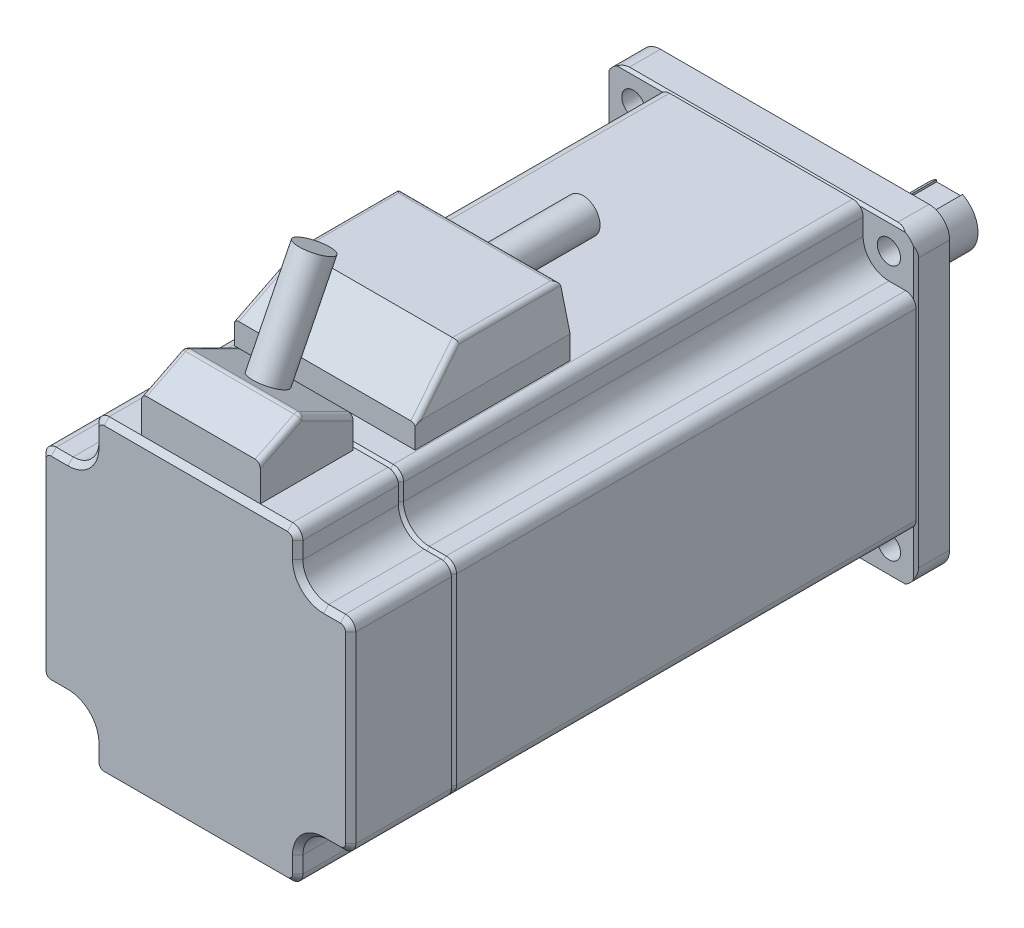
ISO-10303-21;
HEADER;
FILE_DESCRIPTION(('STEP AP214'),'2;1');
FILE_NAME('part.step','',(''),(''),'','','');
FILE_SCHEMA(('AUTOMOTIVE_DESIGN { 1 0 10303 214 1 1 1 1 }'));
ENDSEC;
DATA;
#1=APPLICATION_CONTEXT('core data for automotive mechanical design processes');
#2=APPLICATION_PROTOCOL_DEFINITION('international standard','automotive_design',2000,#1);
#3=PRODUCT_CONTEXT('',#1,'mechanical');
#4=PRODUCT('Part','Part','',(#3));
#5=PRODUCT_RELATED_PRODUCT_CATEGORY('part','',(#4));
#6=PRODUCT_DEFINITION_FORMATION('','',#4);
#7=PRODUCT_DEFINITION_CONTEXT('part definition',#1,'design');
#8=PRODUCT_DEFINITION('design','',#6,#7);
#9=PRODUCT_DEFINITION_SHAPE('','',#8);
#10=(LENGTH_UNIT() NAMED_UNIT(*) SI_UNIT(.MILLI.,.METRE.));
#11=(NAMED_UNIT(*) PLANE_ANGLE_UNIT() SI_UNIT($,.RADIAN.));
#12=(NAMED_UNIT(*) SI_UNIT($,.STERADIAN.) SOLID_ANGLE_UNIT());
#13=UNCERTAINTY_MEASURE_WITH_UNIT(LENGTH_MEASURE(1.E-05),#10,'distance_accuracy_value','');
#14=(GEOMETRIC_REPRESENTATION_CONTEXT(3) GLOBAL_UNCERTAINTY_ASSIGNED_CONTEXT((#13)) GLOBAL_UNIT_ASSIGNED_CONTEXT((#10,
#11,#12)) REPRESENTATION_CONTEXT('',''));
#15=CARTESIAN_POINT('',(0.,0.,0.));
#16=DIRECTION('',(0.,0.,1.));
#17=DIRECTION('',(1.,0.,0.));
#18=AXIS2_PLACEMENT_3D('',#15,#16,#17);
#19=CARTESIAN_POINT('',(-17.5,42.5,54.5));
#20=DIRECTION('',(0.,0.,1.));
#21=DIRECTION('',(1.,0.,0.));
#22=AXIS2_PLACEMENT_3D('',#19,#20,#21);
#23=PLANE('',#22);
#24=DIRECTION('',(0.24253562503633,0.970142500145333,0.));
#25=VECTOR('',#24,1.);
#26=CARTESIAN_POINT('',(-15.5,42.5,54.5));
#27=LINE('',#26,#25);
#28=CARTESIAN_POINT('',(-17.5,34.5,54.5));
#29=VERTEX_POINT('',#28);
#30=CARTESIAN_POINT('',(-15.75,41.5,54.5));
#31=VERTEX_POINT('',#30);
#32=EDGE_CURVE('E1512',#29,#31,#27,.T.);
#33=ORIENTED_EDGE('',*,*,#32,.T.);
#34=DIRECTION('',(-1.,0.,0.));
#35=VECTOR('',#34,1.);
#36=CARTESIAN_POINT('',(15.5,41.5,54.5));
#37=LINE('',#36,#35);
#38=CARTESIAN_POINT('',(15.75,41.5,54.5));
#39=VERTEX_POINT('',#38);
#40=EDGE_CURVE('E1584',#31,#39,#37,.F.);
#41=ORIENTED_EDGE('',*,*,#40,.T.);
#42=DIRECTION('',(0.24253562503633,-0.970142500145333,0.));
#43=VECTOR('',#42,1.);
#44=CARTESIAN_POINT('',(15.5,42.5,54.5));
#45=LINE('',#44,#43);
#46=CARTESIAN_POINT('',(17.5,34.5,54.5));
#47=VERTEX_POINT('',#46);
#48=EDGE_CURVE('E1505',#39,#47,#45,.T.);
#49=ORIENTED_EDGE('',*,*,#48,.T.);
#50=DIRECTION('',(0.,-1.,0.));
#51=VECTOR('',#50,1.);
#52=CARTESIAN_POINT('',(17.5,42.5,54.5));
#53=LINE('',#52,#51);
#54=CARTESIAN_POINT('',(17.5,30.,54.5));
#55=VERTEX_POINT('',#54);
#56=EDGE_CURVE('E2242',#47,#55,#53,.T.);
#57=ORIENTED_EDGE('',*,*,#56,.T.);
#58=DIRECTION('',(-1.,0.,0.));
#59=VECTOR('',#58,1.);
#60=CARTESIAN_POINT('',(-17.5,30.,54.5));
#61=LINE('',#60,#59);
#62=CARTESIAN_POINT('',(-17.5,30.,54.5));
#63=VERTEX_POINT('',#62);
#64=EDGE_CURVE('E3657',#55,#63,#61,.T.);
#65=ORIENTED_EDGE('',*,*,#64,.T.);
#66=DIRECTION('',(0.,-1.,0.));
#67=VECTOR('',#66,1.);
#68=CARTESIAN_POINT('',(-17.5,42.5,54.5));
#69=LINE('',#68,#67);
#70=EDGE_CURVE('E2232',#29,#63,#69,.T.);
#71=ORIENTED_EDGE('',*,*,#70,.F.);
#72=EDGE_LOOP('',(#33,#41,#49,#57,#65,#71));
#73=FACE_BOUND('',#72,.T.);
#74=CARTESIAN_POINT('',(0.,35.6511489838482,54.5));
#75=DIRECTION('',(0.,0.,1.));
#76=DIRECTION('',(1.,0.,0.));
#77=AXIS2_PLACEMENT_3D('',#74,#75,#76);
#78=CIRCLE('',#77,3.3);
#79=CARTESIAN_POINT('',(3.3,35.6511489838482,54.5));
#80=VERTEX_POINT('',#79);
#81=EDGE_CURVE('E30',#80,#80,#78,.F.);
#82=ORIENTED_EDGE('',*,*,#81,.F.);
#83=EDGE_LOOP('',(#82));
#84=FACE_BOUND('',#83,.T.);
#85=ADVANCED_FACE('F16',(#73,#84),#23,.F.);
#86=CARTESIAN_POINT('',(11.5,41.,100.5));
#87=DIRECTION('',(0.,0.894427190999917,-0.447213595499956));
#88=DIRECTION('',(0.,0.447213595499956,0.894427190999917));
#89=AXIS2_PLACEMENT_3D('',#86,#87,#88);
#90=PLANE('',#89);
#91=DIRECTION('',(1.,0.,0.));
#92=VECTOR('',#91,1.);
#93=CARTESIAN_POINT('',(11.5,36.,90.5));
#94=LINE('',#93,#92);
#95=CARTESIAN_POINT('',(-10.5,36.,90.5));
#96=VERTEX_POINT('',#95);
#97=CARTESIAN_POINT('',(10.5,36.,90.5));
#98=VERTEX_POINT('',#97);
#99=EDGE_CURVE('E1518',#96,#98,#94,.T.);
#100=ORIENTED_EDGE('',*,*,#99,.F.);
#101=DIRECTION('',(0.,-0.447213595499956,-0.894427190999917));
#102=VECTOR('',#101,1.);
#103=CARTESIAN_POINT('',(-10.5,41.,100.5));
#104=LINE('',#103,#102);
#105=CARTESIAN_POINT('',(-10.5,40.77639320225,100.0527864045));
#106=VERTEX_POINT('',#105);
#107=EDGE_CURVE('E1571',#96,#106,#104,.F.);
#108=ORIENTED_EDGE('',*,*,#107,.T.);
#109=DIRECTION('',(1.,0.,0.));
#110=VECTOR('',#109,1.);
#111=CARTESIAN_POINT('',(11.5,40.77639320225,100.0527864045));
#112=LINE('',#111,#110);
#113=CARTESIAN_POINT('',(10.5,40.77639320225,100.0527864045));
#114=VERTEX_POINT('',#113);
#115=EDGE_CURVE('E1569',#106,#114,#112,.T.);
#116=ORIENTED_EDGE('',*,*,#115,.T.);
#117=DIRECTION('',(0.,0.447213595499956,0.894427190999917));
#118=VECTOR('',#117,1.);
#119=CARTESIAN_POINT('',(10.5,36.,90.5));
#120=LINE('',#119,#118);
#121=EDGE_CURVE('E1567',#114,#98,#120,.F.);
#122=ORIENTED_EDGE('',*,*,#121,.T.);
#123=EDGE_LOOP('',(#100,#108,#116,#122));
#124=FACE_BOUND('',#123,.T.);
#125=CARTESIAN_POINT('',(0.,38.5029445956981,95.5058891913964));
#126=DIRECTION('',(0.,0.894427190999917,-0.447213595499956));
#127=DIRECTION('',(0.,0.447213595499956,0.894427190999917));
#128=AXIS2_PLACEMENT_3D('',#125,#126,#127);
#129=CIRCLE('',#128,3.3);
#130=CARTESIAN_POINT('',(0.,39.978749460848,98.4574989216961));
#131=VERTEX_POINT('',#130);
#132=EDGE_CURVE('E3678',#131,#131,#129,.T.);
#133=ORIENTED_EDGE('',*,*,#132,.F.);
#134=EDGE_LOOP('',(#133));
#135=FACE_BOUND('',#134,.T.);
#136=ADVANCED_FACE('F1622',(#124,#135),#90,.T.);
#137=CARTESIAN_POINT('',(-17.7487373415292,30.,109.5));
#138=DIRECTION('',(0.,-1.,0.));
#139=DIRECTION('',(0.,0.,-1.));
#140=AXIS2_PLACEMENT_3D('',#137,#138,#139);
#141=PLANE('',#140);
#142=DIRECTION('',(0.,0.,-1.));
#143=VECTOR('',#142,1.);
#144=CARTESIAN_POINT('',(11.5,30.,90.5));
#145=LINE('',#144,#143);
#146=CARTESIAN_POINT('',(11.5,30.,108.5));
#147=VERTEX_POINT('',#146);
#148=CARTESIAN_POINT('',(11.5,30.,90.5));
#149=VERTEX_POINT('',#148);
#150=EDGE_CURVE('E1599',#147,#149,#145,.T.);
#151=ORIENTED_EDGE('',*,*,#150,.F.);
#152=DIRECTION('',(1.,0.,0.));
#153=VECTOR('',#152,1.);
#154=CARTESIAN_POINT('',(17.7487373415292,30.,108.5));
#155=LINE('',#154,#153);
#156=CARTESIAN_POINT('',(17.7487373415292,30.,108.5));
#157=VERTEX_POINT('',#156);
#158=EDGE_CURVE('E1313',#147,#157,#155,.T.);
#159=ORIENTED_EDGE('',*,*,#158,.T.);
#160=DIRECTION('',(0.,0.,-1.));
#161=VECTOR('',#160,1.);
#162=CARTESIAN_POINT('',(17.7487373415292,30.,109.5));
#163=LINE('',#162,#161);
#164=CARTESIAN_POINT('',(17.7487373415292,30.,90.));
#165=VERTEX_POINT('',#164);
#166=EDGE_CURVE('E834',#157,#165,#163,.T.);
#167=ORIENTED_EDGE('',*,*,#166,.T.);
#168=DIRECTION('',(-1.,0.,0.));
#169=VECTOR('',#168,1.);
#170=CARTESIAN_POINT('',(-17.7487373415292,30.,90.));
#171=LINE('',#170,#169);
#172=CARTESIAN_POINT('',(-17.7487373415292,30.,90.));
#173=VERTEX_POINT('',#172);
#174=EDGE_CURVE('E829',#165,#173,#171,.T.);
#175=ORIENTED_EDGE('',*,*,#174,.T.);
#176=DIRECTION('',(0.,0.,-1.));
#177=VECTOR('',#176,1.);
#178=CARTESIAN_POINT('',(-17.7487373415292,30.,109.5));
#179=LINE('',#178,#177);
#180=CARTESIAN_POINT('',(-17.7487373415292,30.,108.5));
#181=VERTEX_POINT('',#180);
#182=EDGE_CURVE('E832',#181,#173,#179,.T.);
#183=ORIENTED_EDGE('',*,*,#182,.F.);
#184=CARTESIAN_POINT('',(-11.5,30.,108.5));
#185=VERTEX_POINT('',#184);
#186=EDGE_CURVE('E1314',#181,#185,#155,.T.);
#187=ORIENTED_EDGE('',*,*,#186,.T.);
#188=DIRECTION('',(0.,0.,1.));
#189=VECTOR('',#188,1.);
#190=CARTESIAN_POINT('',(-11.5,30.,90.5));
#191=LINE('',#190,#189);
#192=CARTESIAN_POINT('',(-11.5,30.,90.5));
#193=VERTEX_POINT('',#192);
#194=EDGE_CURVE('E3643',#193,#185,#191,.T.);
#195=ORIENTED_EDGE('',*,*,#194,.F.);
#196=DIRECTION('',(-1.,0.,0.));
#197=VECTOR('',#196,1.);
#198=CARTESIAN_POINT('',(-11.5,30.,90.5));
#199=LINE('',#198,#197);
#200=EDGE_CURVE('E3668',#149,#193,#199,.T.);
#201=ORIENTED_EDGE('',*,*,#200,.F.);
#202=EDGE_LOOP('',(#151,#159,#167,#175,#183,#187,#195,#201));
#203=FACE_BOUND('',#202,.T.);
#204=ADVANCED_FACE('F1630',(#203),#141,.F.);
#205=CARTESIAN_POINT('',(30.,30.,90.));
#206=DIRECTION('',(0.,-1.,0.));
#207=DIRECTION('',(0.,0.,-1.));
#208=AXIS2_PLACEMENT_3D('',#205,#206,#207);
#209=PLANE('',#208);
#210=DIRECTION('',(0.,0.,1.));
#211=VECTOR('',#210,1.);
#212=CARTESIAN_POINT('',(-17.7487373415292,30.,90.));
#213=LINE('',#212,#211);
#214=CARTESIAN_POINT('',(-17.7487373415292,30.,0.));
#215=VERTEX_POINT('',#214);
#216=CARTESIAN_POINT('',(-17.7487373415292,30.,89.));
#217=VERTEX_POINT('',#216);
#218=EDGE_CURVE('E1024',#215,#217,#213,.T.);
#219=ORIENTED_EDGE('',*,*,#218,.T.);
#220=DIRECTION('',(1.,0.,0.));
#221=VECTOR('',#220,1.);
#222=CARTESIAN_POINT('',(30.,30.,89.));
#223=LINE('',#222,#221);
#224=CARTESIAN_POINT('',(17.7487373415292,30.,89.));
#225=VERTEX_POINT('',#224);
#226=EDGE_CURVE('E1165',#217,#225,#223,.T.);
#227=ORIENTED_EDGE('',*,*,#226,.T.);
#228=DIRECTION('',(0.,0.,1.));
#229=VECTOR('',#228,1.);
#230=CARTESIAN_POINT('',(17.7487373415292,30.,90.));
#231=LINE('',#230,#229);
#232=CARTESIAN_POINT('',(17.7487373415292,30.,0.));
#233=VERTEX_POINT('',#232);
#234=EDGE_CURVE('E1022',#225,#233,#231,.F.);
#235=ORIENTED_EDGE('',*,*,#234,.T.);
#236=DIRECTION('',(-1.,0.,0.));
#237=VECTOR('',#236,1.);
#238=CARTESIAN_POINT('',(30.,30.,0.));
#239=LINE('',#238,#237);
#240=EDGE_CURVE('E953',#233,#215,#239,.T.);
#241=ORIENTED_EDGE('',*,*,#240,.T.);
#242=EDGE_LOOP('',(#219,#227,#235,#241));
#243=FACE_BOUND('',#242,.T.);
#244=DIRECTION('',(0.,0.,-1.));
#245=VECTOR('',#244,1.);
#246=CARTESIAN_POINT('',(17.5,30.,54.5));
#247=LINE('',#246,#245);
#248=CARTESIAN_POINT('',(17.5,30.,84.5));
#249=VERTEX_POINT('',#248);
#250=EDGE_CURVE('E2244',#249,#55,#247,.T.);
#251=ORIENTED_EDGE('',*,*,#250,.F.);
#252=DIRECTION('',(1.,0.,0.));
#253=VECTOR('',#252,1.);
#254=CARTESIAN_POINT('',(-17.5,30.,84.5));
#255=LINE('',#254,#253);
#256=CARTESIAN_POINT('',(-17.5,30.,84.5));
#257=VERTEX_POINT('',#256);
#258=EDGE_CURVE('E2202',#257,#249,#255,.T.);
#259=ORIENTED_EDGE('',*,*,#258,.F.);
#260=DIRECTION('',(0.,0.,1.));
#261=VECTOR('',#260,1.);
#262=CARTESIAN_POINT('',(-17.5,30.,54.5));
#263=LINE('',#262,#261);
#264=EDGE_CURVE('E3659',#63,#257,#263,.T.);
#265=ORIENTED_EDGE('',*,*,#264,.F.);
#266=ORIENTED_EDGE('',*,*,#64,.F.);
#267=EDGE_LOOP('',(#251,#259,#265,#266));
#268=FACE_BOUND('',#267,.T.);
#269=ADVANCED_FACE('F1678',(#243,#268),#209,.F.);
#270=CARTESIAN_POINT('',(0.,0.,-9.5));
#271=DIRECTION('',(0.,0.,-1.));
#272=DIRECTION('',(-1.,0.,0.));
#273=AXIS2_PLACEMENT_3D('',#270,#271,#272);
#274=PLANE('',#273);
#275=CARTESIAN_POINT('',(0.,0.,-9.5));
#276=DIRECTION('',(0.,0.,-1.));
#277=DIRECTION('',(-1.,0.,0.));
#278=AXIS2_PLACEMENT_3D('',#275,#276,#277);
#279=CIRCLE('',#278,25.);
#280=CARTESIAN_POINT('',(-25.,0.,-9.5));
#281=VERTEX_POINT('',#280);
#282=EDGE_CURVE('E754',#281,#281,#279,.T.);
#283=ORIENTED_EDGE('',*,*,#282,.T.);
#284=EDGE_LOOP('',(#283));
#285=FACE_BOUND('',#284,.T.);
#286=CARTESIAN_POINT('',(0.,0.,-9.5));
#287=DIRECTION('',(0.,0.,-1.));
#288=DIRECTION('',(-1.,0.,0.));
#289=AXIS2_PLACEMENT_3D('',#286,#287,#288);
#290=CIRCLE('',#289,5.5);
#291=CARTESIAN_POINT('',(-5.5,0.,-9.5));
#292=VERTEX_POINT('',#291);
#293=EDGE_CURVE('E738',#292,#292,#290,.F.);
#294=ORIENTED_EDGE('',*,*,#293,.T.);
#295=EDGE_LOOP('',(#294));
#296=FACE_BOUND('',#295,.T.);
#297=ADVANCED_FACE('F1674',(#285,#296),#274,.T.);
#298=CARTESIAN_POINT('',(-30.,30.,-6.5));
#299=DIRECTION('',(0.,0.,1.));
#300=DIRECTION('',(1.,0.,0.));
#301=AXIS2_PLACEMENT_3D('',#298,#299,#300);
#302=PLANE('',#301);
#303=CARTESIAN_POINT('',(-24.7487373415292,-24.7487373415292,-6.5));
#304=DIRECTION('',(0.,0.,1.));
#305=DIRECTION('',(1.,0.,0.));
#306=AXIS2_PLACEMENT_3D('',#303,#304,#305);
#307=CIRCLE('',#306,2.25);
#308=CARTESIAN_POINT('',(-22.4987373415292,-24.7487373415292,-6.5));
#309=VERTEX_POINT('',#308);
#310=EDGE_CURVE('E2248',#309,#309,#307,.T.);
#311=ORIENTED_EDGE('',*,*,#310,.T.);
#312=EDGE_LOOP('',(#311));
#313=FACE_BOUND('',#312,.T.);
#314=CARTESIAN_POINT('',(24.7487373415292,-24.7487373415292,-6.5));
#315=DIRECTION('',(0.,0.,1.));
#316=DIRECTION('',(1.,0.,0.));
#317=AXIS2_PLACEMENT_3D('',#314,#315,#316);
#318=CIRCLE('',#317,2.25);
#319=CARTESIAN_POINT('',(26.9987373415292,-24.7487373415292,-6.5));
#320=VERTEX_POINT('',#319);
#321=EDGE_CURVE('E2258',#320,#320,#318,.T.);
#322=ORIENTED_EDGE('',*,*,#321,.T.);
#323=EDGE_LOOP('',(#322));
#324=FACE_BOUND('',#323,.T.);
#325=CARTESIAN_POINT('',(24.7487373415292,24.7487373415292,-6.5));
#326=DIRECTION('',(0.,0.,1.));
#327=DIRECTION('',(1.,0.,0.));
#328=AXIS2_PLACEMENT_3D('',#325,#326,#327);
#329=CIRCLE('',#328,2.25);
#330=CARTESIAN_POINT('',(26.9987373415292,24.7487373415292,-6.5));
#331=VERTEX_POINT('',#330);
#332=EDGE_CURVE('E2264',#331,#331,#329,.T.);
#333=ORIENTED_EDGE('',*,*,#332,.T.);
#334=EDGE_LOOP('',(#333));
#335=FACE_BOUND('',#334,.T.);
#336=CARTESIAN_POINT('',(-24.7487373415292,24.7487373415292,-6.5));
#337=DIRECTION('',(0.,0.,1.));
#338=DIRECTION('',(1.,0.,0.));
#339=AXIS2_PLACEMENT_3D('',#336,#337,#338);
#340=CIRCLE('',#339,2.25);
#341=CARTESIAN_POINT('',(-22.4987373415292,24.7487373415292,-6.5));
#342=VERTEX_POINT('',#341);
#343=EDGE_CURVE('E1447',#342,#342,#340,.T.);
#344=ORIENTED_EDGE('',*,*,#343,.T.);
#345=EDGE_LOOP('',(#344));
#346=FACE_BOUND('',#345,.T.);
#347=DIRECTION('',(1.,0.,0.));
#348=VECTOR('',#347,1.);
#349=CARTESIAN_POINT('',(-30.,-30.,-6.5));
#350=LINE('',#349,#348);
#351=CARTESIAN_POINT('',(-26.,-30.,-6.5));
#352=VERTEX_POINT('',#351);
#353=CARTESIAN_POINT('',(26.,-30.,-6.5));
#354=VERTEX_POINT('',#353);
#355=EDGE_CURVE('E959',#352,#354,#350,.T.);
#356=ORIENTED_EDGE('',*,*,#355,.F.);
#357=CARTESIAN_POINT('',(-26.,-26.,-6.5));
#358=DIRECTION('',(0.,0.,1.));
#359=DIRECTION('',(1.,0.,0.));
#360=AXIS2_PLACEMENT_3D('',#357,#358,#359);
#361=CIRCLE('',#360,4.);
#362=CARTESIAN_POINT('',(-30.,-26.,-6.5));
#363=VERTEX_POINT('',#362);
#364=EDGE_CURVE('E1473',#352,#363,#361,.F.);
#365=ORIENTED_EDGE('',*,*,#364,.T.);
#366=DIRECTION('',(0.,-1.,0.));
#367=VECTOR('',#366,1.);
#368=CARTESIAN_POINT('',(-30.,30.,-6.5));
#369=LINE('',#368,#367);
#370=CARTESIAN_POINT('',(-30.,26.,-6.5));
#371=VERTEX_POINT('',#370);
#372=EDGE_CURVE('E956',#371,#363,#369,.T.);
#373=ORIENTED_EDGE('',*,*,#372,.F.);
#374=CARTESIAN_POINT('',(-26.,26.,-6.5));
#375=DIRECTION('',(0.,0.,1.));
#376=DIRECTION('',(1.,0.,0.));
#377=AXIS2_PLACEMENT_3D('',#374,#375,#376);
#378=CIRCLE('',#377,4.);
#379=CARTESIAN_POINT('',(-26.,30.,-6.5));
#380=VERTEX_POINT('',#379);
#381=EDGE_CURVE('E1467',#371,#380,#378,.F.);
#382=ORIENTED_EDGE('',*,*,#381,.T.);
#383=DIRECTION('',(-1.,0.,0.));
#384=VECTOR('',#383,1.);
#385=CARTESIAN_POINT('',(-30.,30.,-6.5));
#386=LINE('',#385,#384);
#387=CARTESIAN_POINT('',(26.,30.,-6.5));
#388=VERTEX_POINT('',#387);
#389=EDGE_CURVE('E965',#388,#380,#386,.T.);
#390=ORIENTED_EDGE('',*,*,#389,.F.);
#391=CARTESIAN_POINT('',(26.,26.,-6.5));
#392=DIRECTION('',(0.,0.,1.));
#393=DIRECTION('',(1.,0.,0.));
#394=AXIS2_PLACEMENT_3D('',#391,#392,#393);
#395=CIRCLE('',#394,4.);
#396=CARTESIAN_POINT('',(30.,26.,-6.5));
#397=VERTEX_POINT('',#396);
#398=EDGE_CURVE('E1469',#388,#397,#395,.F.);
#399=ORIENTED_EDGE('',*,*,#398,.T.);
#400=DIRECTION('',(0.,1.,0.));
#401=VECTOR('',#400,1.);
#402=CARTESIAN_POINT('',(30.,30.,-6.5));
#403=LINE('',#402,#401);
#404=CARTESIAN_POINT('',(30.,-26.,-6.5));
#405=VERTEX_POINT('',#404);
#406=EDGE_CURVE('E962',#405,#397,#403,.T.);
#407=ORIENTED_EDGE('',*,*,#406,.F.);
#408=CARTESIAN_POINT('',(26.,-26.,-6.5));
#409=DIRECTION('',(0.,0.,1.));
#410=DIRECTION('',(1.,0.,0.));
#411=AXIS2_PLACEMENT_3D('',#408,#409,#410);
#412=CIRCLE('',#411,4.);
#413=EDGE_CURVE('E1471',#405,#354,#412,.F.);
#414=ORIENTED_EDGE('',*,*,#413,.T.);
#415=EDGE_LOOP('',(#356,#365,#373,#382,#390,#399,#407,#414));
#416=FACE_BOUND('',#415,.T.);
#417=CARTESIAN_POINT('',(0.,0.,-6.5));
#418=DIRECTION('',(0.,0.,1.));
#419=DIRECTION('',(1.,0.,0.));
#420=AXIS2_PLACEMENT_3D('',#417,#418,#419);
#421=CIRCLE('',#420,25.);
#422=CARTESIAN_POINT('',(25.,0.,-6.5));
#423=VERTEX_POINT('',#422);
#424=EDGE_CURVE('E1363',#423,#423,#421,.F.);
#425=ORIENTED_EDGE('',*,*,#424,.F.);
#426=EDGE_LOOP('',(#425));
#427=FACE_BOUND('',#426,.T.);
#428=ADVANCED_FACE('F1677',(#313,#324,#335,#346,#416,#427),#302,.F.);
#429=CARTESIAN_POINT('',(-30.,30.,0.));
#430=DIRECTION('',(0.,0.,-1.));
#431=DIRECTION('',(-1.,0.,0.));
#432=AXIS2_PLACEMENT_3D('',#429,#430,#431);
#433=PLANE('',#432);
#434=DIRECTION('',(-1.,0.,0.));
#435=VECTOR('',#434,1.);
#436=CARTESIAN_POINT('',(-30.,29.5,0.));
#437=LINE('',#436,#435);
#438=CARTESIAN_POINT('',(19.0716129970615,29.5,0.));
#439=VERTEX_POINT('',#438);
#440=CARTESIAN_POINT('',(-19.0716129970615,29.5,0.));
#441=VERTEX_POINT('',#440);
#442=EDGE_CURVE('E968',#439,#441,#437,.T.);
#443=ORIENTED_EDGE('',*,*,#442,.T.);
#444=CARTESIAN_POINT('',(-17.7487373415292,28.,0.));
#445=DIRECTION('',(0.,0.,-1.));
#446=DIRECTION('',(-1.,0.,0.));
#447=AXIS2_PLACEMENT_3D('',#444,#445,#446);
#448=CIRCLE('',#447,2.);
#449=EDGE_CURVE('E1032',#441,#215,#448,.T.);
#450=ORIENTED_EDGE('',*,*,#449,.T.);
#451=ORIENTED_EDGE('',*,*,#240,.F.);
#452=CARTESIAN_POINT('',(17.7487373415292,28.,0.));
#453=DIRECTION('',(0.,0.,-1.));
#454=DIRECTION('',(-1.,0.,0.));
#455=AXIS2_PLACEMENT_3D('',#452,#453,#454);
#456=CIRCLE('',#455,2.);
#457=EDGE_CURVE('E1029',#233,#439,#456,.T.);
#458=ORIENTED_EDGE('',*,*,#457,.T.);
#459=EDGE_LOOP('',(#443,#450,#451,#458));
#460=FACE_BOUND('',#459,.T.);
#461=ADVANCED_FACE('F1859',(#460),#433,.T.);
#462=DIRECTION('',(0.,-1.,0.));
#463=VECTOR('',#462,1.);
#464=CARTESIAN_POINT('',(-29.5,30.,0.));
#465=LINE('',#464,#463);
#466=CARTESIAN_POINT('',(-29.5,19.0716129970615,0.));
#467=VERTEX_POINT('',#466);
#468=CARTESIAN_POINT('',(-29.5,-19.0716129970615,0.));
#469=VERTEX_POINT('',#468);
#470=EDGE_CURVE('E978',#467,#469,#465,.T.);
#471=ORIENTED_EDGE('',*,*,#470,.T.);
#472=CARTESIAN_POINT('',(-28.,-17.7487373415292,0.));
#473=DIRECTION('',(0.,0.,-1.));
#474=DIRECTION('',(-1.,0.,0.));
#475=AXIS2_PLACEMENT_3D('',#472,#473,#474);
#476=CIRCLE('',#475,2.);
#477=CARTESIAN_POINT('',(-30.,-17.7487373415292,0.));
#478=VERTEX_POINT('',#477);
#479=EDGE_CURVE('E1017',#469,#478,#476,.T.);
#480=ORIENTED_EDGE('',*,*,#479,.T.);
#481=DIRECTION('',(0.,-1.,0.));
#482=VECTOR('',#481,1.);
#483=CARTESIAN_POINT('',(-30.,30.,0.));
#484=LINE('',#483,#482);
#485=CARTESIAN_POINT('',(-30.,17.7487373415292,0.));
#486=VERTEX_POINT('',#485);
#487=EDGE_CURVE('E944',#486,#478,#484,.T.);
#488=ORIENTED_EDGE('',*,*,#487,.F.);
#489=CARTESIAN_POINT('',(-28.,17.7487373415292,0.));
#490=DIRECTION('',(0.,0.,-1.));
#491=DIRECTION('',(-1.,0.,0.));
#492=AXIS2_PLACEMENT_3D('',#489,#490,#491);
#493=CIRCLE('',#492,2.);
#494=EDGE_CURVE('E1014',#486,#467,#493,.T.);
#495=ORIENTED_EDGE('',*,*,#494,.T.);
#496=EDGE_LOOP('',(#471,#480,#488,#495));
#497=FACE_BOUND('',#496,.T.);
#498=ADVANCED_FACE('F2434',(#497),#433,.T.);
#499=DIRECTION('',(1.,0.,0.));
#500=VECTOR('',#499,1.);
#501=CARTESIAN_POINT('',(-30.,-30.,0.));
#502=LINE('',#501,#500);
#503=CARTESIAN_POINT('',(-17.7487373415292,-30.,0.));
#504=VERTEX_POINT('',#503);
#505=CARTESIAN_POINT('',(17.7487373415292,-30.,0.));
#506=VERTEX_POINT('',#505);
#507=EDGE_CURVE('E947',#504,#506,#502,.T.);
#508=ORIENTED_EDGE('',*,*,#507,.F.);
#509=CARTESIAN_POINT('',(-17.7487373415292,-28.,0.));
#510=DIRECTION('',(0.,0.,-1.));
#511=DIRECTION('',(-1.,0.,0.));
#512=AXIS2_PLACEMENT_3D('',#509,#510,#511);
#513=CIRCLE('',#512,2.);
#514=CARTESIAN_POINT('',(-19.0716129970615,-29.5,0.));
#515=VERTEX_POINT('',#514);
#516=EDGE_CURVE('E1004',#504,#515,#513,.T.);
#517=ORIENTED_EDGE('',*,*,#516,.T.);
#518=DIRECTION('',(1.,0.,0.));
#519=VECTOR('',#518,1.);
#520=CARTESIAN_POINT('',(-30.,-29.5,0.));
#521=LINE('',#520,#519);
#522=CARTESIAN_POINT('',(19.0716129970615,-29.5,0.));
#523=VERTEX_POINT('',#522);
#524=EDGE_CURVE('E979',#515,#523,#521,.T.);
#525=ORIENTED_EDGE('',*,*,#524,.T.);
#526=CARTESIAN_POINT('',(17.7487373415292,-28.,0.));
#527=DIRECTION('',(0.,0.,-1.));
#528=DIRECTION('',(-1.,0.,0.));
#529=AXIS2_PLACEMENT_3D('',#526,#527,#528);
#530=CIRCLE('',#529,2.);
#531=EDGE_CURVE('E1002',#523,#506,#530,.T.);
#532=ORIENTED_EDGE('',*,*,#531,.T.);
#533=EDGE_LOOP('',(#508,#517,#525,#532));
#534=FACE_BOUND('',#533,.T.);
#535=ADVANCED_FACE('F1860',(#534),#433,.T.);
#536=CARTESIAN_POINT('',(-30.,30.,-6.5));
#537=DIRECTION('',(-1.,0.,0.));
#538=DIRECTION('',(0.,-1.,0.));
#539=AXIS2_PLACEMENT_3D('',#536,#537,#538);
#540=PLANE('',#539);
#541=ORIENTED_EDGE('',*,*,#372,.T.);
#542=DIRECTION('',(0.,0.,1.));
#543=VECTOR('',#542,1.);
#544=CARTESIAN_POINT('',(-30.,-26.,-6.5));
#545=LINE('',#544,#543);
#546=CARTESIAN_POINT('',(-30.,-26.,-0.5));
#547=VERTEX_POINT('',#546);
#548=EDGE_CURVE('E1449',#363,#547,#545,.T.);
#549=ORIENTED_EDGE('',*,*,#548,.T.);
#550=DIRECTION('',(0.,1.,0.));
#551=VECTOR('',#550,1.);
#552=CARTESIAN_POINT('',(-30.,30.,-0.5));
#553=LINE('',#552,#551);
#554=CARTESIAN_POINT('',(-30.,26.,-0.5));
#555=VERTEX_POINT('',#554);
#556=EDGE_CURVE('E982',#547,#555,#553,.T.);
#557=ORIENTED_EDGE('',*,*,#556,.T.);
#558=DIRECTION('',(0.,0.,1.));
#559=VECTOR('',#558,1.);
#560=CARTESIAN_POINT('',(-30.,26.,-6.5));
#561=LINE('',#560,#559);
#562=EDGE_CURVE('E1444',#555,#371,#561,.F.);
#563=ORIENTED_EDGE('',*,*,#562,.T.);
#564=EDGE_LOOP('',(#541,#549,#557,#563));
#565=FACE_BOUND('',#564,.T.);
#566=ADVANCED_FACE('F1883',(#565),#540,.T.);
#567=CARTESIAN_POINT('',(-30.,30.,-6.5));
#568=DIRECTION('',(0.,1.,0.));
#569=DIRECTION('',(0.,0.,1.));
#570=AXIS2_PLACEMENT_3D('',#567,#568,#569);
#571=PLANE('',#570);
#572=DIRECTION('',(1.,0.,0.));
#573=VECTOR('',#572,1.);
#574=CARTESIAN_POINT('',(-30.,30.,-0.5));
#575=LINE('',#574,#573);
#576=CARTESIAN_POINT('',(-26.,30.,-0.5));
#577=VERTEX_POINT('',#576);
#578=CARTESIAN_POINT('',(26.,30.,-0.5));
#579=VERTEX_POINT('',#578);
#580=EDGE_CURVE('E991',#577,#579,#575,.T.);
#581=ORIENTED_EDGE('',*,*,#580,.T.);
#582=DIRECTION('',(0.,0.,1.));
#583=VECTOR('',#582,1.);
#584=CARTESIAN_POINT('',(26.,30.,-6.5));
#585=LINE('',#584,#583);
#586=EDGE_CURVE('E1495',#579,#388,#585,.F.);
#587=ORIENTED_EDGE('',*,*,#586,.T.);
#588=ORIENTED_EDGE('',*,*,#389,.T.);
#589=DIRECTION('',(0.,0.,1.));
#590=VECTOR('',#589,1.);
#591=CARTESIAN_POINT('',(-26.,30.,-6.5));
#592=LINE('',#591,#590);
#593=EDGE_CURVE('E1492',#380,#577,#592,.T.);
#594=ORIENTED_EDGE('',*,*,#593,.T.);
#595=EDGE_LOOP('',(#581,#587,#588,#594));
#596=FACE_BOUND('',#595,.T.);
#597=ADVANCED_FACE('F1879',(#596),#571,.T.);
#598=CARTESIAN_POINT('',(30.,30.,-6.5));
#599=DIRECTION('',(1.,0.,0.));
#600=DIRECTION('',(0.,1.,0.));
#601=AXIS2_PLACEMENT_3D('',#598,#599,#600);
#602=PLANE('',#601);
#603=DIRECTION('',(0.,-1.,0.));
#604=VECTOR('',#603,1.);
#605=CARTESIAN_POINT('',(30.,30.,-0.5));
#606=LINE('',#605,#604);
#607=CARTESIAN_POINT('',(30.,26.,-0.5));
#608=VERTEX_POINT('',#607);
#609=CARTESIAN_POINT('',(30.,-26.,-0.5));
#610=VERTEX_POINT('',#609);
#611=EDGE_CURVE('E988',#608,#610,#606,.T.);
#612=ORIENTED_EDGE('',*,*,#611,.T.);
#613=DIRECTION('',(0.,0.,1.));
#614=VECTOR('',#613,1.);
#615=CARTESIAN_POINT('',(30.,-26.,-6.5));
#616=LINE('',#615,#614);
#617=EDGE_CURVE('E1484',#610,#405,#616,.F.);
#618=ORIENTED_EDGE('',*,*,#617,.T.);
#619=ORIENTED_EDGE('',*,*,#406,.T.);
#620=DIRECTION('',(0.,0.,1.));
#621=VECTOR('',#620,1.);
#622=CARTESIAN_POINT('',(30.,26.,-6.5));
#623=LINE('',#622,#621);
#624=EDGE_CURVE('E1481',#397,#608,#623,.T.);
#625=ORIENTED_EDGE('',*,*,#624,.T.);
#626=EDGE_LOOP('',(#612,#618,#619,#625));
#627=FACE_BOUND('',#626,.T.);
#628=ADVANCED_FACE('F1882',(#627),#602,.T.);
#629=CARTESIAN_POINT('',(-30.,-30.,-6.5));
#630=DIRECTION('',(0.,-1.,0.));
#631=DIRECTION('',(1.,0.,0.));
#632=AXIS2_PLACEMENT_3D('',#629,#630,#631);
#633=PLANE('',#632);
#634=DIRECTION('',(-1.,0.,0.));
#635=VECTOR('',#634,1.);
#636=CARTESIAN_POINT('',(-30.,-30.,-0.5));
#637=LINE('',#636,#635);
#638=CARTESIAN_POINT('',(26.,-30.,-0.5));
#639=VERTEX_POINT('',#638);
#640=CARTESIAN_POINT('',(-26.,-30.,-0.5));
#641=VERTEX_POINT('',#640);
#642=EDGE_CURVE('E985',#639,#641,#637,.T.);
#643=ORIENTED_EDGE('',*,*,#642,.T.);
#644=DIRECTION('',(0.,0.,1.));
#645=VECTOR('',#644,1.);
#646=CARTESIAN_POINT('',(-26.,-30.,-6.5));
#647=LINE('',#646,#645);
#648=EDGE_CURVE('E1465',#641,#352,#647,.F.);
#649=ORIENTED_EDGE('',*,*,#648,.T.);
#650=ORIENTED_EDGE('',*,*,#355,.T.);
#651=DIRECTION('',(0.,0.,1.));
#652=VECTOR('',#651,1.);
#653=CARTESIAN_POINT('',(26.,-30.,-6.5));
#654=LINE('',#653,#652);
#655=EDGE_CURVE('E1462',#354,#639,#654,.T.);
#656=ORIENTED_EDGE('',*,*,#655,.T.);
#657=EDGE_LOOP('',(#643,#649,#650,#656));
#658=FACE_BOUND('',#657,.T.);
#659=ADVANCED_FACE('F1887',(#658),#633,.T.);
#660=CARTESIAN_POINT('',(29.5,30.,0.));
#661=DIRECTION('',(-0.707106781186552,0.,-0.707106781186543));
#662=DIRECTION('',(-0.707106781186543,0.,0.707106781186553));
#663=AXIS2_PLACEMENT_3D('',#660,#661,#662);
#664=PLANE('',#663);
#665=DIRECTION('',(0.,1.,0.));
#666=VECTOR('',#665,1.);
#667=CARTESIAN_POINT('',(29.5,30.,0.));
#668=LINE('',#667,#666);
#669=CARTESIAN_POINT('',(29.5,-27.9364916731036,0.));
#670=VERTEX_POINT('',#669);
#671=CARTESIAN_POINT('',(29.5,-19.0716129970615,0.));
#672=VERTEX_POINT('',#671);
#673=EDGE_CURVE('E972',#670,#672,#668,.T.);
#674=ORIENTED_EDGE('',*,*,#673,.F.);
#675=CARTESIAN_POINT('',(26.,-26.,3.50000000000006));
#676=DIRECTION('',(-0.707106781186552,0.,-0.707106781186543));
#677=DIRECTION('',(-0.707106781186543,0.,0.707106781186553));
#678=AXIS2_PLACEMENT_3D('',#675,#676,#677);
#679=ELLIPSE('',#678,5.65685424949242,4.);
#680=EDGE_CURVE('E1479',#670,#610,#679,.F.);
#681=ORIENTED_EDGE('',*,*,#680,.T.);
#682=ORIENTED_EDGE('',*,*,#611,.F.);
#683=CARTESIAN_POINT('',(26.,26.,3.50000000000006));
#684=DIRECTION('',(-0.707106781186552,0.,-0.707106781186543));
#685=DIRECTION('',(-0.707106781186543,0.,0.707106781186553));
#686=AXIS2_PLACEMENT_3D('',#683,#684,#685);
#687=ELLIPSE('',#686,5.65685424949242,4.);
#688=CARTESIAN_POINT('',(29.5,27.9364916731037,0.));
#689=VERTEX_POINT('',#688);
#690=EDGE_CURVE('E1477',#608,#689,#687,.F.);
#691=ORIENTED_EDGE('',*,*,#690,.T.);
#692=CARTESIAN_POINT('',(29.5,19.0716129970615,0.));
#693=VERTEX_POINT('',#692);
#694=EDGE_CURVE('E971',#693,#689,#668,.T.);
#695=ORIENTED_EDGE('',*,*,#694,.F.);
#696=EDGE_CURVE('E975',#672,#693,#668,.T.);
#697=ORIENTED_EDGE('',*,*,#696,.F.);
#698=EDGE_LOOP('',(#674,#681,#682,#691,#695,#697));
#699=FACE_BOUND('',#698,.T.);
#700=ADVANCED_FACE('F1891',(#699),#664,.F.);
#701=CARTESIAN_POINT('',(-30.,29.5,0.));
#702=DIRECTION('',(0.,-0.707106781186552,-0.707106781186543));
#703=DIRECTION('',(0.,0.707106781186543,-0.707106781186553));
#704=AXIS2_PLACEMENT_3D('',#701,#702,#703);
#705=PLANE('',#704);
#706=CARTESIAN_POINT('',(27.9364916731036,29.5,0.));
#707=VERTEX_POINT('',#706);
#708=EDGE_CURVE('E969',#707,#439,#437,.T.);
#709=ORIENTED_EDGE('',*,*,#708,.F.);
#710=CARTESIAN_POINT('',(26.,26.,3.50000000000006));
#711=DIRECTION('',(0.,-0.707106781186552,-0.707106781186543));
#712=DIRECTION('',(0.,-0.707106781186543,0.707106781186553));
#713=AXIS2_PLACEMENT_3D('',#710,#711,#712);
#714=ELLIPSE('',#713,5.65685424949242,4.);
#715=EDGE_CURVE('E1490',#707,#579,#714,.F.);
#716=ORIENTED_EDGE('',*,*,#715,.T.);
#717=ORIENTED_EDGE('',*,*,#580,.F.);
#718=CARTESIAN_POINT('',(-26.,26.,3.50000000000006));
#719=DIRECTION('',(0.,-0.707106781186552,-0.707106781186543));
#720=DIRECTION('',(0.,-0.707106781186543,0.707106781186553));
#721=AXIS2_PLACEMENT_3D('',#718,#719,#720);
#722=ELLIPSE('',#721,5.65685424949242,4.);
#723=CARTESIAN_POINT('',(-27.9364916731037,29.5,0.));
#724=VERTEX_POINT('',#723);
#725=EDGE_CURVE('E1488',#577,#724,#722,.F.);
#726=ORIENTED_EDGE('',*,*,#725,.T.);
#727=DIRECTION('',(1.,0.,0.));
#728=VECTOR('',#727,1.);
#729=CARTESIAN_POINT('',(-30.,29.5,0.));
#730=LINE('',#729,#728);
#731=EDGE_CURVE('E896',#441,#724,#730,.F.);
#732=ORIENTED_EDGE('',*,*,#731,.F.);
#733=ORIENTED_EDGE('',*,*,#442,.F.);
#734=EDGE_LOOP('',(#709,#716,#717,#726,#732,#733));
#735=FACE_BOUND('',#734,.T.);
#736=ADVANCED_FACE('F1902',(#735),#705,.F.);
#737=CARTESIAN_POINT('',(-30.,-29.5,0.));
#738=DIRECTION('',(0.,0.707106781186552,-0.707106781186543));
#739=DIRECTION('',(0.,0.707106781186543,0.707106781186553));
#740=AXIS2_PLACEMENT_3D('',#737,#738,#739);
#741=PLANE('',#740);
#742=CARTESIAN_POINT('',(-27.9364916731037,-29.5,0.));
#743=VERTEX_POINT('',#742);
#744=EDGE_CURVE('E976',#743,#515,#521,.T.);
#745=ORIENTED_EDGE('',*,*,#744,.F.);
#746=CARTESIAN_POINT('',(-26.,-26.,3.50000000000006));
#747=DIRECTION('',(0.,0.707106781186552,-0.707106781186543));
#748=DIRECTION('',(0.,0.707106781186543,0.707106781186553));
#749=AXIS2_PLACEMENT_3D('',#746,#747,#748);
#750=ELLIPSE('',#749,5.65685424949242,4.);
#751=EDGE_CURVE('E1460',#743,#641,#750,.F.);
#752=ORIENTED_EDGE('',*,*,#751,.T.);
#753=ORIENTED_EDGE('',*,*,#642,.F.);
#754=CARTESIAN_POINT('',(26.,-26.,3.50000000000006));
#755=DIRECTION('',(0.,0.707106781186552,-0.707106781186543));
#756=DIRECTION('',(0.,0.707106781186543,0.707106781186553));
#757=AXIS2_PLACEMENT_3D('',#754,#755,#756);
#758=ELLIPSE('',#757,5.65685424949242,4.);
#759=CARTESIAN_POINT('',(27.9364916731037,-29.5,0.));
#760=VERTEX_POINT('',#759);
#761=EDGE_CURVE('E1458',#639,#760,#758,.F.);
#762=ORIENTED_EDGE('',*,*,#761,.T.);
#763=EDGE_CURVE('E974',#523,#760,#521,.T.);
#764=ORIENTED_EDGE('',*,*,#763,.F.);
#765=ORIENTED_EDGE('',*,*,#524,.F.);
#766=EDGE_LOOP('',(#745,#752,#753,#762,#764,#765));
#767=FACE_BOUND('',#766,.T.);
#768=ADVANCED_FACE('F1898',(#767),#741,.F.);
#769=CARTESIAN_POINT('',(-29.5,30.,0.));
#770=DIRECTION('',(0.707106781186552,0.,-0.707106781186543));
#771=DIRECTION('',(-0.707106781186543,0.,-0.707106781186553));
#772=AXIS2_PLACEMENT_3D('',#769,#770,#771);
#773=PLANE('',#772);
#774=ORIENTED_EDGE('',*,*,#556,.F.);
#775=CARTESIAN_POINT('',(-26.,-26.,3.50000000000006));
#776=DIRECTION('',(0.707106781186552,0.,-0.707106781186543));
#777=DIRECTION('',(0.707106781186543,0.,0.707106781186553));
#778=AXIS2_PLACEMENT_3D('',#775,#776,#777);
#779=ELLIPSE('',#778,5.65685424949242,4.);
#780=CARTESIAN_POINT('',(-29.5,-27.9364916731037,0.));
#781=VERTEX_POINT('',#780);
#782=EDGE_CURVE('E1454',#547,#781,#779,.F.);
#783=ORIENTED_EDGE('',*,*,#782,.T.);
#784=DIRECTION('',(0.,1.,0.));
#785=VECTOR('',#784,1.);
#786=CARTESIAN_POINT('',(-29.5,30.,0.));
#787=LINE('',#786,#785);
#788=EDGE_CURVE('E913',#469,#781,#787,.F.);
#789=ORIENTED_EDGE('',*,*,#788,.F.);
#790=ORIENTED_EDGE('',*,*,#470,.F.);
#791=CARTESIAN_POINT('',(-29.5,27.9364916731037,0.));
#792=VERTEX_POINT('',#791);
#793=EDGE_CURVE('E980',#792,#467,#465,.T.);
#794=ORIENTED_EDGE('',*,*,#793,.F.);
#795=CARTESIAN_POINT('',(-26.,26.,3.50000000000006));
#796=DIRECTION('',(0.707106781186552,0.,-0.707106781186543));
#797=DIRECTION('',(0.707106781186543,0.,0.707106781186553));
#798=AXIS2_PLACEMENT_3D('',#795,#796,#797);
#799=ELLIPSE('',#798,5.65685424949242,4.);
#800=EDGE_CURVE('E1452',#792,#555,#799,.F.);
#801=ORIENTED_EDGE('',*,*,#800,.T.);
#802=EDGE_LOOP('',(#774,#783,#789,#790,#794,#801));
#803=FACE_BOUND('',#802,.T.);
#804=ADVANCED_FACE('F1874',(#803),#773,.F.);
#805=CARTESIAN_POINT('',(-30.,30.,90.));
#806=DIRECTION('',(1.,0.,0.));
#807=DIRECTION('',(0.,1.,0.));
#808=AXIS2_PLACEMENT_3D('',#805,#806,#807);
#809=PLANE('',#808);
#810=DIRECTION('',(0.,0.,1.));
#811=VECTOR('',#810,1.);
#812=CARTESIAN_POINT('',(-30.,-17.7487373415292,90.));
#813=LINE('',#812,#811);
#814=CARTESIAN_POINT('',(-30.,-17.7487373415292,89.));
#815=VERTEX_POINT('',#814);
#816=EDGE_CURVE('E1009',#478,#815,#813,.T.);
#817=ORIENTED_EDGE('',*,*,#816,.T.);
#818=DIRECTION('',(0.,1.,0.));
#819=VECTOR('',#818,1.);
#820=CARTESIAN_POINT('',(-30.,30.,89.));
#821=LINE('',#820,#819);
#822=CARTESIAN_POINT('',(-30.,17.7487373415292,89.));
#823=VERTEX_POINT('',#822);
#824=EDGE_CURVE('E1153',#815,#823,#821,.T.);
#825=ORIENTED_EDGE('',*,*,#824,.T.);
#826=DIRECTION('',(0.,0.,1.));
#827=VECTOR('',#826,1.);
#828=CARTESIAN_POINT('',(-30.,17.7487373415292,90.));
#829=LINE('',#828,#827);
#830=EDGE_CURVE('E1007',#823,#486,#829,.F.);
#831=ORIENTED_EDGE('',*,*,#830,.T.);
#832=ORIENTED_EDGE('',*,*,#487,.T.);
#833=EDGE_LOOP('',(#817,#825,#831,#832));
#834=FACE_BOUND('',#833,.T.);
#835=ADVANCED_FACE('F1870',(#834),#809,.F.);
#836=CARTESIAN_POINT('',(-30.,-30.,90.));
#837=DIRECTION('',(0.,1.,0.));
#838=DIRECTION('',(-1.,0.,0.));
#839=AXIS2_PLACEMENT_3D('',#836,#837,#838);
#840=PLANE('',#839);
#841=DIRECTION('',(0.,0.,1.));
#842=VECTOR('',#841,1.);
#843=CARTESIAN_POINT('',(17.7487373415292,-30.,90.));
#844=LINE('',#843,#842);
#845=CARTESIAN_POINT('',(17.7487373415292,-30.,89.));
#846=VERTEX_POINT('',#845);
#847=EDGE_CURVE('E997',#506,#846,#844,.T.);
#848=ORIENTED_EDGE('',*,*,#847,.T.);
#849=DIRECTION('',(-1.,0.,0.));
#850=VECTOR('',#849,1.);
#851=CARTESIAN_POINT('',(-30.,-30.,89.));
#852=LINE('',#851,#850);
#853=CARTESIAN_POINT('',(-17.7487373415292,-30.,89.));
#854=VERTEX_POINT('',#853);
#855=EDGE_CURVE('E1189',#846,#854,#852,.T.);
#856=ORIENTED_EDGE('',*,*,#855,.T.);
#857=DIRECTION('',(0.,0.,1.));
#858=VECTOR('',#857,1.);
#859=CARTESIAN_POINT('',(-17.7487373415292,-30.,90.));
#860=LINE('',#859,#858);
#861=EDGE_CURVE('E1000',#854,#504,#860,.F.);
#862=ORIENTED_EDGE('',*,*,#861,.T.);
#863=ORIENTED_EDGE('',*,*,#507,.T.);
#864=EDGE_LOOP('',(#848,#856,#862,#863));
#865=FACE_BOUND('',#864,.T.);
#866=ADVANCED_FACE('F1866',(#865),#840,.F.);
#867=CARTESIAN_POINT('',(30.,-30.,90.));
#868=DIRECTION('',(-1.,0.,0.));
#869=DIRECTION('',(0.,-1.,0.));
#870=AXIS2_PLACEMENT_3D('',#867,#868,#869);
#871=PLANE('',#870);
#872=DIRECTION('',(0.,0.,1.));
#873=VECTOR('',#872,1.);
#874=CARTESIAN_POINT('',(30.,17.7487373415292,90.));
#875=LINE('',#874,#873);
#876=CARTESIAN_POINT('',(30.,17.7487373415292,0.));
#877=VERTEX_POINT('',#876);
#878=CARTESIAN_POINT('',(30.,17.7487373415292,89.));
#879=VERTEX_POINT('',#878);
#880=EDGE_CURVE('E1039',#877,#879,#875,.T.);
#881=ORIENTED_EDGE('',*,*,#880,.T.);
#882=DIRECTION('',(0.,-1.,0.));
#883=VECTOR('',#882,1.);
#884=CARTESIAN_POINT('',(30.,-30.,89.));
#885=LINE('',#884,#883);
#886=CARTESIAN_POINT('',(30.,-17.7487373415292,89.));
#887=VERTEX_POINT('',#886);
#888=EDGE_CURVE('E1177',#879,#887,#885,.T.);
#889=ORIENTED_EDGE('',*,*,#888,.T.);
#890=DIRECTION('',(0.,0.,1.));
#891=VECTOR('',#890,1.);
#892=CARTESIAN_POINT('',(30.,-17.7487373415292,90.));
#893=LINE('',#892,#891);
#894=CARTESIAN_POINT('',(30.,-17.7487373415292,0.));
#895=VERTEX_POINT('',#894);
#896=EDGE_CURVE('E1042',#887,#895,#893,.F.);
#897=ORIENTED_EDGE('',*,*,#896,.T.);
#898=DIRECTION('',(0.,1.,0.));
#899=VECTOR('',#898,1.);
#900=CARTESIAN_POINT('',(30.,-30.,0.));
#901=LINE('',#900,#899);
#902=EDGE_CURVE('E950',#895,#877,#901,.T.);
#903=ORIENTED_EDGE('',*,*,#902,.T.);
#904=EDGE_LOOP('',(#881,#889,#897,#903));
#905=FACE_BOUND('',#904,.T.);
#906=ADVANCED_FACE('F1857',(#905),#871,.F.);
#907=ORIENTED_EDGE('',*,*,#902,.F.);
#908=CARTESIAN_POINT('',(28.,-17.7487373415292,0.));
#909=DIRECTION('',(0.,0.,-1.));
#910=DIRECTION('',(-1.,0.,0.));
#911=AXIS2_PLACEMENT_3D('',#908,#909,#910);
#912=CIRCLE('',#911,2.);
#913=EDGE_CURVE('E1046',#895,#672,#912,.T.);
#914=ORIENTED_EDGE('',*,*,#913,.T.);
#915=ORIENTED_EDGE('',*,*,#696,.T.);
#916=CARTESIAN_POINT('',(28.,17.7487373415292,0.));
#917=DIRECTION('',(0.,0.,-1.));
#918=DIRECTION('',(-1.,0.,0.));
#919=AXIS2_PLACEMENT_3D('',#916,#917,#918);
#920=CIRCLE('',#919,2.);
#921=EDGE_CURVE('E1044',#693,#877,#920,.T.);
#922=ORIENTED_EDGE('',*,*,#921,.T.);
#923=EDGE_LOOP('',(#907,#914,#915,#922));
#924=FACE_BOUND('',#923,.T.);
#925=ADVANCED_FACE('F1853',(#924),#433,.T.);
#926=CARTESIAN_POINT('',(-30.,30.,0.));
#927=DIRECTION('',(0.,0.,-1.));
#928=DIRECTION('',(-1.,0.,0.));
#929=AXIS2_PLACEMENT_3D('',#926,#927,#928);
#930=PLANE('',#929);
#931=CARTESIAN_POINT('',(24.7487373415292,24.7487373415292,0.));
#932=DIRECTION('',(0.,0.,1.));
#933=DIRECTION('',(1.,0.,0.));
#934=AXIS2_PLACEMENT_3D('',#931,#932,#933);
#935=CIRCLE('',#934,2.25);
#936=CARTESIAN_POINT('',(26.9987373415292,24.7487373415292,0.));
#937=VERTEX_POINT('',#936);
#938=EDGE_CURVE('E2261',#937,#937,#935,.T.);
#939=ORIENTED_EDGE('',*,*,#938,.F.);
#940=EDGE_LOOP('',(#939));
#941=FACE_BOUND('',#940,.T.);
#942=ORIENTED_EDGE('',*,*,#694,.T.);
#943=CARTESIAN_POINT('',(26.,26.,0.));
#944=DIRECTION('',(0.,0.,-1.));
#945=DIRECTION('',(-1.,0.,0.));
#946=AXIS2_PLACEMENT_3D('',#943,#944,#945);
#947=CIRCLE('',#946,4.);
#948=EDGE_CURVE('E1486',#689,#707,#947,.F.);
#949=ORIENTED_EDGE('',*,*,#948,.T.);
#950=ORIENTED_EDGE('',*,*,#708,.T.);
#951=CARTESIAN_POINT('',(17.7487373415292,28.,0.));
#952=DIRECTION('',(0.,0.,-1.));
#953=DIRECTION('',(-1.,0.,0.));
#954=AXIS2_PLACEMENT_3D('',#951,#952,#953);
#955=CIRCLE('',#954,2.);
#956=CARTESIAN_POINT('',(19.7487373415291,28.,0.));
#957=VERTEX_POINT('',#956);
#958=EDGE_CURVE('E1072',#439,#957,#955,.T.);
#959=ORIENTED_EDGE('',*,*,#958,.T.);
#960=DIRECTION('',(0.,-1.,0.));
#961=VECTOR('',#960,1.);
#962=CARTESIAN_POINT('',(19.7487373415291,24.7487373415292,0.));
#963=LINE('',#962,#961);
#964=CARTESIAN_POINT('',(19.7487373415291,24.7487373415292,0.));
#965=VERTEX_POINT('',#964);
#966=EDGE_CURVE('E933',#957,#965,#963,.T.);
#967=ORIENTED_EDGE('',*,*,#966,.T.);
#968=CARTESIAN_POINT('',(24.7487373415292,24.7487373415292,0.));
#969=DIRECTION('',(0.,0.,-1.));
#970=DIRECTION('',(-1.,0.,0.));
#971=AXIS2_PLACEMENT_3D('',#968,#969,#970);
#972=CIRCLE('',#971,5.);
#973=CARTESIAN_POINT('',(24.7487373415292,19.7487373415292,0.));
#974=VERTEX_POINT('',#973);
#975=EDGE_CURVE('E934',#965,#974,#972,.F.);
#976=ORIENTED_EDGE('',*,*,#975,.T.);
#977=DIRECTION('',(1.,0.,0.));
#978=VECTOR('',#977,1.);
#979=CARTESIAN_POINT('',(24.7487373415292,19.7487373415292,0.));
#980=LINE('',#979,#978);
#981=CARTESIAN_POINT('',(28.,19.7487373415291,0.));
#982=VERTEX_POINT('',#981);
#983=EDGE_CURVE('E930',#974,#982,#980,.T.);
#984=ORIENTED_EDGE('',*,*,#983,.T.);
#985=CARTESIAN_POINT('',(28.,17.7487373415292,0.));
#986=DIRECTION('',(0.,0.,-1.));
#987=DIRECTION('',(-1.,0.,0.));
#988=AXIS2_PLACEMENT_3D('',#985,#986,#987);
#989=CIRCLE('',#988,2.);
#990=EDGE_CURVE('E1069',#982,#693,#989,.T.);
#991=ORIENTED_EDGE('',*,*,#990,.T.);
#992=EDGE_LOOP('',(#942,#949,#950,#959,#967,#976,#984,#991));
#993=FACE_BOUND('',#992,.T.);
#994=ADVANCED_FACE('F1849',(#941,#993),#930,.F.);
#995=CARTESIAN_POINT('',(24.7487373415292,19.7487373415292,-14.4974746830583));
#996=DIRECTION('',(0.,-1.,0.));
#997=DIRECTION('',(1.,0.,0.));
#998=AXIS2_PLACEMENT_3D('',#995,#996,#997);
#999=PLANE('',#998);
#1000=DIRECTION('',(0.,0.,1.));
#1001=VECTOR('',#1000,1.);
#1002=CARTESIAN_POINT('',(24.7487373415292,19.7487373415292,-14.4974746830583));
#1003=LINE('',#1002,#1001);
#1004=CARTESIAN_POINT('',(24.7487373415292,19.7487373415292,89.));
#1005=VERTEX_POINT('',#1004);
#1006=EDGE_CURVE('E937',#974,#1005,#1003,.T.);
#1007=ORIENTED_EDGE('',*,*,#1006,.T.);
#1008=DIRECTION('',(1.,0.,0.));
#1009=VECTOR('',#1008,1.);
#1010=CARTESIAN_POINT('',(24.7487373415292,19.7487373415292,89.));
#1011=LINE('',#1010,#1009);
#1012=CARTESIAN_POINT('',(28.,19.7487373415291,89.));
#1013=VERTEX_POINT('',#1012);
#1014=EDGE_CURVE('E1173',#1005,#1013,#1011,.T.);
#1015=ORIENTED_EDGE('',*,*,#1014,.T.);
#1016=DIRECTION('',(0.,0.,1.));
#1017=VECTOR('',#1016,1.);
#1018=CARTESIAN_POINT('',(28.,19.7487373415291,-14.4974746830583));
#1019=LINE('',#1018,#1017);
#1020=EDGE_CURVE('E1049',#1013,#982,#1019,.F.);
#1021=ORIENTED_EDGE('',*,*,#1020,.T.);
#1022=ORIENTED_EDGE('',*,*,#983,.F.);
#1023=EDGE_LOOP('',(#1007,#1015,#1021,#1022));
#1024=FACE_BOUND('',#1023,.T.);
#1025=ADVANCED_FACE('F1845',(#1024),#999,.F.);
#1026=CARTESIAN_POINT('',(19.7487373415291,24.7487373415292,-14.4974746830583));
#1027=DIRECTION('',(-1.,0.,0.));
#1028=DIRECTION('',(0.,0.,1.));
#1029=AXIS2_PLACEMENT_3D('',#1026,#1027,#1028);
#1030=PLANE('',#1029);
#1031=DIRECTION('',(0.,0.,1.));
#1032=VECTOR('',#1031,1.);
#1033=CARTESIAN_POINT('',(19.7487373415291,28.,-14.4974746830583));
#1034=LINE('',#1033,#1032);
#1035=CARTESIAN_POINT('',(19.7487373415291,28.,89.));
#1036=VERTEX_POINT('',#1035);
#1037=EDGE_CURVE('E1051',#957,#1036,#1034,.T.);
#1038=ORIENTED_EDGE('',*,*,#1037,.T.);
#1039=DIRECTION('',(0.,-1.,0.));
#1040=VECTOR('',#1039,1.);
#1041=CARTESIAN_POINT('',(19.7487373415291,24.7487373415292,89.));
#1042=LINE('',#1041,#1040);
#1043=CARTESIAN_POINT('',(19.7487373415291,24.7487373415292,89.));
#1044=VERTEX_POINT('',#1043);
#1045=EDGE_CURVE('E1169',#1036,#1044,#1042,.T.);
#1046=ORIENTED_EDGE('',*,*,#1045,.T.);
#1047=DIRECTION('',(0.,0.,1.));
#1048=VECTOR('',#1047,1.);
#1049=CARTESIAN_POINT('',(19.7487373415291,24.7487373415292,-14.4974746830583));
#1050=LINE('',#1049,#1048);
#1051=EDGE_CURVE('E938',#965,#1044,#1050,.T.);
#1052=ORIENTED_EDGE('',*,*,#1051,.F.);
#1053=ORIENTED_EDGE('',*,*,#966,.F.);
#1054=EDGE_LOOP('',(#1038,#1046,#1052,#1053));
#1055=FACE_BOUND('',#1054,.T.);
#1056=ADVANCED_FACE('F1841',(#1055),#1030,.F.);
#1057=CARTESIAN_POINT('',(24.7487373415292,24.7487373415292,-14.4974746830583));
#1058=DIRECTION('',(0.,0.,1.));
#1059=DIRECTION('',(1.,0.,0.));
#1060=AXIS2_PLACEMENT_3D('',#1057,#1058,#1059);
#1061=CYLINDRICAL_SURFACE('',#1060,5.);
#1062=ORIENTED_EDGE('',*,*,#1051,.T.);
#1063=CARTESIAN_POINT('',(24.7487373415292,24.7487373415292,89.));
#1064=DIRECTION('',(0.,0.,-1.));
#1065=DIRECTION('',(-1.,0.,0.));
#1066=AXIS2_PLACEMENT_3D('',#1063,#1064,#1065);
#1067=CIRCLE('',#1066,5.);
#1068=EDGE_CURVE('E1171',#1044,#1005,#1067,.F.);
#1069=ORIENTED_EDGE('',*,*,#1068,.T.);
#1070=ORIENTED_EDGE('',*,*,#1006,.F.);
#1071=ORIENTED_EDGE('',*,*,#975,.F.);
#1072=EDGE_LOOP('',(#1062,#1069,#1070,#1071));
#1073=FACE_BOUND('',#1072,.T.);
#1074=ADVANCED_FACE('F1837',(#1073),#1061,.F.);
#1075=CARTESIAN_POINT('',(-30.,30.,0.));
#1076=DIRECTION('',(0.,0.,-1.));
#1077=DIRECTION('',(-1.,0.,0.));
#1078=AXIS2_PLACEMENT_3D('',#1075,#1076,#1077);
#1079=PLANE('',#1078);
#1080=CARTESIAN_POINT('',(24.7487373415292,-24.7487373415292,0.));
#1081=DIRECTION('',(0.,0.,1.));
#1082=DIRECTION('',(1.,0.,0.));
#1083=AXIS2_PLACEMENT_3D('',#1080,#1081,#1082);
#1084=CIRCLE('',#1083,2.25);
#1085=CARTESIAN_POINT('',(26.9987373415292,-24.7487373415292,0.));
#1086=VERTEX_POINT('',#1085);
#1087=EDGE_CURVE('E2255',#1086,#1086,#1084,.T.);
#1088=ORIENTED_EDGE('',*,*,#1087,.F.);
#1089=EDGE_LOOP('',(#1088));
#1090=FACE_BOUND('',#1089,.T.);
#1091=ORIENTED_EDGE('',*,*,#763,.T.);
#1092=CARTESIAN_POINT('',(26.,-26.,0.));
#1093=DIRECTION('',(0.,0.,-1.));
#1094=DIRECTION('',(-1.,0.,0.));
#1095=AXIS2_PLACEMENT_3D('',#1092,#1093,#1094);
#1096=CIRCLE('',#1095,4.);
#1097=EDGE_CURVE('E1475',#760,#670,#1096,.F.);
#1098=ORIENTED_EDGE('',*,*,#1097,.T.);
#1099=ORIENTED_EDGE('',*,*,#673,.T.);
#1100=CARTESIAN_POINT('',(28.,-17.7487373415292,0.));
#1101=DIRECTION('',(0.,0.,-1.));
#1102=DIRECTION('',(-1.,0.,0.));
#1103=AXIS2_PLACEMENT_3D('',#1100,#1101,#1102);
#1104=CIRCLE('',#1103,2.);
#1105=CARTESIAN_POINT('',(28.,-19.7487373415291,0.));
#1106=VERTEX_POINT('',#1105);
#1107=EDGE_CURVE('E1067',#672,#1106,#1104,.T.);
#1108=ORIENTED_EDGE('',*,*,#1107,.T.);
#1109=DIRECTION('',(-1.,0.,0.));
#1110=VECTOR('',#1109,1.);
#1111=CARTESIAN_POINT('',(24.7487373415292,-19.7487373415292,0.));
#1112=LINE('',#1111,#1110);
#1113=CARTESIAN_POINT('',(24.7487373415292,-19.7487373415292,0.));
#1114=VERTEX_POINT('',#1113);
#1115=EDGE_CURVE('E919',#1106,#1114,#1112,.T.);
#1116=ORIENTED_EDGE('',*,*,#1115,.T.);
#1117=CARTESIAN_POINT('',(24.7487373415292,-24.7487373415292,0.));
#1118=DIRECTION('',(0.,0.,-1.));
#1119=DIRECTION('',(-1.,0.,0.));
#1120=AXIS2_PLACEMENT_3D('',#1117,#1118,#1119);
#1121=CIRCLE('',#1120,5.);
#1122=CARTESIAN_POINT('',(19.7487373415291,-24.7487373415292,0.));
#1123=VERTEX_POINT('',#1122);
#1124=EDGE_CURVE('E920',#1114,#1123,#1121,.F.);
#1125=ORIENTED_EDGE('',*,*,#1124,.T.);
#1126=DIRECTION('',(0.,-1.,0.));
#1127=VECTOR('',#1126,1.);
#1128=CARTESIAN_POINT('',(19.7487373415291,-24.7487373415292,0.));
#1129=LINE('',#1128,#1127);
#1130=CARTESIAN_POINT('',(19.7487373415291,-28.,0.));
#1131=VERTEX_POINT('',#1130);
#1132=EDGE_CURVE('E916',#1123,#1131,#1129,.T.);
#1133=ORIENTED_EDGE('',*,*,#1132,.T.);
#1134=CARTESIAN_POINT('',(17.7487373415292,-28.,0.));
#1135=DIRECTION('',(0.,0.,-1.));
#1136=DIRECTION('',(-1.,0.,0.));
#1137=AXIS2_PLACEMENT_3D('',#1134,#1135,#1136);
#1138=CIRCLE('',#1137,2.);
#1139=EDGE_CURVE('E1064',#1131,#523,#1138,.T.);
#1140=ORIENTED_EDGE('',*,*,#1139,.T.);
#1141=EDGE_LOOP('',(#1091,#1098,#1099,#1108,#1116,#1125,#1133,#1140));
#1142=FACE_BOUND('',#1141,.T.);
#1143=ADVANCED_FACE('F1833',(#1090,#1142),#1079,.F.);
#1144=CARTESIAN_POINT('',(19.7487373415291,-24.7487373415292,-14.4974746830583));
#1145=DIRECTION('',(-1.,0.,0.));
#1146=DIRECTION('',(0.,0.,1.));
#1147=AXIS2_PLACEMENT_3D('',#1144,#1145,#1146);
#1148=PLANE('',#1147);
#1149=DIRECTION('',(0.,0.,1.));
#1150=VECTOR('',#1149,1.);
#1151=CARTESIAN_POINT('',(19.7487373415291,-24.7487373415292,-14.4974746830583));
#1152=LINE('',#1151,#1150);
#1153=CARTESIAN_POINT('',(19.7487373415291,-24.7487373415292,89.));
#1154=VERTEX_POINT('',#1153);
#1155=EDGE_CURVE('E923',#1123,#1154,#1152,.T.);
#1156=ORIENTED_EDGE('',*,*,#1155,.T.);
#1157=DIRECTION('',(0.,-1.,0.));
#1158=VECTOR('',#1157,1.);
#1159=CARTESIAN_POINT('',(19.7487373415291,-24.7487373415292,89.));
#1160=LINE('',#1159,#1158);
#1161=CARTESIAN_POINT('',(19.7487373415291,-28.,89.));
#1162=VERTEX_POINT('',#1161);
#1163=EDGE_CURVE('E1185',#1154,#1162,#1160,.T.);
#1164=ORIENTED_EDGE('',*,*,#1163,.T.);
#1165=DIRECTION('',(0.,0.,1.));
#1166=VECTOR('',#1165,1.);
#1167=CARTESIAN_POINT('',(19.7487373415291,-28.,-14.4974746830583));
#1168=LINE('',#1167,#1166);
#1169=EDGE_CURVE('E1034',#1162,#1131,#1168,.F.);
#1170=ORIENTED_EDGE('',*,*,#1169,.T.);
#1171=ORIENTED_EDGE('',*,*,#1132,.F.);
#1172=EDGE_LOOP('',(#1156,#1164,#1170,#1171));
#1173=FACE_BOUND('',#1172,.T.);
#1174=ADVANCED_FACE('F1829',(#1173),#1148,.F.);
#1175=CARTESIAN_POINT('',(24.7487373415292,-19.7487373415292,-14.4974746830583));
#1176=DIRECTION('',(0.,1.,0.));
#1177=DIRECTION('',(-1.,0.,0.));
#1178=AXIS2_PLACEMENT_3D('',#1175,#1176,#1177);
#1179=PLANE('',#1178);
#1180=DIRECTION('',(0.,0.,1.));
#1181=VECTOR('',#1180,1.);
#1182=CARTESIAN_POINT('',(28.,-19.7487373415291,-14.4974746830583));
#1183=LINE('',#1182,#1181);
#1184=CARTESIAN_POINT('',(28.,-19.7487373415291,89.));
#1185=VERTEX_POINT('',#1184);
#1186=EDGE_CURVE('E1036',#1106,#1185,#1183,.T.);
#1187=ORIENTED_EDGE('',*,*,#1186,.T.);
#1188=DIRECTION('',(-1.,0.,0.));
#1189=VECTOR('',#1188,1.);
#1190=CARTESIAN_POINT('',(24.7487373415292,-19.7487373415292,89.));
#1191=LINE('',#1190,#1189);
#1192=CARTESIAN_POINT('',(24.7487373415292,-19.7487373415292,89.));
#1193=VERTEX_POINT('',#1192);
#1194=EDGE_CURVE('E1181',#1185,#1193,#1191,.T.);
#1195=ORIENTED_EDGE('',*,*,#1194,.T.);
#1196=DIRECTION('',(0.,0.,1.));
#1197=VECTOR('',#1196,1.);
#1198=CARTESIAN_POINT('',(24.7487373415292,-19.7487373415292,-14.4974746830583));
#1199=LINE('',#1198,#1197);
#1200=EDGE_CURVE('E924',#1114,#1193,#1199,.T.);
#1201=ORIENTED_EDGE('',*,*,#1200,.F.);
#1202=ORIENTED_EDGE('',*,*,#1115,.F.);
#1203=EDGE_LOOP('',(#1187,#1195,#1201,#1202));
#1204=FACE_BOUND('',#1203,.T.);
#1205=ADVANCED_FACE('F1825',(#1204),#1179,.F.);
#1206=CARTESIAN_POINT('',(24.7487373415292,-24.7487373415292,-14.4974746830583));
#1207=DIRECTION('',(0.,0.,1.));
#1208=DIRECTION('',(1.,0.,0.));
#1209=AXIS2_PLACEMENT_3D('',#1206,#1207,#1208);
#1210=CYLINDRICAL_SURFACE('',#1209,5.);
#1211=ORIENTED_EDGE('',*,*,#1200,.T.);
#1212=CARTESIAN_POINT('',(24.7487373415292,-24.7487373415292,89.));
#1213=DIRECTION('',(0.,0.,-1.));
#1214=DIRECTION('',(-1.,0.,0.));
#1215=AXIS2_PLACEMENT_3D('',#1212,#1213,#1214);
#1216=CIRCLE('',#1215,5.);
#1217=EDGE_CURVE('E1183',#1193,#1154,#1216,.F.);
#1218=ORIENTED_EDGE('',*,*,#1217,.T.);
#1219=ORIENTED_EDGE('',*,*,#1155,.F.);
#1220=ORIENTED_EDGE('',*,*,#1124,.F.);
#1221=EDGE_LOOP('',(#1211,#1218,#1219,#1220));
#1222=FACE_BOUND('',#1221,.T.);
#1223=ADVANCED_FACE('F1821',(#1222),#1210,.F.);
#1224=CARTESIAN_POINT('',(-30.,30.,0.));
#1225=DIRECTION('',(0.,0.,-1.));
#1226=DIRECTION('',(-1.,0.,0.));
#1227=AXIS2_PLACEMENT_3D('',#1224,#1225,#1226);
#1228=PLANE('',#1227);
#1229=CARTESIAN_POINT('',(-24.7487373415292,-24.7487373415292,0.));
#1230=DIRECTION('',(0.,0.,1.));
#1231=DIRECTION('',(1.,0.,0.));
#1232=AXIS2_PLACEMENT_3D('',#1229,#1230,#1231);
#1233=CIRCLE('',#1232,2.25);
#1234=CARTESIAN_POINT('',(-22.4987373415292,-24.7487373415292,0.));
#1235=VERTEX_POINT('',#1234);
#1236=EDGE_CURVE('E2245',#1235,#1235,#1233,.T.);
#1237=ORIENTED_EDGE('',*,*,#1236,.F.);
#1238=EDGE_LOOP('',(#1237));
#1239=FACE_BOUND('',#1238,.T.);
#1240=ORIENTED_EDGE('',*,*,#788,.T.);
#1241=CARTESIAN_POINT('',(-26.,-26.,0.));
#1242=DIRECTION('',(0.,0.,-1.));
#1243=DIRECTION('',(-1.,0.,0.));
#1244=AXIS2_PLACEMENT_3D('',#1241,#1242,#1243);
#1245=CIRCLE('',#1244,4.);
#1246=EDGE_CURVE('E1456',#781,#743,#1245,.F.);
#1247=ORIENTED_EDGE('',*,*,#1246,.T.);
#1248=ORIENTED_EDGE('',*,*,#744,.T.);
#1249=CARTESIAN_POINT('',(-17.7487373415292,-28.,0.));
#1250=DIRECTION('',(0.,0.,-1.));
#1251=DIRECTION('',(-1.,0.,0.));
#1252=AXIS2_PLACEMENT_3D('',#1249,#1250,#1251);
#1253=CIRCLE('',#1252,2.);
#1254=CARTESIAN_POINT('',(-19.7487373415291,-28.,0.));
#1255=VERTEX_POINT('',#1254);
#1256=EDGE_CURVE('E1054',#515,#1255,#1253,.T.);
#1257=ORIENTED_EDGE('',*,*,#1256,.T.);
#1258=DIRECTION('',(0.,1.,0.));
#1259=VECTOR('',#1258,1.);
#1260=CARTESIAN_POINT('',(-19.7487373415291,-24.7487373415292,0.));
#1261=LINE('',#1260,#1259);
#1262=CARTESIAN_POINT('',(-19.7487373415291,-24.7487373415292,0.));
#1263=VERTEX_POINT('',#1262);
#1264=EDGE_CURVE('E902',#1255,#1263,#1261,.T.);
#1265=ORIENTED_EDGE('',*,*,#1264,.T.);
#1266=CARTESIAN_POINT('',(-24.7487373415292,-24.7487373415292,0.));
#1267=DIRECTION('',(0.,0.,-1.));
#1268=DIRECTION('',(-1.,0.,0.));
#1269=AXIS2_PLACEMENT_3D('',#1266,#1267,#1268);
#1270=CIRCLE('',#1269,5.);
#1271=CARTESIAN_POINT('',(-24.7487373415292,-19.7487373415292,0.));
#1272=VERTEX_POINT('',#1271);
#1273=EDGE_CURVE('E903',#1263,#1272,#1270,.F.);
#1274=ORIENTED_EDGE('',*,*,#1273,.T.);
#1275=DIRECTION('',(-1.,0.,0.));
#1276=VECTOR('',#1275,1.);
#1277=CARTESIAN_POINT('',(-24.7487373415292,-19.7487373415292,0.));
#1278=LINE('',#1277,#1276);
#1279=CARTESIAN_POINT('',(-28.,-19.7487373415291,0.));
#1280=VERTEX_POINT('',#1279);
#1281=EDGE_CURVE('E899',#1272,#1280,#1278,.T.);
#1282=ORIENTED_EDGE('',*,*,#1281,.T.);
#1283=CARTESIAN_POINT('',(-28.,-17.7487373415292,0.));
#1284=DIRECTION('',(0.,0.,-1.));
#1285=DIRECTION('',(-1.,0.,0.));
#1286=AXIS2_PLACEMENT_3D('',#1283,#1284,#1285);
#1287=CIRCLE('',#1286,2.);
#1288=EDGE_CURVE('E1056',#1280,#469,#1287,.T.);
#1289=ORIENTED_EDGE('',*,*,#1288,.T.);
#1290=EDGE_LOOP('',(#1240,#1247,#1248,#1257,#1265,#1274,#1282,#1289));
#1291=FACE_BOUND('',#1290,.T.);
#1292=ADVANCED_FACE('F1817',(#1239,#1291),#1228,.F.);
#1293=CARTESIAN_POINT('',(-24.7487373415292,-19.7487373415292,-14.4974746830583));
#1294=DIRECTION('',(0.,1.,0.));
#1295=DIRECTION('',(-1.,0.,0.));
#1296=AXIS2_PLACEMENT_3D('',#1293,#1294,#1295);
#1297=PLANE('',#1296);
#1298=DIRECTION('',(0.,0.,1.));
#1299=VECTOR('',#1298,1.);
#1300=CARTESIAN_POINT('',(-24.7487373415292,-19.7487373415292,-14.4974746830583));
#1301=LINE('',#1300,#1299);
#1302=CARTESIAN_POINT('',(-24.7487373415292,-19.7487373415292,89.));
#1303=VERTEX_POINT('',#1302);
#1304=EDGE_CURVE('E906',#1272,#1303,#1301,.T.);
#1305=ORIENTED_EDGE('',*,*,#1304,.T.);
#1306=DIRECTION('',(-1.,0.,0.));
#1307=VECTOR('',#1306,1.);
#1308=CARTESIAN_POINT('',(-24.7487373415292,-19.7487373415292,89.));
#1309=LINE('',#1308,#1307);
#1310=CARTESIAN_POINT('',(-28.,-19.7487373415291,89.));
#1311=VERTEX_POINT('',#1310);
#1312=EDGE_CURVE('E1149',#1303,#1311,#1309,.T.);
#1313=ORIENTED_EDGE('',*,*,#1312,.T.);
#1314=DIRECTION('',(0.,0.,1.));
#1315=VECTOR('',#1314,1.);
#1316=CARTESIAN_POINT('',(-28.,-19.7487373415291,-14.4974746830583));
#1317=LINE('',#1316,#1315);
#1318=EDGE_CURVE('E1012',#1311,#1280,#1317,.F.);
#1319=ORIENTED_EDGE('',*,*,#1318,.T.);
#1320=ORIENTED_EDGE('',*,*,#1281,.F.);
#1321=EDGE_LOOP('',(#1305,#1313,#1319,#1320));
#1322=FACE_BOUND('',#1321,.T.);
#1323=ADVANCED_FACE('F1813',(#1322),#1297,.F.);
#1324=CARTESIAN_POINT('',(-19.7487373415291,-24.7487373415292,-14.4974746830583));
#1325=DIRECTION('',(1.,0.,0.));
#1326=DIRECTION('',(0.,0.,-1.));
#1327=AXIS2_PLACEMENT_3D('',#1324,#1325,#1326);
#1328=PLANE('',#1327);
#1329=DIRECTION('',(0.,0.,1.));
#1330=VECTOR('',#1329,1.);
#1331=CARTESIAN_POINT('',(-19.7487373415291,-28.,-14.4974746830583));
#1332=LINE('',#1331,#1330);
#1333=CARTESIAN_POINT('',(-19.7487373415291,-28.,89.));
#1334=VERTEX_POINT('',#1333);
#1335=EDGE_CURVE('E994',#1255,#1334,#1332,.T.);
#1336=ORIENTED_EDGE('',*,*,#1335,.T.);
#1337=DIRECTION('',(0.,1.,0.));
#1338=VECTOR('',#1337,1.);
#1339=CARTESIAN_POINT('',(-19.7487373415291,-24.7487373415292,89.));
#1340=LINE('',#1339,#1338);
#1341=CARTESIAN_POINT('',(-19.7487373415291,-24.7487373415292,89.));
#1342=VERTEX_POINT('',#1341);
#1343=EDGE_CURVE('E1193',#1334,#1342,#1340,.T.);
#1344=ORIENTED_EDGE('',*,*,#1343,.T.);
#1345=DIRECTION('',(0.,0.,1.));
#1346=VECTOR('',#1345,1.);
#1347=CARTESIAN_POINT('',(-19.7487373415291,-24.7487373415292,-14.4974746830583));
#1348=LINE('',#1347,#1346);
#1349=EDGE_CURVE('E907',#1263,#1342,#1348,.T.);
#1350=ORIENTED_EDGE('',*,*,#1349,.F.);
#1351=ORIENTED_EDGE('',*,*,#1264,.F.);
#1352=EDGE_LOOP('',(#1336,#1344,#1350,#1351));
#1353=FACE_BOUND('',#1352,.T.);
#1354=ADVANCED_FACE('F1809',(#1353),#1328,.F.);
#1355=CARTESIAN_POINT('',(-24.7487373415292,-24.7487373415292,-14.4974746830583));
#1356=DIRECTION('',(0.,0.,1.));
#1357=DIRECTION('',(1.,0.,0.));
#1358=AXIS2_PLACEMENT_3D('',#1355,#1356,#1357);
#1359=CYLINDRICAL_SURFACE('',#1358,5.);
#1360=ORIENTED_EDGE('',*,*,#1349,.T.);
#1361=CARTESIAN_POINT('',(-24.7487373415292,-24.7487373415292,89.));
#1362=DIRECTION('',(0.,0.,-1.));
#1363=DIRECTION('',(-1.,0.,0.));
#1364=AXIS2_PLACEMENT_3D('',#1361,#1362,#1363);
#1365=CIRCLE('',#1364,5.);
#1366=EDGE_CURVE('E1074',#1342,#1303,#1365,.F.);
#1367=ORIENTED_EDGE('',*,*,#1366,.T.);
#1368=ORIENTED_EDGE('',*,*,#1304,.F.);
#1369=ORIENTED_EDGE('',*,*,#1273,.F.);
#1370=EDGE_LOOP('',(#1360,#1367,#1368,#1369));
#1371=FACE_BOUND('',#1370,.T.);
#1372=ADVANCED_FACE('F1805',(#1371),#1359,.F.);
#1373=CARTESIAN_POINT('',(-30.,30.,0.));
#1374=DIRECTION('',(0.,0.,-1.));
#1375=DIRECTION('',(-1.,0.,0.));
#1376=AXIS2_PLACEMENT_3D('',#1373,#1374,#1375);
#1377=PLANE('',#1376);
#1378=CARTESIAN_POINT('',(-24.7487373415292,24.7487373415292,0.));
#1379=DIRECTION('',(0.,0.,1.));
#1380=DIRECTION('',(1.,0.,0.));
#1381=AXIS2_PLACEMENT_3D('',#1378,#1379,#1380);
#1382=CIRCLE('',#1381,2.25);
#1383=CARTESIAN_POINT('',(-22.4987373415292,24.7487373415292,0.));
#1384=VERTEX_POINT('',#1383);
#1385=EDGE_CURVE('E2267',#1384,#1384,#1382,.T.);
#1386=ORIENTED_EDGE('',*,*,#1385,.F.);
#1387=EDGE_LOOP('',(#1386));
#1388=FACE_BOUND('',#1387,.T.);
#1389=ORIENTED_EDGE('',*,*,#731,.T.);
#1390=CARTESIAN_POINT('',(-26.,26.,0.));
#1391=DIRECTION('',(0.,0.,-1.));
#1392=DIRECTION('',(-1.,0.,0.));
#1393=AXIS2_PLACEMENT_3D('',#1390,#1391,#1392);
#1394=CIRCLE('',#1393,4.);
#1395=EDGE_CURVE('E1497',#724,#792,#1394,.F.);
#1396=ORIENTED_EDGE('',*,*,#1395,.T.);
#1397=ORIENTED_EDGE('',*,*,#793,.T.);
#1398=CARTESIAN_POINT('',(-28.,17.7487373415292,0.));
#1399=DIRECTION('',(0.,0.,-1.));
#1400=DIRECTION('',(-1.,0.,0.));
#1401=AXIS2_PLACEMENT_3D('',#1398,#1399,#1400);
#1402=CIRCLE('',#1401,2.);
#1403=CARTESIAN_POINT('',(-28.,19.7487373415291,0.));
#1404=VERTEX_POINT('',#1403);
#1405=EDGE_CURVE('E1059',#467,#1404,#1402,.T.);
#1406=ORIENTED_EDGE('',*,*,#1405,.T.);
#1407=DIRECTION('',(1.,0.,0.));
#1408=VECTOR('',#1407,1.);
#1409=CARTESIAN_POINT('',(-24.7487373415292,19.7487373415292,0.));
#1410=LINE('',#1409,#1408);
#1411=CARTESIAN_POINT('',(-24.7487373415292,19.7487373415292,0.));
#1412=VERTEX_POINT('',#1411);
#1413=EDGE_CURVE('E884',#1404,#1412,#1410,.T.);
#1414=ORIENTED_EDGE('',*,*,#1413,.T.);
#1415=CARTESIAN_POINT('',(-24.7487373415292,24.7487373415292,0.));
#1416=DIRECTION('',(0.,0.,-1.));
#1417=DIRECTION('',(-1.,0.,0.));
#1418=AXIS2_PLACEMENT_3D('',#1415,#1416,#1417);
#1419=CIRCLE('',#1418,5.);
#1420=CARTESIAN_POINT('',(-19.7487373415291,24.7487373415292,0.));
#1421=VERTEX_POINT('',#1420);
#1422=EDGE_CURVE('E886',#1412,#1421,#1419,.F.);
#1423=ORIENTED_EDGE('',*,*,#1422,.T.);
#1424=DIRECTION('',(0.,1.,0.));
#1425=VECTOR('',#1424,1.);
#1426=CARTESIAN_POINT('',(-19.7487373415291,24.7487373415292,0.));
#1427=LINE('',#1426,#1425);
#1428=CARTESIAN_POINT('',(-19.7487373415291,28.,0.));
#1429=VERTEX_POINT('',#1428);
#1430=EDGE_CURVE('E881',#1421,#1429,#1427,.T.);
#1431=ORIENTED_EDGE('',*,*,#1430,.T.);
#1432=CARTESIAN_POINT('',(-17.7487373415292,28.,0.));
#1433=DIRECTION('',(0.,0.,-1.));
#1434=DIRECTION('',(-1.,0.,0.));
#1435=AXIS2_PLACEMENT_3D('',#1432,#1433,#1434);
#1436=CIRCLE('',#1435,2.);
#1437=EDGE_CURVE('E1061',#1429,#441,#1436,.T.);
#1438=ORIENTED_EDGE('',*,*,#1437,.T.);
#1439=EDGE_LOOP('',(#1389,#1396,#1397,#1406,#1414,#1423,#1431,#1438));
#1440=FACE_BOUND('',#1439,.T.);
#1441=ADVANCED_FACE('F1801',(#1388,#1440),#1377,.F.);
#1442=CARTESIAN_POINT('',(-19.7487373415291,24.7487373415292,-14.4974746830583));
#1443=DIRECTION('',(1.,0.,0.));
#1444=DIRECTION('',(0.,0.,-1.));
#1445=AXIS2_PLACEMENT_3D('',#1442,#1443,#1444);
#1446=PLANE('',#1445);
#1447=DIRECTION('',(0.,0.,1.));
#1448=VECTOR('',#1447,1.);
#1449=CARTESIAN_POINT('',(-19.7487373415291,24.7487373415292,-14.4974746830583));
#1450=LINE('',#1449,#1448);
#1451=CARTESIAN_POINT('',(-19.7487373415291,24.7487373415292,89.));
#1452=VERTEX_POINT('',#1451);
#1453=EDGE_CURVE('E889',#1421,#1452,#1450,.T.);
#1454=ORIENTED_EDGE('',*,*,#1453,.T.);
#1455=DIRECTION('',(0.,1.,0.));
#1456=VECTOR('',#1455,1.);
#1457=CARTESIAN_POINT('',(-19.7487373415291,24.7487373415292,89.));
#1458=LINE('',#1457,#1456);
#1459=CARTESIAN_POINT('',(-19.7487373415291,28.,89.));
#1460=VERTEX_POINT('',#1459);
#1461=EDGE_CURVE('E1161',#1452,#1460,#1458,.T.);
#1462=ORIENTED_EDGE('',*,*,#1461,.T.);
#1463=DIRECTION('',(0.,0.,1.));
#1464=VECTOR('',#1463,1.);
#1465=CARTESIAN_POINT('',(-19.7487373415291,28.,-14.4974746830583));
#1466=LINE('',#1465,#1464);
#1467=EDGE_CURVE('E1027',#1460,#1429,#1466,.F.);
#1468=ORIENTED_EDGE('',*,*,#1467,.T.);
#1469=ORIENTED_EDGE('',*,*,#1430,.F.);
#1470=EDGE_LOOP('',(#1454,#1462,#1468,#1469));
#1471=FACE_BOUND('',#1470,.T.);
#1472=ADVANCED_FACE('F1797',(#1471),#1446,.F.);
#1473=CARTESIAN_POINT('',(-24.7487373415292,19.7487373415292,-14.4974746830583));
#1474=DIRECTION('',(0.,-1.,0.));
#1475=DIRECTION('',(1.,0.,0.));
#1476=AXIS2_PLACEMENT_3D('',#1473,#1474,#1475);
#1477=PLANE('',#1476);
#1478=DIRECTION('',(0.,0.,1.));
#1479=VECTOR('',#1478,1.);
#1480=CARTESIAN_POINT('',(-28.,19.7487373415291,-14.4974746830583));
#1481=LINE('',#1480,#1479);
#1482=CARTESIAN_POINT('',(-28.,19.7487373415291,89.));
#1483=VERTEX_POINT('',#1482);
#1484=EDGE_CURVE('E1019',#1404,#1483,#1481,.T.);
#1485=ORIENTED_EDGE('',*,*,#1484,.T.);
#1486=DIRECTION('',(1.,0.,0.));
#1487=VECTOR('',#1486,1.);
#1488=CARTESIAN_POINT('',(-24.7487373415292,19.7487373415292,89.));
#1489=LINE('',#1488,#1487);
#1490=CARTESIAN_POINT('',(-24.7487373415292,19.7487373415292,89.));
#1491=VERTEX_POINT('',#1490);
#1492=EDGE_CURVE('E1157',#1483,#1491,#1489,.T.);
#1493=ORIENTED_EDGE('',*,*,#1492,.T.);
#1494=DIRECTION('',(0.,0.,1.));
#1495=VECTOR('',#1494,1.);
#1496=CARTESIAN_POINT('',(-24.7487373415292,19.7487373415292,-14.4974746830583));
#1497=LINE('',#1496,#1495);
#1498=EDGE_CURVE('E890',#1412,#1491,#1497,.T.);
#1499=ORIENTED_EDGE('',*,*,#1498,.F.);
#1500=ORIENTED_EDGE('',*,*,#1413,.F.);
#1501=EDGE_LOOP('',(#1485,#1493,#1499,#1500));
#1502=FACE_BOUND('',#1501,.T.);
#1503=ADVANCED_FACE('F1793',(#1502),#1477,.F.);
#1504=CARTESIAN_POINT('',(-24.7487373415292,24.7487373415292,-14.4974746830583));
#1505=DIRECTION('',(0.,0.,1.));
#1506=DIRECTION('',(1.,0.,0.));
#1507=AXIS2_PLACEMENT_3D('',#1504,#1505,#1506);
#1508=CYLINDRICAL_SURFACE('',#1507,5.);
#1509=ORIENTED_EDGE('',*,*,#1498,.T.);
#1510=CARTESIAN_POINT('',(-24.7487373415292,24.7487373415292,89.));
#1511=DIRECTION('',(0.,0.,-1.));
#1512=DIRECTION('',(-1.,0.,0.));
#1513=AXIS2_PLACEMENT_3D('',#1510,#1511,#1512);
#1514=CIRCLE('',#1513,5.);
#1515=EDGE_CURVE('E1159',#1491,#1452,#1514,.F.);
#1516=ORIENTED_EDGE('',*,*,#1515,.T.);
#1517=ORIENTED_EDGE('',*,*,#1453,.F.);
#1518=ORIENTED_EDGE('',*,*,#1422,.F.);
#1519=EDGE_LOOP('',(#1509,#1516,#1517,#1518));
#1520=FACE_BOUND('',#1519,.T.);
#1521=ADVANCED_FACE('F1789',(#1520),#1508,.F.);
#1522=CARTESIAN_POINT('',(-17.7487373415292,-28.,-14.4974746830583));
#1523=DIRECTION('',(0.,0.,1.));
#1524=DIRECTION('',(1.,0.,0.));
#1525=AXIS2_PLACEMENT_3D('',#1522,#1523,#1524);
#1526=CYLINDRICAL_SURFACE('',#1525,2.);
#1527=ORIENTED_EDGE('',*,*,#861,.F.);
#1528=CARTESIAN_POINT('',(-17.7487373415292,-28.,89.));
#1529=DIRECTION('',(0.,0.,-1.));
#1530=DIRECTION('',(-1.,0.,0.));
#1531=AXIS2_PLACEMENT_3D('',#1528,#1529,#1530);
#1532=CIRCLE('',#1531,2.);
#1533=EDGE_CURVE('E1191',#854,#1334,#1532,.T.);
#1534=ORIENTED_EDGE('',*,*,#1533,.T.);
#1535=ORIENTED_EDGE('',*,*,#1335,.F.);
#1536=ORIENTED_EDGE('',*,*,#1256,.F.);
#1537=ORIENTED_EDGE('',*,*,#516,.F.);
#1538=EDGE_LOOP('',(#1527,#1534,#1535,#1536,#1537));
#1539=FACE_BOUND('',#1538,.T.);
#1540=ADVANCED_FACE('F1792',(#1539),#1526,.T.);
#1541=CARTESIAN_POINT('',(-28.,-17.7487373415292,90.));
#1542=DIRECTION('',(0.,0.,1.));
#1543=DIRECTION('',(1.,0.,0.));
#1544=AXIS2_PLACEMENT_3D('',#1541,#1542,#1543);
#1545=CYLINDRICAL_SURFACE('',#1544,2.);
#1546=ORIENTED_EDGE('',*,*,#1318,.F.);
#1547=CARTESIAN_POINT('',(-28.,-17.7487373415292,89.));
#1548=DIRECTION('',(0.,0.,-1.));
#1549=DIRECTION('',(-1.,0.,0.));
#1550=AXIS2_PLACEMENT_3D('',#1547,#1548,#1549);
#1551=CIRCLE('',#1550,2.);
#1552=EDGE_CURVE('E1151',#1311,#815,#1551,.T.);
#1553=ORIENTED_EDGE('',*,*,#1552,.T.);
#1554=ORIENTED_EDGE('',*,*,#816,.F.);
#1555=ORIENTED_EDGE('',*,*,#479,.F.);
#1556=ORIENTED_EDGE('',*,*,#1288,.F.);
#1557=EDGE_LOOP('',(#1546,#1553,#1554,#1555,#1556));
#1558=FACE_BOUND('',#1557,.T.);
#1559=ADVANCED_FACE('F1912',(#1558),#1545,.T.);
#1560=CARTESIAN_POINT('',(-28.,17.7487373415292,-14.4974746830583));
#1561=DIRECTION('',(0.,0.,1.));
#1562=DIRECTION('',(1.,0.,0.));
#1563=AXIS2_PLACEMENT_3D('',#1560,#1561,#1562);
#1564=CYLINDRICAL_SURFACE('',#1563,2.);
#1565=ORIENTED_EDGE('',*,*,#830,.F.);
#1566=CARTESIAN_POINT('',(-28.,17.7487373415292,89.));
#1567=DIRECTION('',(0.,0.,-1.));
#1568=DIRECTION('',(-1.,0.,0.));
#1569=AXIS2_PLACEMENT_3D('',#1566,#1567,#1568);
#1570=CIRCLE('',#1569,2.);
#1571=EDGE_CURVE('E1155',#823,#1483,#1570,.T.);
#1572=ORIENTED_EDGE('',*,*,#1571,.T.);
#1573=ORIENTED_EDGE('',*,*,#1484,.F.);
#1574=ORIENTED_EDGE('',*,*,#1405,.F.);
#1575=ORIENTED_EDGE('',*,*,#494,.F.);
#1576=EDGE_LOOP('',(#1565,#1572,#1573,#1574,#1575));
#1577=FACE_BOUND('',#1576,.T.);
#1578=ADVANCED_FACE('F1916',(#1577),#1564,.T.);
#1579=CARTESIAN_POINT('',(-17.7487373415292,28.,90.));
#1580=DIRECTION('',(0.,0.,1.));
#1581=DIRECTION('',(1.,0.,0.));
#1582=AXIS2_PLACEMENT_3D('',#1579,#1580,#1581);
#1583=CYLINDRICAL_SURFACE('',#1582,2.);
#1584=ORIENTED_EDGE('',*,*,#1467,.F.);
#1585=CARTESIAN_POINT('',(-17.7487373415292,28.,89.));
#1586=DIRECTION('',(0.,0.,-1.));
#1587=DIRECTION('',(-1.,0.,0.));
#1588=AXIS2_PLACEMENT_3D('',#1585,#1586,#1587);
#1589=CIRCLE('',#1588,2.);
#1590=EDGE_CURVE('E1163',#1460,#217,#1589,.T.);
#1591=ORIENTED_EDGE('',*,*,#1590,.T.);
#1592=ORIENTED_EDGE('',*,*,#218,.F.);
#1593=ORIENTED_EDGE('',*,*,#449,.F.);
#1594=ORIENTED_EDGE('',*,*,#1437,.F.);
#1595=EDGE_LOOP('',(#1584,#1591,#1592,#1593,#1594));
#1596=FACE_BOUND('',#1595,.T.);
#1597=ADVANCED_FACE('F1920',(#1596),#1583,.T.);
#1598=CARTESIAN_POINT('',(17.7487373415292,-28.,90.));
#1599=DIRECTION('',(0.,0.,1.));
#1600=DIRECTION('',(1.,0.,0.));
#1601=AXIS2_PLACEMENT_3D('',#1598,#1599,#1600);
#1602=CYLINDRICAL_SURFACE('',#1601,2.);
#1603=ORIENTED_EDGE('',*,*,#1169,.F.);
#1604=CARTESIAN_POINT('',(17.7487373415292,-28.,89.));
#1605=DIRECTION('',(0.,0.,-1.));
#1606=DIRECTION('',(-1.,0.,0.));
#1607=AXIS2_PLACEMENT_3D('',#1604,#1605,#1606);
#1608=CIRCLE('',#1607,2.);
#1609=EDGE_CURVE('E1187',#1162,#846,#1608,.T.);
#1610=ORIENTED_EDGE('',*,*,#1609,.T.);
#1611=ORIENTED_EDGE('',*,*,#847,.F.);
#1612=ORIENTED_EDGE('',*,*,#531,.F.);
#1613=ORIENTED_EDGE('',*,*,#1139,.F.);
#1614=EDGE_LOOP('',(#1603,#1610,#1611,#1612,#1613));
#1615=FACE_BOUND('',#1614,.T.);
#1616=ADVANCED_FACE('F1924',(#1615),#1602,.T.);
#1617=CARTESIAN_POINT('',(28.,-17.7487373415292,-14.4974746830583));
#1618=DIRECTION('',(0.,0.,1.));
#1619=DIRECTION('',(1.,0.,0.));
#1620=AXIS2_PLACEMENT_3D('',#1617,#1618,#1619);
#1621=CYLINDRICAL_SURFACE('',#1620,2.);
#1622=ORIENTED_EDGE('',*,*,#896,.F.);
#1623=CARTESIAN_POINT('',(28.,-17.7487373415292,89.));
#1624=DIRECTION('',(0.,0.,-1.));
#1625=DIRECTION('',(-1.,0.,0.));
#1626=AXIS2_PLACEMENT_3D('',#1623,#1624,#1625);
#1627=CIRCLE('',#1626,2.);
#1628=EDGE_CURVE('E1179',#887,#1185,#1627,.T.);
#1629=ORIENTED_EDGE('',*,*,#1628,.T.);
#1630=ORIENTED_EDGE('',*,*,#1186,.F.);
#1631=ORIENTED_EDGE('',*,*,#1107,.F.);
#1632=ORIENTED_EDGE('',*,*,#913,.F.);
#1633=EDGE_LOOP('',(#1622,#1629,#1630,#1631,#1632));
#1634=FACE_BOUND('',#1633,.T.);
#1635=ADVANCED_FACE('F1928',(#1634),#1621,.T.);
#1636=CARTESIAN_POINT('',(28.,17.7487373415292,90.));
#1637=DIRECTION('',(0.,0.,1.));
#1638=DIRECTION('',(1.,0.,0.));
#1639=AXIS2_PLACEMENT_3D('',#1636,#1637,#1638);
#1640=CYLINDRICAL_SURFACE('',#1639,2.);
#1641=ORIENTED_EDGE('',*,*,#1020,.F.);
#1642=CARTESIAN_POINT('',(28.,17.7487373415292,89.));
#1643=DIRECTION('',(0.,0.,-1.));
#1644=DIRECTION('',(-1.,0.,0.));
#1645=AXIS2_PLACEMENT_3D('',#1642,#1643,#1644);
#1646=CIRCLE('',#1645,2.);
#1647=EDGE_CURVE('E1175',#1013,#879,#1646,.T.);
#1648=ORIENTED_EDGE('',*,*,#1647,.T.);
#1649=ORIENTED_EDGE('',*,*,#880,.F.);
#1650=ORIENTED_EDGE('',*,*,#921,.F.);
#1651=ORIENTED_EDGE('',*,*,#990,.F.);
#1652=EDGE_LOOP('',(#1641,#1648,#1649,#1650,#1651));
#1653=FACE_BOUND('',#1652,.T.);
#1654=ADVANCED_FACE('F1932',(#1653),#1640,.T.);
#1655=CARTESIAN_POINT('',(17.7487373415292,28.,-14.4974746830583));
#1656=DIRECTION('',(0.,0.,1.));
#1657=DIRECTION('',(1.,0.,0.));
#1658=AXIS2_PLACEMENT_3D('',#1655,#1656,#1657);
#1659=CYLINDRICAL_SURFACE('',#1658,2.);
#1660=ORIENTED_EDGE('',*,*,#234,.F.);
#1661=CARTESIAN_POINT('',(17.7487373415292,28.,89.));
#1662=DIRECTION('',(0.,0.,-1.));
#1663=DIRECTION('',(-1.,0.,0.));
#1664=AXIS2_PLACEMENT_3D('',#1661,#1662,#1663);
#1665=CIRCLE('',#1664,2.);
#1666=EDGE_CURVE('E1167',#225,#1036,#1665,.T.);
#1667=ORIENTED_EDGE('',*,*,#1666,.T.);
#1668=ORIENTED_EDGE('',*,*,#1037,.F.);
#1669=ORIENTED_EDGE('',*,*,#958,.F.);
#1670=ORIENTED_EDGE('',*,*,#457,.F.);
#1671=EDGE_LOOP('',(#1660,#1667,#1668,#1669,#1670));
#1672=FACE_BOUND('',#1671,.T.);
#1673=ADVANCED_FACE('F1936',(#1672),#1659,.T.);
#1674=CARTESIAN_POINT('',(24.7487373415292,24.7487373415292,89.));
#1675=DIRECTION('',(0.,0.,1.));
#1676=DIRECTION('',(1.,0.,0.));
#1677=AXIS2_PLACEMENT_3D('',#1674,#1675,#1676);
#1678=CONICAL_SURFACE('',#1677,5.,0.785398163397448);
#1679=DIRECTION('',(0.707106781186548,0.,-0.707106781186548));
#1680=VECTOR('',#1679,1.);
#1681=CARTESIAN_POINT('',(18.7487373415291,24.7487373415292,90.));
#1682=LINE('',#1681,#1680);
#1683=CARTESIAN_POINT('',(18.7487373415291,24.7487373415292,90.));
#1684=VERTEX_POINT('',#1683);
#1685=EDGE_CURVE('E1260',#1684,#1044,#1682,.T.);
#1686=ORIENTED_EDGE('',*,*,#1685,.F.);
#1687=CARTESIAN_POINT('',(24.7487373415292,24.7487373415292,90.));
#1688=DIRECTION('',(0.,0.,-1.));
#1689=DIRECTION('',(-1.,0.,0.));
#1690=AXIS2_PLACEMENT_3D('',#1687,#1688,#1689);
#1691=CIRCLE('',#1690,6.);
#1692=CARTESIAN_POINT('',(24.7487373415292,18.7487373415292,90.));
#1693=VERTEX_POINT('',#1692);
#1694=EDGE_CURVE('E1110',#1693,#1684,#1691,.T.);
#1695=ORIENTED_EDGE('',*,*,#1694,.F.);
#1696=DIRECTION('',(0.,-0.707106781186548,0.707106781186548));
#1697=VECTOR('',#1696,1.);
#1698=CARTESIAN_POINT('',(24.7487373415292,19.7487373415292,89.));
#1699=LINE('',#1698,#1697);
#1700=EDGE_CURVE('E885',#1005,#1693,#1699,.T.);
#1701=ORIENTED_EDGE('',*,*,#1700,.F.);
#1702=ORIENTED_EDGE('',*,*,#1068,.F.);
#1703=EDGE_LOOP('',(#1686,#1695,#1701,#1702));
#1704=FACE_BOUND('',#1703,.T.);
#1705=ADVANCED_FACE('F1940',(#1704),#1678,.F.);
#1706=CARTESIAN_POINT('',(24.7487373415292,19.7487373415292,89.));
#1707=DIRECTION('',(0.,-0.707106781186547,-0.707106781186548));
#1708=DIRECTION('',(0.,0.707106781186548,-0.707106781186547));
#1709=AXIS2_PLACEMENT_3D('',#1706,#1707,#1708);
#1710=PLANE('',#1709);
#1711=ORIENTED_EDGE('',*,*,#1700,.T.);
#1712=DIRECTION('',(-1.,0.,0.));
#1713=VECTOR('',#1712,1.);
#1714=CARTESIAN_POINT('',(-30.,18.7487373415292,90.));
#1715=LINE('',#1714,#1713);
#1716=CARTESIAN_POINT('',(28.,18.7487373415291,90.));
#1717=VERTEX_POINT('',#1716);
#1718=EDGE_CURVE('E1107',#1717,#1693,#1715,.T.);
#1719=ORIENTED_EDGE('',*,*,#1718,.F.);
#1720=DIRECTION('',(0.,-0.707106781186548,0.707106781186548));
#1721=VECTOR('',#1720,1.);
#1722=CARTESIAN_POINT('',(28.,19.7487373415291,89.));
#1723=LINE('',#1722,#1721);
#1724=EDGE_CURVE('E1257',#1013,#1717,#1723,.T.);
#1725=ORIENTED_EDGE('',*,*,#1724,.F.);
#1726=ORIENTED_EDGE('',*,*,#1014,.F.);
#1727=EDGE_LOOP('',(#1711,#1719,#1725,#1726));
#1728=FACE_BOUND('',#1727,.T.);
#1729=ADVANCED_FACE('F2028',(#1728),#1710,.F.);
#1730=CARTESIAN_POINT('',(19.7487373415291,24.7487373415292,89.));
#1731=DIRECTION('',(-0.707106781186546,0.,-0.707106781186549));
#1732=DIRECTION('',(-0.707106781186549,0.,0.707106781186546));
#1733=AXIS2_PLACEMENT_3D('',#1730,#1731,#1732);
#1734=PLANE('',#1733);
#1735=ORIENTED_EDGE('',*,*,#1685,.T.);
#1736=ORIENTED_EDGE('',*,*,#1045,.F.);
#1737=DIRECTION('',(0.707106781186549,0.,-0.707106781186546));
#1738=VECTOR('',#1737,1.);
#1739=CARTESIAN_POINT('',(18.7487373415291,28.,90.));
#1740=LINE('',#1739,#1738);
#1741=CARTESIAN_POINT('',(18.7487373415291,28.,90.));
#1742=VERTEX_POINT('',#1741);
#1743=EDGE_CURVE('E1254',#1742,#1036,#1740,.T.);
#1744=ORIENTED_EDGE('',*,*,#1743,.F.);
#1745=DIRECTION('',(0.,1.,0.));
#1746=VECTOR('',#1745,1.);
#1747=CARTESIAN_POINT('',(18.7487373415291,30.,90.));
#1748=LINE('',#1747,#1746);
#1749=EDGE_CURVE('E1113',#1684,#1742,#1748,.T.);
#1750=ORIENTED_EDGE('',*,*,#1749,.F.);
#1751=EDGE_LOOP('',(#1735,#1736,#1744,#1750));
#1752=FACE_BOUND('',#1751,.T.);
#1753=ADVANCED_FACE('F2024',(#1752),#1734,.F.);
#1754=CARTESIAN_POINT('',(28.,17.7487373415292,90.));
#1755=DIRECTION('',(0.,0.,-1.));
#1756=DIRECTION('',(-1.,0.,0.));
#1757=AXIS2_PLACEMENT_3D('',#1754,#1755,#1756);
#1758=CONICAL_SURFACE('',#1757,1.,0.785398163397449);
#1759=ORIENTED_EDGE('',*,*,#1724,.T.);
#1760=CARTESIAN_POINT('',(28.,17.7487373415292,90.));
#1761=DIRECTION('',(0.,0.,-1.));
#1762=DIRECTION('',(-1.,0.,0.));
#1763=AXIS2_PLACEMENT_3D('',#1760,#1761,#1762);
#1764=CIRCLE('',#1763,1.);
#1765=CARTESIAN_POINT('',(29.,17.7487373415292,90.));
#1766=VERTEX_POINT('',#1765);
#1767=EDGE_CURVE('E1104',#1766,#1717,#1764,.F.);
#1768=ORIENTED_EDGE('',*,*,#1767,.F.);
#1769=DIRECTION('',(-0.707106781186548,0.,0.707106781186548));
#1770=VECTOR('',#1769,1.);
#1771=CARTESIAN_POINT('',(30.,17.7487373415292,89.));
#1772=LINE('',#1771,#1770);
#1773=EDGE_CURVE('E1251',#879,#1766,#1772,.T.);
#1774=ORIENTED_EDGE('',*,*,#1773,.F.);
#1775=ORIENTED_EDGE('',*,*,#1647,.F.);
#1776=EDGE_LOOP('',(#1759,#1768,#1774,#1775));
#1777=FACE_BOUND('',#1776,.T.);
#1778=ADVANCED_FACE('F2020',(#1777),#1758,.T.);
#1779=CARTESIAN_POINT('',(17.7487373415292,28.,90.));
#1780=DIRECTION('',(0.,0.,-1.));
#1781=DIRECTION('',(-1.,0.,0.));
#1782=AXIS2_PLACEMENT_3D('',#1779,#1780,#1781);
#1783=CONICAL_SURFACE('',#1782,1.,0.785398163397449);
#1784=ORIENTED_EDGE('',*,*,#1743,.T.);
#1785=ORIENTED_EDGE('',*,*,#1666,.F.);
#1786=DIRECTION('',(0.,0.707106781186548,-0.707106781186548));
#1787=VECTOR('',#1786,1.);
#1788=CARTESIAN_POINT('',(17.7487373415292,29.,90.));
#1789=LINE('',#1788,#1787);
#1790=CARTESIAN_POINT('',(17.7487373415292,29.,90.));
#1791=VERTEX_POINT('',#1790);
#1792=EDGE_CURVE('E1248',#1791,#225,#1789,.T.);
#1793=ORIENTED_EDGE('',*,*,#1792,.F.);
#1794=CARTESIAN_POINT('',(17.7487373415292,28.,90.));
#1795=DIRECTION('',(0.,0.,-1.));
#1796=DIRECTION('',(-1.,0.,0.));
#1797=AXIS2_PLACEMENT_3D('',#1794,#1795,#1796);
#1798=CIRCLE('',#1797,1.);
#1799=EDGE_CURVE('E1116',#1742,#1791,#1798,.F.);
#1800=ORIENTED_EDGE('',*,*,#1799,.F.);
#1801=EDGE_LOOP('',(#1784,#1785,#1793,#1800));
#1802=FACE_BOUND('',#1801,.T.);
#1803=ADVANCED_FACE('F2016',(#1802),#1783,.T.);
#1804=CARTESIAN_POINT('',(29.,30.,90.));
#1805=DIRECTION('',(-0.70710678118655,0.,-0.707106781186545));
#1806=DIRECTION('',(-0.707106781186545,0.,0.70710678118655));
#1807=AXIS2_PLACEMENT_3D('',#1804,#1805,#1806);
#1808=PLANE('',#1807);
#1809=ORIENTED_EDGE('',*,*,#1773,.T.);
#1810=DIRECTION('',(0.,1.,0.));
#1811=VECTOR('',#1810,1.);
#1812=CARTESIAN_POINT('',(29.,30.,90.));
#1813=LINE('',#1812,#1811);
#1814=CARTESIAN_POINT('',(29.,-17.7487373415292,90.));
#1815=VERTEX_POINT('',#1814);
#1816=EDGE_CURVE('E1101',#1815,#1766,#1813,.T.);
#1817=ORIENTED_EDGE('',*,*,#1816,.F.);
#1818=DIRECTION('',(-0.707106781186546,0.,0.707106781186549));
#1819=VECTOR('',#1818,1.);
#1820=CARTESIAN_POINT('',(30.,-17.7487373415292,89.));
#1821=LINE('',#1820,#1819);
#1822=EDGE_CURVE('E1245',#887,#1815,#1821,.T.);
#1823=ORIENTED_EDGE('',*,*,#1822,.F.);
#1824=ORIENTED_EDGE('',*,*,#888,.F.);
#1825=EDGE_LOOP('',(#1809,#1817,#1823,#1824));
#1826=FACE_BOUND('',#1825,.T.);
#1827=ADVANCED_FACE('F2012',(#1826),#1808,.F.);
#1828=CARTESIAN_POINT('',(-30.,29.,90.));
#1829=DIRECTION('',(0.,-0.707106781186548,-0.707106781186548));
#1830=DIRECTION('',(0.,0.707106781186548,-0.707106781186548));
#1831=AXIS2_PLACEMENT_3D('',#1828,#1829,#1830);
#1832=PLANE('',#1831);
#1833=ORIENTED_EDGE('',*,*,#1792,.T.);
#1834=ORIENTED_EDGE('',*,*,#226,.F.);
#1835=DIRECTION('',(0.,0.707106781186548,-0.707106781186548));
#1836=VECTOR('',#1835,1.);
#1837=CARTESIAN_POINT('',(-17.7487373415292,29.,90.));
#1838=LINE('',#1837,#1836);
#1839=CARTESIAN_POINT('',(-17.7487373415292,29.,90.));
#1840=VERTEX_POINT('',#1839);
#1841=EDGE_CURVE('E1242',#1840,#217,#1838,.T.);
#1842=ORIENTED_EDGE('',*,*,#1841,.F.);
#1843=DIRECTION('',(-1.,0.,0.));
#1844=VECTOR('',#1843,1.);
#1845=CARTESIAN_POINT('',(-30.,29.,90.));
#1846=LINE('',#1845,#1844);
#1847=EDGE_CURVE('E1119',#1791,#1840,#1846,.T.);
#1848=ORIENTED_EDGE('',*,*,#1847,.F.);
#1849=EDGE_LOOP('',(#1833,#1834,#1842,#1848));
#1850=FACE_BOUND('',#1849,.T.);
#1851=ADVANCED_FACE('F2008',(#1850),#1832,.F.);
#1852=CARTESIAN_POINT('',(28.,-17.7487373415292,90.));
#1853=DIRECTION('',(0.,0.,-1.));
#1854=DIRECTION('',(-1.,0.,0.));
#1855=AXIS2_PLACEMENT_3D('',#1852,#1853,#1854);
#1856=CONICAL_SURFACE('',#1855,1.,0.785398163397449);
#1857=ORIENTED_EDGE('',*,*,#1822,.T.);
#1858=CARTESIAN_POINT('',(28.,-17.7487373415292,90.));
#1859=DIRECTION('',(0.,0.,-1.));
#1860=DIRECTION('',(-1.,0.,0.));
#1861=AXIS2_PLACEMENT_3D('',#1858,#1859,#1860);
#1862=CIRCLE('',#1861,1.);
#1863=CARTESIAN_POINT('',(28.,-18.7487373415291,90.));
#1864=VERTEX_POINT('',#1863);
#1865=EDGE_CURVE('E1098',#1864,#1815,#1862,.F.);
#1866=ORIENTED_EDGE('',*,*,#1865,.F.);
#1867=DIRECTION('',(0.,0.707106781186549,0.707106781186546));
#1868=VECTOR('',#1867,1.);
#1869=CARTESIAN_POINT('',(28.,-19.7487373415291,89.));
#1870=LINE('',#1869,#1868);
#1871=EDGE_CURVE('E1239',#1185,#1864,#1870,.T.);
#1872=ORIENTED_EDGE('',*,*,#1871,.F.);
#1873=ORIENTED_EDGE('',*,*,#1628,.F.);
#1874=EDGE_LOOP('',(#1857,#1866,#1872,#1873));
#1875=FACE_BOUND('',#1874,.T.);
#1876=ADVANCED_FACE('F2004',(#1875),#1856,.T.);
#1877=CARTESIAN_POINT('',(-17.7487373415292,28.,90.));
#1878=DIRECTION('',(0.,0.,-1.));
#1879=DIRECTION('',(-1.,0.,0.));
#1880=AXIS2_PLACEMENT_3D('',#1877,#1878,#1879);
#1881=CONICAL_SURFACE('',#1880,1.,0.785398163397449);
#1882=ORIENTED_EDGE('',*,*,#1841,.T.);
#1883=ORIENTED_EDGE('',*,*,#1590,.F.);
#1884=DIRECTION('',(-0.707106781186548,0.,-0.707106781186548));
#1885=VECTOR('',#1884,1.);
#1886=CARTESIAN_POINT('',(-18.7487373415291,28.,90.));
#1887=LINE('',#1886,#1885);
#1888=CARTESIAN_POINT('',(-18.7487373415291,28.,90.));
#1889=VERTEX_POINT('',#1888);
#1890=EDGE_CURVE('E1236',#1889,#1460,#1887,.T.);
#1891=ORIENTED_EDGE('',*,*,#1890,.F.);
#1892=CARTESIAN_POINT('',(-17.7487373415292,28.,90.));
#1893=DIRECTION('',(0.,0.,-1.));
#1894=DIRECTION('',(-1.,0.,0.));
#1895=AXIS2_PLACEMENT_3D('',#1892,#1893,#1894);
#1896=CIRCLE('',#1895,1.);
#1897=EDGE_CURVE('E1122',#1840,#1889,#1896,.F.);
#1898=ORIENTED_EDGE('',*,*,#1897,.F.);
#1899=EDGE_LOOP('',(#1882,#1883,#1891,#1898));
#1900=FACE_BOUND('',#1899,.T.);
#1901=ADVANCED_FACE('F2000',(#1900),#1881,.T.);
#1902=CARTESIAN_POINT('',(24.7487373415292,-19.7487373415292,89.));
#1903=DIRECTION('',(0.,0.707106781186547,-0.707106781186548));
#1904=DIRECTION('',(0.,0.707106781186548,0.707106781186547));
#1905=AXIS2_PLACEMENT_3D('',#1902,#1903,#1904);
#1906=PLANE('',#1905);
#1907=ORIENTED_EDGE('',*,*,#1871,.T.);
#1908=DIRECTION('',(1.,0.,0.));
#1909=VECTOR('',#1908,1.);
#1910=CARTESIAN_POINT('',(-30.,-18.7487373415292,90.));
#1911=LINE('',#1910,#1909);
#1912=CARTESIAN_POINT('',(24.7487373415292,-18.7487373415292,90.));
#1913=VERTEX_POINT('',#1912);
#1914=EDGE_CURVE('E1095',#1913,#1864,#1911,.T.);
#1915=ORIENTED_EDGE('',*,*,#1914,.F.);
#1916=DIRECTION('',(0.,0.707106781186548,0.707106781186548));
#1917=VECTOR('',#1916,1.);
#1918=CARTESIAN_POINT('',(24.7487373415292,-19.7487373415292,89.));
#1919=LINE('',#1918,#1917);
#1920=EDGE_CURVE('E1233',#1193,#1913,#1919,.T.);
#1921=ORIENTED_EDGE('',*,*,#1920,.F.);
#1922=ORIENTED_EDGE('',*,*,#1194,.F.);
#1923=EDGE_LOOP('',(#1907,#1915,#1921,#1922));
#1924=FACE_BOUND('',#1923,.T.);
#1925=ADVANCED_FACE('F1996',(#1924),#1906,.F.);
#1926=CARTESIAN_POINT('',(-19.7487373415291,24.7487373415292,89.));
#1927=DIRECTION('',(0.707106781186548,0.,-0.707106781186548));
#1928=DIRECTION('',(-0.707106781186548,0.,-0.707106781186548));
#1929=AXIS2_PLACEMENT_3D('',#1926,#1927,#1928);
#1930=PLANE('',#1929);
#1931=ORIENTED_EDGE('',*,*,#1890,.T.);
#1932=ORIENTED_EDGE('',*,*,#1461,.F.);
#1933=DIRECTION('',(-0.707106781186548,0.,-0.707106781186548));
#1934=VECTOR('',#1933,1.);
#1935=CARTESIAN_POINT('',(-18.7487373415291,24.7487373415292,90.));
#1936=LINE('',#1935,#1934);
#1937=CARTESIAN_POINT('',(-18.7487373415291,24.7487373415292,90.));
#1938=VERTEX_POINT('',#1937);
#1939=EDGE_CURVE('E1230',#1938,#1452,#1936,.T.);
#1940=ORIENTED_EDGE('',*,*,#1939,.F.);
#1941=DIRECTION('',(0.,-1.,0.));
#1942=VECTOR('',#1941,1.);
#1943=CARTESIAN_POINT('',(-18.7487373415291,30.,90.));
#1944=LINE('',#1943,#1942);
#1945=EDGE_CURVE('E1125',#1889,#1938,#1944,.T.);
#1946=ORIENTED_EDGE('',*,*,#1945,.F.);
#1947=EDGE_LOOP('',(#1931,#1932,#1940,#1946));
#1948=FACE_BOUND('',#1947,.T.);
#1949=ADVANCED_FACE('F1992',(#1948),#1930,.F.);
#1950=CARTESIAN_POINT('',(24.7487373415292,-24.7487373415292,89.));
#1951=DIRECTION('',(0.,0.,1.));
#1952=DIRECTION('',(1.,0.,0.));
#1953=AXIS2_PLACEMENT_3D('',#1950,#1951,#1952);
#1954=CONICAL_SURFACE('',#1953,5.,0.785398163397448);
#1955=ORIENTED_EDGE('',*,*,#1920,.T.);
#1956=CARTESIAN_POINT('',(24.7487373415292,-24.7487373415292,90.));
#1957=DIRECTION('',(0.,0.,-1.));
#1958=DIRECTION('',(-1.,0.,0.));
#1959=AXIS2_PLACEMENT_3D('',#1956,#1957,#1958);
#1960=CIRCLE('',#1959,6.);
#1961=CARTESIAN_POINT('',(18.7487373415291,-24.7487373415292,90.));
#1962=VERTEX_POINT('',#1961);
#1963=EDGE_CURVE('E1092',#1962,#1913,#1960,.T.);
#1964=ORIENTED_EDGE('',*,*,#1963,.F.);
#1965=DIRECTION('',(-0.707106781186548,0.,0.707106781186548));
#1966=VECTOR('',#1965,1.);
#1967=CARTESIAN_POINT('',(19.7487373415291,-24.7487373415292,89.));
#1968=LINE('',#1967,#1966);
#1969=EDGE_CURVE('E1227',#1154,#1962,#1968,.T.);
#1970=ORIENTED_EDGE('',*,*,#1969,.F.);
#1971=ORIENTED_EDGE('',*,*,#1217,.F.);
#1972=EDGE_LOOP('',(#1955,#1964,#1970,#1971));
#1973=FACE_BOUND('',#1972,.T.);
#1974=ADVANCED_FACE('F1988',(#1973),#1954,.F.);
#1975=CARTESIAN_POINT('',(-24.7487373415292,24.7487373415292,89.));
#1976=DIRECTION('',(0.,0.,1.));
#1977=DIRECTION('',(1.,0.,0.));
#1978=AXIS2_PLACEMENT_3D('',#1975,#1976,#1977);
#1979=CONICAL_SURFACE('',#1978,5.,0.785398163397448);
#1980=ORIENTED_EDGE('',*,*,#1939,.T.);
#1981=ORIENTED_EDGE('',*,*,#1515,.F.);
#1982=DIRECTION('',(0.,0.707106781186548,-0.707106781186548));
#1983=VECTOR('',#1982,1.);
#1984=CARTESIAN_POINT('',(-24.7487373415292,18.7487373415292,90.));
#1985=LINE('',#1984,#1983);
#1986=CARTESIAN_POINT('',(-24.7487373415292,18.7487373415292,90.));
#1987=VERTEX_POINT('',#1986);
#1988=EDGE_CURVE('E1224',#1987,#1491,#1985,.T.);
#1989=ORIENTED_EDGE('',*,*,#1988,.F.);
#1990=CARTESIAN_POINT('',(-24.7487373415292,24.7487373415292,90.));
#1991=DIRECTION('',(0.,0.,-1.));
#1992=DIRECTION('',(-1.,0.,0.));
#1993=AXIS2_PLACEMENT_3D('',#1990,#1991,#1992);
#1994=CIRCLE('',#1993,6.);
#1995=EDGE_CURVE('E1128',#1938,#1987,#1994,.T.);
#1996=ORIENTED_EDGE('',*,*,#1995,.F.);
#1997=EDGE_LOOP('',(#1980,#1981,#1989,#1996));
#1998=FACE_BOUND('',#1997,.T.);
#1999=ADVANCED_FACE('F1984',(#1998),#1979,.F.);
#2000=CARTESIAN_POINT('',(19.7487373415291,-24.7487373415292,89.));
#2001=DIRECTION('',(-0.707106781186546,0.,-0.707106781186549));
#2002=DIRECTION('',(-0.707106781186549,0.,0.707106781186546));
#2003=AXIS2_PLACEMENT_3D('',#2000,#2001,#2002);
#2004=PLANE('',#2003);
#2005=ORIENTED_EDGE('',*,*,#1969,.T.);
#2006=DIRECTION('',(0.,1.,0.));
#2007=VECTOR('',#2006,1.);
#2008=CARTESIAN_POINT('',(18.7487373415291,30.,90.));
#2009=LINE('',#2008,#2007);
#2010=CARTESIAN_POINT('',(18.7487373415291,-28.,90.));
#2011=VERTEX_POINT('',#2010);
#2012=EDGE_CURVE('E1089',#2011,#1962,#2009,.T.);
#2013=ORIENTED_EDGE('',*,*,#2012,.F.);
#2014=DIRECTION('',(-0.707106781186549,0.,0.707106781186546));
#2015=VECTOR('',#2014,1.);
#2016=CARTESIAN_POINT('',(19.7487373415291,-28.,89.));
#2017=LINE('',#2016,#2015);
#2018=EDGE_CURVE('E1221',#1162,#2011,#2017,.T.);
#2019=ORIENTED_EDGE('',*,*,#2018,.F.);
#2020=ORIENTED_EDGE('',*,*,#1163,.F.);
#2021=EDGE_LOOP('',(#2005,#2013,#2019,#2020));
#2022=FACE_BOUND('',#2021,.T.);
#2023=ADVANCED_FACE('F1980',(#2022),#2004,.F.);
#2024=CARTESIAN_POINT('',(-24.7487373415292,19.7487373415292,89.));
#2025=DIRECTION('',(0.,-0.707106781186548,-0.707106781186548));
#2026=DIRECTION('',(0.,0.707106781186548,-0.707106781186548));
#2027=AXIS2_PLACEMENT_3D('',#2024,#2025,#2026);
#2028=PLANE('',#2027);
#2029=ORIENTED_EDGE('',*,*,#1988,.T.);
#2030=ORIENTED_EDGE('',*,*,#1492,.F.);
#2031=DIRECTION('',(0.,0.707106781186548,-0.707106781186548));
#2032=VECTOR('',#2031,1.);
#2033=CARTESIAN_POINT('',(-28.,18.7487373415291,90.));
#2034=LINE('',#2033,#2032);
#2035=CARTESIAN_POINT('',(-28.,18.7487373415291,90.));
#2036=VERTEX_POINT('',#2035);
#2037=EDGE_CURVE('E1218',#2036,#1483,#2034,.T.);
#2038=ORIENTED_EDGE('',*,*,#2037,.F.);
#2039=DIRECTION('',(-1.,0.,0.));
#2040=VECTOR('',#2039,1.);
#2041=CARTESIAN_POINT('',(-30.,18.7487373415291,90.));
#2042=LINE('',#2041,#2040);
#2043=EDGE_CURVE('E1131',#1987,#2036,#2042,.T.);
#2044=ORIENTED_EDGE('',*,*,#2043,.F.);
#2045=EDGE_LOOP('',(#2029,#2030,#2038,#2044));
#2046=FACE_BOUND('',#2045,.T.);
#2047=ADVANCED_FACE('F1976',(#2046),#2028,.F.);
#2048=CARTESIAN_POINT('',(17.7487373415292,-28.,90.));
#2049=DIRECTION('',(0.,0.,-1.));
#2050=DIRECTION('',(-1.,0.,0.));
#2051=AXIS2_PLACEMENT_3D('',#2048,#2049,#2050);
#2052=CONICAL_SURFACE('',#2051,1.,0.785398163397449);
#2053=ORIENTED_EDGE('',*,*,#2018,.T.);
#2054=CARTESIAN_POINT('',(17.7487373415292,-28.,90.));
#2055=DIRECTION('',(0.,0.,-1.));
#2056=DIRECTION('',(-1.,0.,0.));
#2057=AXIS2_PLACEMENT_3D('',#2054,#2055,#2056);
#2058=CIRCLE('',#2057,1.);
#2059=CARTESIAN_POINT('',(17.7487373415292,-29.,90.));
#2060=VERTEX_POINT('',#2059);
#2061=EDGE_CURVE('E1086',#2060,#2011,#2058,.F.);
#2062=ORIENTED_EDGE('',*,*,#2061,.F.);
#2063=DIRECTION('',(0.,0.707106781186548,0.707106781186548));
#2064=VECTOR('',#2063,1.);
#2065=CARTESIAN_POINT('',(17.7487373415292,-30.,89.));
#2066=LINE('',#2065,#2064);
#2067=EDGE_CURVE('E1215',#846,#2060,#2066,.T.);
#2068=ORIENTED_EDGE('',*,*,#2067,.F.);
#2069=ORIENTED_EDGE('',*,*,#1609,.F.);
#2070=EDGE_LOOP('',(#2053,#2062,#2068,#2069));
#2071=FACE_BOUND('',#2070,.T.);
#2072=ADVANCED_FACE('F1972',(#2071),#2052,.T.);
#2073=CARTESIAN_POINT('',(-28.,17.7487373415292,90.));
#2074=DIRECTION('',(0.,0.,-1.));
#2075=DIRECTION('',(-1.,0.,0.));
#2076=AXIS2_PLACEMENT_3D('',#2073,#2074,#2075);
#2077=CONICAL_SURFACE('',#2076,1.,0.785398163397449);
#2078=ORIENTED_EDGE('',*,*,#2037,.T.);
#2079=ORIENTED_EDGE('',*,*,#1571,.F.);
#2080=DIRECTION('',(-0.707106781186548,0.,-0.707106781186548));
#2081=VECTOR('',#2080,1.);
#2082=CARTESIAN_POINT('',(-29.,17.7487373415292,90.));
#2083=LINE('',#2082,#2081);
#2084=CARTESIAN_POINT('',(-29.,17.7487373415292,90.));
#2085=VERTEX_POINT('',#2084);
#2086=EDGE_CURVE('E1212',#2085,#823,#2083,.T.);
#2087=ORIENTED_EDGE('',*,*,#2086,.F.);
#2088=CARTESIAN_POINT('',(-28.,17.7487373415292,90.));
#2089=DIRECTION('',(0.,0.,-1.));
#2090=DIRECTION('',(-1.,0.,0.));
#2091=AXIS2_PLACEMENT_3D('',#2088,#2089,#2090);
#2092=CIRCLE('',#2091,1.);
#2093=EDGE_CURVE('E1134',#2036,#2085,#2092,.F.);
#2094=ORIENTED_EDGE('',*,*,#2093,.F.);
#2095=EDGE_LOOP('',(#2078,#2079,#2087,#2094));
#2096=FACE_BOUND('',#2095,.T.);
#2097=ADVANCED_FACE('F1968',(#2096),#2077,.T.);
#2098=CARTESIAN_POINT('',(-30.,-29.,90.));
#2099=DIRECTION('',(0.,0.707106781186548,-0.707106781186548));
#2100=DIRECTION('',(0.,0.707106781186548,0.707106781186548));
#2101=AXIS2_PLACEMENT_3D('',#2098,#2099,#2100);
#2102=PLANE('',#2101);
#2103=ORIENTED_EDGE('',*,*,#2067,.T.);
#2104=DIRECTION('',(1.,0.,0.));
#2105=VECTOR('',#2104,1.);
#2106=CARTESIAN_POINT('',(-30.,-29.,90.));
#2107=LINE('',#2106,#2105);
#2108=CARTESIAN_POINT('',(-17.7487373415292,-29.,90.));
#2109=VERTEX_POINT('',#2108);
#2110=EDGE_CURVE('E1083',#2109,#2060,#2107,.T.);
#2111=ORIENTED_EDGE('',*,*,#2110,.F.);
#2112=DIRECTION('',(0.,0.707106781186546,0.707106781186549));
#2113=VECTOR('',#2112,1.);
#2114=CARTESIAN_POINT('',(-17.7487373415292,-30.,89.));
#2115=LINE('',#2114,#2113);
#2116=EDGE_CURVE('E1209',#854,#2109,#2115,.T.);
#2117=ORIENTED_EDGE('',*,*,#2116,.F.);
#2118=ORIENTED_EDGE('',*,*,#855,.F.);
#2119=EDGE_LOOP('',(#2103,#2111,#2117,#2118));
#2120=FACE_BOUND('',#2119,.T.);
#2121=ADVANCED_FACE('F1964',(#2120),#2102,.F.);
#2122=CARTESIAN_POINT('',(-29.,30.,90.));
#2123=DIRECTION('',(0.707106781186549,0.,-0.707106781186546));
#2124=DIRECTION('',(-0.707106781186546,0.,-0.707106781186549));
#2125=AXIS2_PLACEMENT_3D('',#2122,#2123,#2124);
#2126=PLANE('',#2125);
#2127=ORIENTED_EDGE('',*,*,#2086,.T.);
#2128=ORIENTED_EDGE('',*,*,#824,.F.);
#2129=DIRECTION('',(-0.707106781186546,0.,-0.707106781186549));
#2130=VECTOR('',#2129,1.);
#2131=CARTESIAN_POINT('',(-29.,-17.7487373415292,90.));
#2132=LINE('',#2131,#2130);
#2133=CARTESIAN_POINT('',(-29.,-17.7487373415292,90.));
#2134=VERTEX_POINT('',#2133);
#2135=EDGE_CURVE('E1206',#2134,#815,#2132,.T.);
#2136=ORIENTED_EDGE('',*,*,#2135,.F.);
#2137=DIRECTION('',(0.,-1.,0.));
#2138=VECTOR('',#2137,1.);
#2139=CARTESIAN_POINT('',(-29.,30.,90.));
#2140=LINE('',#2139,#2138);
#2141=EDGE_CURVE('E1137',#2085,#2134,#2140,.T.);
#2142=ORIENTED_EDGE('',*,*,#2141,.F.);
#2143=EDGE_LOOP('',(#2127,#2128,#2136,#2142));
#2144=FACE_BOUND('',#2143,.T.);
#2145=ADVANCED_FACE('F1960',(#2144),#2126,.F.);
#2146=CARTESIAN_POINT('',(-17.7487373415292,-28.,90.));
#2147=DIRECTION('',(0.,0.,-1.));
#2148=DIRECTION('',(-1.,0.,0.));
#2149=AXIS2_PLACEMENT_3D('',#2146,#2147,#2148);
#2150=CONICAL_SURFACE('',#2149,1.,0.785398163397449);
#2151=ORIENTED_EDGE('',*,*,#2116,.T.);
#2152=CARTESIAN_POINT('',(-17.7487373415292,-28.,90.));
#2153=DIRECTION('',(0.,0.,-1.));
#2154=DIRECTION('',(-1.,0.,0.));
#2155=AXIS2_PLACEMENT_3D('',#2152,#2153,#2154);
#2156=CIRCLE('',#2155,1.);
#2157=CARTESIAN_POINT('',(-18.7487373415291,-28.,90.));
#2158=VERTEX_POINT('',#2157);
#2159=EDGE_CURVE('E1080',#2158,#2109,#2156,.F.);
#2160=ORIENTED_EDGE('',*,*,#2159,.F.);
#2161=DIRECTION('',(0.707106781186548,0.,0.707106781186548));
#2162=VECTOR('',#2161,1.);
#2163=CARTESIAN_POINT('',(-19.7487373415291,-28.,89.));
#2164=LINE('',#2163,#2162);
#2165=EDGE_CURVE('E1203',#1334,#2158,#2164,.T.);
#2166=ORIENTED_EDGE('',*,*,#2165,.F.);
#2167=ORIENTED_EDGE('',*,*,#1533,.F.);
#2168=EDGE_LOOP('',(#2151,#2160,#2166,#2167));
#2169=FACE_BOUND('',#2168,.T.);
#2170=ADVANCED_FACE('F1956',(#2169),#2150,.T.);
#2171=CARTESIAN_POINT('',(-28.,-17.7487373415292,90.));
#2172=DIRECTION('',(0.,0.,-1.));
#2173=DIRECTION('',(-1.,0.,0.));
#2174=AXIS2_PLACEMENT_3D('',#2171,#2172,#2173);
#2175=CONICAL_SURFACE('',#2174,1.,0.785398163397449);
#2176=ORIENTED_EDGE('',*,*,#2135,.T.);
#2177=ORIENTED_EDGE('',*,*,#1552,.F.);
#2178=DIRECTION('',(0.,-0.707106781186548,-0.707106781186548));
#2179=VECTOR('',#2178,1.);
#2180=CARTESIAN_POINT('',(-28.,-18.7487373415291,90.));
#2181=LINE('',#2180,#2179);
#2182=CARTESIAN_POINT('',(-28.,-18.7487373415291,90.));
#2183=VERTEX_POINT('',#2182);
#2184=EDGE_CURVE('E1200',#2183,#1311,#2181,.T.);
#2185=ORIENTED_EDGE('',*,*,#2184,.F.);
#2186=CARTESIAN_POINT('',(-28.,-17.7487373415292,90.));
#2187=DIRECTION('',(0.,0.,-1.));
#2188=DIRECTION('',(-1.,0.,0.));
#2189=AXIS2_PLACEMENT_3D('',#2186,#2187,#2188);
#2190=CIRCLE('',#2189,1.);
#2191=EDGE_CURVE('E1140',#2134,#2183,#2190,.F.);
#2192=ORIENTED_EDGE('',*,*,#2191,.F.);
#2193=EDGE_LOOP('',(#2176,#2177,#2185,#2192));
#2194=FACE_BOUND('',#2193,.T.);
#2195=ADVANCED_FACE('F1952',(#2194),#2175,.T.);
#2196=CARTESIAN_POINT('',(-19.7487373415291,-24.7487373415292,89.));
#2197=DIRECTION('',(0.707106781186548,0.,-0.707106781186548));
#2198=DIRECTION('',(-0.707106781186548,0.,-0.707106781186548));
#2199=AXIS2_PLACEMENT_3D('',#2196,#2197,#2198);
#2200=PLANE('',#2199);
#2201=ORIENTED_EDGE('',*,*,#2165,.T.);
#2202=DIRECTION('',(0.,-1.,0.));
#2203=VECTOR('',#2202,1.);
#2204=CARTESIAN_POINT('',(-18.7487373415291,30.,90.));
#2205=LINE('',#2204,#2203);
#2206=CARTESIAN_POINT('',(-18.7487373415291,-24.7487373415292,90.));
#2207=VERTEX_POINT('',#2206);
#2208=EDGE_CURVE('E1077',#2207,#2158,#2205,.T.);
#2209=ORIENTED_EDGE('',*,*,#2208,.F.);
#2210=DIRECTION('',(0.707106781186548,0.,0.707106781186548));
#2211=VECTOR('',#2210,1.);
#2212=CARTESIAN_POINT('',(-19.7487373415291,-24.7487373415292,89.));
#2213=LINE('',#2212,#2211);
#2214=EDGE_CURVE('E1197',#1342,#2207,#2213,.T.);
#2215=ORIENTED_EDGE('',*,*,#2214,.F.);
#2216=ORIENTED_EDGE('',*,*,#1343,.F.);
#2217=EDGE_LOOP('',(#2201,#2209,#2215,#2216));
#2218=FACE_BOUND('',#2217,.T.);
#2219=ADVANCED_FACE('F1948',(#2218),#2200,.F.);
#2220=CARTESIAN_POINT('',(-24.7487373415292,-19.7487373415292,89.));
#2221=DIRECTION('',(0.,0.707106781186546,-0.707106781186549));
#2222=DIRECTION('',(0.,0.707106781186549,0.707106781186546));
#2223=AXIS2_PLACEMENT_3D('',#2220,#2221,#2222);
#2224=PLANE('',#2223);
#2225=ORIENTED_EDGE('',*,*,#2184,.T.);
#2226=ORIENTED_EDGE('',*,*,#1312,.F.);
#2227=DIRECTION('',(0.,-0.707106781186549,-0.707106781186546));
#2228=VECTOR('',#2227,1.);
#2229=CARTESIAN_POINT('',(-24.7487373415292,-18.7487373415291,90.));
#2230=LINE('',#2229,#2228);
#2231=CARTESIAN_POINT('',(-24.7487373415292,-18.7487373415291,90.));
#2232=VERTEX_POINT('',#2231);
#2233=EDGE_CURVE('E880',#2232,#1303,#2230,.T.);
#2234=ORIENTED_EDGE('',*,*,#2233,.F.);
#2235=DIRECTION('',(1.,0.,0.));
#2236=VECTOR('',#2235,1.);
#2237=CARTESIAN_POINT('',(-30.,-18.7487373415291,90.));
#2238=LINE('',#2237,#2236);
#2239=EDGE_CURVE('E1143',#2183,#2232,#2238,.T.);
#2240=ORIENTED_EDGE('',*,*,#2239,.F.);
#2241=EDGE_LOOP('',(#2225,#2226,#2234,#2240));
#2242=FACE_BOUND('',#2241,.T.);
#2243=ADVANCED_FACE('F1944',(#2242),#2224,.F.);
#2244=CARTESIAN_POINT('',(-24.7487373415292,-24.7487373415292,89.));
#2245=DIRECTION('',(0.,0.,1.));
#2246=DIRECTION('',(1.,0.,0.));
#2247=AXIS2_PLACEMENT_3D('',#2244,#2245,#2246);
#2248=CONICAL_SURFACE('',#2247,5.,0.785398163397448);
#2249=ORIENTED_EDGE('',*,*,#2214,.T.);
#2250=CARTESIAN_POINT('',(-24.7487373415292,-24.7487373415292,90.));
#2251=DIRECTION('',(0.,0.,-1.));
#2252=DIRECTION('',(-1.,0.,0.));
#2253=AXIS2_PLACEMENT_3D('',#2250,#2251,#2252);
#2254=CIRCLE('',#2253,6.);
#2255=EDGE_CURVE('E1146',#2232,#2207,#2254,.T.);
#2256=ORIENTED_EDGE('',*,*,#2255,.F.);
#2257=ORIENTED_EDGE('',*,*,#2233,.T.);
#2258=ORIENTED_EDGE('',*,*,#1366,.F.);
#2259=EDGE_LOOP('',(#2249,#2256,#2257,#2258));
#2260=FACE_BOUND('',#2259,.T.);
#2261=ADVANCED_FACE('F1787',(#2260),#2248,.F.);
#2262=CARTESIAN_POINT('',(-17.7487373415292,28.,109.5));
#2263=DIRECTION('',(0.,0.,-1.));
#2264=DIRECTION('',(-1.,0.,0.));
#2265=AXIS2_PLACEMENT_3D('',#2262,#2263,#2264);
#2266=CYLINDRICAL_SURFACE('',#2265,2.);
#2267=DIRECTION('',(0.,0.,-1.));
#2268=VECTOR('',#2267,1.);
#2269=CARTESIAN_POINT('',(-19.7487373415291,28.,109.5));
#2270=LINE('',#2269,#2268);
#2271=CARTESIAN_POINT('',(-19.7487373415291,28.,108.5));
#2272=VERTEX_POINT('',#2271);
#2273=CARTESIAN_POINT('',(-19.7487373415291,28.,90.));
#2274=VERTEX_POINT('',#2273);
#2275=EDGE_CURVE('E878',#2272,#2274,#2270,.T.);
#2276=ORIENTED_EDGE('',*,*,#2275,.F.);
#2277=CARTESIAN_POINT('',(-17.7487373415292,28.,108.5));
#2278=DIRECTION('',(0.,0.,1.));
#2279=DIRECTION('',(1.,0.,0.));
#2280=AXIS2_PLACEMENT_3D('',#2277,#2278,#2279);
#2281=CIRCLE('',#2280,2.);
#2282=EDGE_CURVE('E1361',#2272,#181,#2281,.F.);
#2283=ORIENTED_EDGE('',*,*,#2282,.T.);
#2284=ORIENTED_EDGE('',*,*,#182,.T.);
#2285=CARTESIAN_POINT('',(-17.7487373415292,28.,90.));
#2286=DIRECTION('',(0.,0.,1.));
#2287=DIRECTION('',(1.,0.,0.));
#2288=AXIS2_PLACEMENT_3D('',#2285,#2286,#2287);
#2289=CIRCLE('',#2288,2.);
#2290=EDGE_CURVE('E759',#173,#2274,#2289,.T.);
#2291=ORIENTED_EDGE('',*,*,#2290,.T.);
#2292=EDGE_LOOP('',(#2276,#2283,#2284,#2291));
#2293=FACE_BOUND('',#2292,.T.);
#2294=ADVANCED_FACE('F1783',(#2293),#2266,.T.);
#2295=CARTESIAN_POINT('',(-19.7487373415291,24.7487373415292,109.5));
#2296=DIRECTION('',(1.,0.,0.));
#2297=DIRECTION('',(0.,0.,-1.));
#2298=AXIS2_PLACEMENT_3D('',#2295,#2296,#2297);
#2299=PLANE('',#2298);
#2300=DIRECTION('',(0.,0.,-1.));
#2301=VECTOR('',#2300,1.);
#2302=CARTESIAN_POINT('',(-19.7487373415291,24.7487373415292,109.5));
#2303=LINE('',#2302,#2301);
#2304=CARTESIAN_POINT('',(-19.7487373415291,24.7487373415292,108.5));
#2305=VERTEX_POINT('',#2304);
#2306=CARTESIAN_POINT('',(-19.7487373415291,24.7487373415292,90.));
#2307=VERTEX_POINT('',#2306);
#2308=EDGE_CURVE('E876',#2305,#2307,#2303,.T.);
#2309=ORIENTED_EDGE('',*,*,#2308,.F.);
#2310=DIRECTION('',(0.,1.,0.));
#2311=VECTOR('',#2310,1.);
#2312=CARTESIAN_POINT('',(-19.7487373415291,28.,108.5));
#2313=LINE('',#2312,#2311);
#2314=EDGE_CURVE('E1359',#2305,#2272,#2313,.T.);
#2315=ORIENTED_EDGE('',*,*,#2314,.T.);
#2316=ORIENTED_EDGE('',*,*,#2275,.T.);
#2317=DIRECTION('',(0.,-1.,0.));
#2318=VECTOR('',#2317,1.);
#2319=CARTESIAN_POINT('',(-19.7487373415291,24.7487373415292,90.));
#2320=LINE('',#2319,#2318);
#2321=EDGE_CURVE('E762',#2274,#2307,#2320,.T.);
#2322=ORIENTED_EDGE('',*,*,#2321,.T.);
#2323=EDGE_LOOP('',(#2309,#2315,#2316,#2322));
#2324=FACE_BOUND('',#2323,.T.);
#2325=ADVANCED_FACE('F1779',(#2324),#2299,.F.);
#2326=CARTESIAN_POINT('',(-24.7487373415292,24.7487373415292,109.5));
#2327=DIRECTION('',(0.,0.,-1.));
#2328=DIRECTION('',(-1.,0.,0.));
#2329=AXIS2_PLACEMENT_3D('',#2326,#2327,#2328);
#2330=CYLINDRICAL_SURFACE('',#2329,5.);
#2331=DIRECTION('',(0.,0.,-1.));
#2332=VECTOR('',#2331,1.);
#2333=CARTESIAN_POINT('',(-24.7487373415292,19.7487373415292,109.5));
#2334=LINE('',#2333,#2332);
#2335=CARTESIAN_POINT('',(-24.7487373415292,19.7487373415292,108.5));
#2336=VERTEX_POINT('',#2335);
#2337=CARTESIAN_POINT('',(-24.7487373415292,19.7487373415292,90.));
#2338=VERTEX_POINT('',#2337);
#2339=EDGE_CURVE('E874',#2336,#2338,#2334,.T.);
#2340=ORIENTED_EDGE('',*,*,#2339,.F.);
#2341=CARTESIAN_POINT('',(-24.7487373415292,24.7487373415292,108.5));
#2342=DIRECTION('',(0.,0.,1.));
#2343=DIRECTION('',(1.,0.,0.));
#2344=AXIS2_PLACEMENT_3D('',#2341,#2342,#2343);
#2345=CIRCLE('',#2344,5.);
#2346=EDGE_CURVE('E1357',#2336,#2305,#2345,.T.);
#2347=ORIENTED_EDGE('',*,*,#2346,.T.);
#2348=ORIENTED_EDGE('',*,*,#2308,.T.);
#2349=CARTESIAN_POINT('',(-24.7487373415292,24.7487373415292,90.));
#2350=DIRECTION('',(0.,0.,-1.));
#2351=DIRECTION('',(1.,0.,0.));
#2352=AXIS2_PLACEMENT_3D('',#2349,#2350,#2351);
#2353=CIRCLE('',#2352,5.);
#2354=EDGE_CURVE('E766',#2307,#2338,#2353,.T.);
#2355=ORIENTED_EDGE('',*,*,#2354,.T.);
#2356=EDGE_LOOP('',(#2340,#2347,#2348,#2355));
#2357=FACE_BOUND('',#2356,.T.);
#2358=ADVANCED_FACE('F1775',(#2357),#2330,.F.);
#2359=CARTESIAN_POINT('',(-28.,19.7487373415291,109.5));
#2360=DIRECTION('',(0.,-1.,0.));
#2361=DIRECTION('',(1.,0.,0.));
#2362=AXIS2_PLACEMENT_3D('',#2359,#2360,#2361);
#2363=PLANE('',#2362);
#2364=DIRECTION('',(0.,0.,-1.));
#2365=VECTOR('',#2364,1.);
#2366=CARTESIAN_POINT('',(-28.,19.7487373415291,109.5));
#2367=LINE('',#2366,#2365);
#2368=CARTESIAN_POINT('',(-28.,19.7487373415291,108.5));
#2369=VERTEX_POINT('',#2368);
#2370=CARTESIAN_POINT('',(-28.,19.7487373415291,90.));
#2371=VERTEX_POINT('',#2370);
#2372=EDGE_CURVE('E872',#2369,#2371,#2367,.T.);
#2373=ORIENTED_EDGE('',*,*,#2372,.F.);
#2374=DIRECTION('',(1.,0.,0.));
#2375=VECTOR('',#2374,1.);
#2376=CARTESIAN_POINT('',(-24.7487373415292,19.7487373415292,108.5));
#2377=LINE('',#2376,#2375);
#2378=EDGE_CURVE('E1355',#2369,#2336,#2377,.T.);
#2379=ORIENTED_EDGE('',*,*,#2378,.T.);
#2380=ORIENTED_EDGE('',*,*,#2339,.T.);
#2381=DIRECTION('',(-1.,0.,0.));
#2382=VECTOR('',#2381,1.);
#2383=CARTESIAN_POINT('',(-28.,19.7487373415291,90.));
#2384=LINE('',#2383,#2382);
#2385=EDGE_CURVE('E769',#2338,#2371,#2384,.T.);
#2386=ORIENTED_EDGE('',*,*,#2385,.T.);
#2387=EDGE_LOOP('',(#2373,#2379,#2380,#2386));
#2388=FACE_BOUND('',#2387,.T.);
#2389=ADVANCED_FACE('F1771',(#2388),#2363,.F.);
#2390=CARTESIAN_POINT('',(-28.,17.7487373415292,109.5));
#2391=DIRECTION('',(0.,0.,-1.));
#2392=DIRECTION('',(-1.,0.,0.));
#2393=AXIS2_PLACEMENT_3D('',#2390,#2391,#2392);
#2394=CYLINDRICAL_SURFACE('',#2393,2.);
#2395=DIRECTION('',(0.,0.,-1.));
#2396=VECTOR('',#2395,1.);
#2397=CARTESIAN_POINT('',(-30.,17.7487373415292,109.5));
#2398=LINE('',#2397,#2396);
#2399=CARTESIAN_POINT('',(-30.,17.7487373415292,108.5));
#2400=VERTEX_POINT('',#2399);
#2401=CARTESIAN_POINT('',(-30.,17.7487373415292,90.));
#2402=VERTEX_POINT('',#2401);
#2403=EDGE_CURVE('E870',#2400,#2402,#2398,.T.);
#2404=ORIENTED_EDGE('',*,*,#2403,.F.);
#2405=CARTESIAN_POINT('',(-28.,17.7487373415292,108.5));
#2406=DIRECTION('',(0.,0.,1.));
#2407=DIRECTION('',(1.,0.,0.));
#2408=AXIS2_PLACEMENT_3D('',#2405,#2406,#2407);
#2409=CIRCLE('',#2408,2.);
#2410=EDGE_CURVE('E1353',#2400,#2369,#2409,.F.);
#2411=ORIENTED_EDGE('',*,*,#2410,.T.);
#2412=ORIENTED_EDGE('',*,*,#2372,.T.);
#2413=CARTESIAN_POINT('',(-28.,17.7487373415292,90.));
#2414=DIRECTION('',(0.,0.,1.));
#2415=DIRECTION('',(1.,0.,0.));
#2416=AXIS2_PLACEMENT_3D('',#2413,#2414,#2415);
#2417=CIRCLE('',#2416,2.);
#2418=EDGE_CURVE('E772',#2371,#2402,#2417,.T.);
#2419=ORIENTED_EDGE('',*,*,#2418,.T.);
#2420=EDGE_LOOP('',(#2404,#2411,#2412,#2419));
#2421=FACE_BOUND('',#2420,.T.);
#2422=ADVANCED_FACE('F1767',(#2421),#2394,.T.);
#2423=CARTESIAN_POINT('',(-30.,-17.7487373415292,109.5));
#2424=DIRECTION('',(1.,0.,0.));
#2425=DIRECTION('',(0.,1.,0.));
#2426=AXIS2_PLACEMENT_3D('',#2423,#2424,#2425);
#2427=PLANE('',#2426);
#2428=DIRECTION('',(0.,0.,-1.));
#2429=VECTOR('',#2428,1.);
#2430=CARTESIAN_POINT('',(-30.,-17.7487373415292,109.5));
#2431=LINE('',#2430,#2429);
#2432=CARTESIAN_POINT('',(-30.,-17.7487373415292,108.5));
#2433=VERTEX_POINT('',#2432);
#2434=CARTESIAN_POINT('',(-30.,-17.7487373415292,90.));
#2435=VERTEX_POINT('',#2434);
#2436=EDGE_CURVE('E868',#2433,#2435,#2431,.T.);
#2437=ORIENTED_EDGE('',*,*,#2436,.F.);
#2438=DIRECTION('',(0.,1.,0.));
#2439=VECTOR('',#2438,1.);
#2440=CARTESIAN_POINT('',(-30.,17.7487373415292,108.5));
#2441=LINE('',#2440,#2439);
#2442=EDGE_CURVE('E1351',#2433,#2400,#2441,.T.);
#2443=ORIENTED_EDGE('',*,*,#2442,.T.);
#2444=ORIENTED_EDGE('',*,*,#2403,.T.);
#2445=DIRECTION('',(0.,-1.,0.));
#2446=VECTOR('',#2445,1.);
#2447=CARTESIAN_POINT('',(-30.,-17.7487373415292,90.));
#2448=LINE('',#2447,#2446);
#2449=EDGE_CURVE('E775',#2402,#2435,#2448,.T.);
#2450=ORIENTED_EDGE('',*,*,#2449,.T.);
#2451=EDGE_LOOP('',(#2437,#2443,#2444,#2450));
#2452=FACE_BOUND('',#2451,.T.);
#2453=ADVANCED_FACE('F1763',(#2452),#2427,.F.);
#2454=CARTESIAN_POINT('',(-28.,-17.7487373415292,109.5));
#2455=DIRECTION('',(0.,0.,-1.));
#2456=DIRECTION('',(-1.,0.,0.));
#2457=AXIS2_PLACEMENT_3D('',#2454,#2455,#2456);
#2458=CYLINDRICAL_SURFACE('',#2457,2.);
#2459=DIRECTION('',(0.,0.,-1.));
#2460=VECTOR('',#2459,1.);
#2461=CARTESIAN_POINT('',(-28.,-19.7487373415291,109.5));
#2462=LINE('',#2461,#2460);
#2463=CARTESIAN_POINT('',(-28.,-19.7487373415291,108.5));
#2464=VERTEX_POINT('',#2463);
#2465=CARTESIAN_POINT('',(-28.,-19.7487373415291,90.));
#2466=VERTEX_POINT('',#2465);
#2467=EDGE_CURVE('E866',#2464,#2466,#2462,.T.);
#2468=ORIENTED_EDGE('',*,*,#2467,.F.);
#2469=CARTESIAN_POINT('',(-28.,-17.7487373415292,108.5));
#2470=DIRECTION('',(0.,0.,1.));
#2471=DIRECTION('',(1.,0.,0.));
#2472=AXIS2_PLACEMENT_3D('',#2469,#2470,#2471);
#2473=CIRCLE('',#2472,2.);
#2474=EDGE_CURVE('E1349',#2464,#2433,#2473,.F.);
#2475=ORIENTED_EDGE('',*,*,#2474,.T.);
#2476=ORIENTED_EDGE('',*,*,#2436,.T.);
#2477=CARTESIAN_POINT('',(-28.,-17.7487373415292,90.));
#2478=DIRECTION('',(0.,0.,1.));
#2479=DIRECTION('',(1.,0.,0.));
#2480=AXIS2_PLACEMENT_3D('',#2477,#2478,#2479);
#2481=CIRCLE('',#2480,2.);
#2482=EDGE_CURVE('E778',#2435,#2466,#2481,.T.);
#2483=ORIENTED_EDGE('',*,*,#2482,.T.);
#2484=EDGE_LOOP('',(#2468,#2475,#2476,#2483));
#2485=FACE_BOUND('',#2484,.T.);
#2486=ADVANCED_FACE('F1759',(#2485),#2458,.T.);
#2487=CARTESIAN_POINT('',(-24.7487373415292,-19.7487373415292,109.5));
#2488=DIRECTION('',(0.,1.,0.));
#2489=DIRECTION('',(-1.,0.,0.));
#2490=AXIS2_PLACEMENT_3D('',#2487,#2488,#2489);
#2491=PLANE('',#2490);
#2492=DIRECTION('',(0.,0.,-1.));
#2493=VECTOR('',#2492,1.);
#2494=CARTESIAN_POINT('',(-24.7487373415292,-19.7487373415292,109.5));
#2495=LINE('',#2494,#2493);
#2496=CARTESIAN_POINT('',(-24.7487373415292,-19.7487373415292,108.5));
#2497=VERTEX_POINT('',#2496);
#2498=CARTESIAN_POINT('',(-24.7487373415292,-19.7487373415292,90.));
#2499=VERTEX_POINT('',#2498);
#2500=EDGE_CURVE('E864',#2497,#2499,#2495,.T.);
#2501=ORIENTED_EDGE('',*,*,#2500,.F.);
#2502=DIRECTION('',(-1.,0.,0.));
#2503=VECTOR('',#2502,1.);
#2504=CARTESIAN_POINT('',(-28.,-19.7487373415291,108.5));
#2505=LINE('',#2504,#2503);
#2506=EDGE_CURVE('E1347',#2497,#2464,#2505,.T.);
#2507=ORIENTED_EDGE('',*,*,#2506,.T.);
#2508=ORIENTED_EDGE('',*,*,#2467,.T.);
#2509=DIRECTION('',(1.,0.,0.));
#2510=VECTOR('',#2509,1.);
#2511=CARTESIAN_POINT('',(-24.7487373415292,-19.7487373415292,90.));
#2512=LINE('',#2511,#2510);
#2513=EDGE_CURVE('E781',#2466,#2499,#2512,.T.);
#2514=ORIENTED_EDGE('',*,*,#2513,.T.);
#2515=EDGE_LOOP('',(#2501,#2507,#2508,#2514));
#2516=FACE_BOUND('',#2515,.T.);
#2517=ADVANCED_FACE('F1755',(#2516),#2491,.F.);
#2518=CARTESIAN_POINT('',(-24.7487373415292,-24.7487373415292,109.5));
#2519=DIRECTION('',(0.,0.,-1.));
#2520=DIRECTION('',(-1.,0.,0.));
#2521=AXIS2_PLACEMENT_3D('',#2518,#2519,#2520);
#2522=CYLINDRICAL_SURFACE('',#2521,5.);
#2523=DIRECTION('',(0.,0.,-1.));
#2524=VECTOR('',#2523,1.);
#2525=CARTESIAN_POINT('',(-19.7487373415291,-24.7487373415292,109.5));
#2526=LINE('',#2525,#2524);
#2527=CARTESIAN_POINT('',(-19.7487373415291,-24.7487373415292,108.5));
#2528=VERTEX_POINT('',#2527);
#2529=CARTESIAN_POINT('',(-19.7487373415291,-24.7487373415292,90.));
#2530=VERTEX_POINT('',#2529);
#2531=EDGE_CURVE('E862',#2528,#2530,#2526,.T.);
#2532=ORIENTED_EDGE('',*,*,#2531,.F.);
#2533=CARTESIAN_POINT('',(-24.7487373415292,-24.7487373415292,108.5));
#2534=DIRECTION('',(0.,0.,1.));
#2535=DIRECTION('',(1.,0.,0.));
#2536=AXIS2_PLACEMENT_3D('',#2533,#2534,#2535);
#2537=CIRCLE('',#2536,5.);
#2538=EDGE_CURVE('E1345',#2528,#2497,#2537,.T.);
#2539=ORIENTED_EDGE('',*,*,#2538,.T.);
#2540=ORIENTED_EDGE('',*,*,#2500,.T.);
#2541=CARTESIAN_POINT('',(-24.7487373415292,-24.7487373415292,90.));
#2542=DIRECTION('',(0.,0.,-1.));
#2543=DIRECTION('',(1.,0.,0.));
#2544=AXIS2_PLACEMENT_3D('',#2541,#2542,#2543);
#2545=CIRCLE('',#2544,5.);
#2546=EDGE_CURVE('E784',#2499,#2530,#2545,.T.);
#2547=ORIENTED_EDGE('',*,*,#2546,.T.);
#2548=EDGE_LOOP('',(#2532,#2539,#2540,#2547));
#2549=FACE_BOUND('',#2548,.T.);
#2550=ADVANCED_FACE('F1751',(#2549),#2522,.F.);
#2551=CARTESIAN_POINT('',(-19.7487373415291,-28.,109.5));
#2552=DIRECTION('',(1.,0.,0.));
#2553=DIRECTION('',(0.,0.,-1.));
#2554=AXIS2_PLACEMENT_3D('',#2551,#2552,#2553);
#2555=PLANE('',#2554);
#2556=DIRECTION('',(0.,0.,-1.));
#2557=VECTOR('',#2556,1.);
#2558=CARTESIAN_POINT('',(-19.7487373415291,-28.,109.5));
#2559=LINE('',#2558,#2557);
#2560=CARTESIAN_POINT('',(-19.7487373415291,-28.,108.5));
#2561=VERTEX_POINT('',#2560);
#2562=CARTESIAN_POINT('',(-19.7487373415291,-28.,90.));
#2563=VERTEX_POINT('',#2562);
#2564=EDGE_CURVE('E860',#2561,#2563,#2559,.T.);
#2565=ORIENTED_EDGE('',*,*,#2564,.F.);
#2566=DIRECTION('',(0.,1.,0.));
#2567=VECTOR('',#2566,1.);
#2568=CARTESIAN_POINT('',(-19.7487373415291,-24.7487373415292,108.5));
#2569=LINE('',#2568,#2567);
#2570=EDGE_CURVE('E1343',#2561,#2528,#2569,.T.);
#2571=ORIENTED_EDGE('',*,*,#2570,.T.);
#2572=ORIENTED_EDGE('',*,*,#2531,.T.);
#2573=DIRECTION('',(0.,-1.,0.));
#2574=VECTOR('',#2573,1.);
#2575=CARTESIAN_POINT('',(-19.7487373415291,-28.,90.));
#2576=LINE('',#2575,#2574);
#2577=EDGE_CURVE('E787',#2530,#2563,#2576,.T.);
#2578=ORIENTED_EDGE('',*,*,#2577,.T.);
#2579=EDGE_LOOP('',(#2565,#2571,#2572,#2578));
#2580=FACE_BOUND('',#2579,.T.);
#2581=ADVANCED_FACE('F1747',(#2580),#2555,.F.);
#2582=CARTESIAN_POINT('',(-17.7487373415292,-28.,109.5));
#2583=DIRECTION('',(0.,0.,-1.));
#2584=DIRECTION('',(-1.,0.,0.));
#2585=AXIS2_PLACEMENT_3D('',#2582,#2583,#2584);
#2586=CYLINDRICAL_SURFACE('',#2585,2.);
#2587=DIRECTION('',(0.,0.,-1.));
#2588=VECTOR('',#2587,1.);
#2589=CARTESIAN_POINT('',(-17.7487373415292,-30.,109.5));
#2590=LINE('',#2589,#2588);
#2591=CARTESIAN_POINT('',(-17.7487373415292,-30.,108.5));
#2592=VERTEX_POINT('',#2591);
#2593=CARTESIAN_POINT('',(-17.7487373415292,-30.,90.));
#2594=VERTEX_POINT('',#2593);
#2595=EDGE_CURVE('E858',#2592,#2594,#2590,.T.);
#2596=ORIENTED_EDGE('',*,*,#2595,.F.);
#2597=CARTESIAN_POINT('',(-17.7487373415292,-28.,108.5));
#2598=DIRECTION('',(0.,0.,1.));
#2599=DIRECTION('',(1.,0.,0.));
#2600=AXIS2_PLACEMENT_3D('',#2597,#2598,#2599);
#2601=CIRCLE('',#2600,2.);
#2602=EDGE_CURVE('E1341',#2592,#2561,#2601,.F.);
#2603=ORIENTED_EDGE('',*,*,#2602,.T.);
#2604=ORIENTED_EDGE('',*,*,#2564,.T.);
#2605=CARTESIAN_POINT('',(-17.7487373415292,-28.,90.));
#2606=DIRECTION('',(0.,0.,1.));
#2607=DIRECTION('',(1.,0.,0.));
#2608=AXIS2_PLACEMENT_3D('',#2605,#2606,#2607);
#2609=CIRCLE('',#2608,2.);
#2610=EDGE_CURVE('E790',#2563,#2594,#2609,.T.);
#2611=ORIENTED_EDGE('',*,*,#2610,.T.);
#2612=EDGE_LOOP('',(#2596,#2603,#2604,#2611));
#2613=FACE_BOUND('',#2612,.T.);
#2614=ADVANCED_FACE('F1743',(#2613),#2586,.T.);
#2615=CARTESIAN_POINT('',(17.7487373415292,-30.,109.5));
#2616=DIRECTION('',(0.,1.,0.));
#2617=DIRECTION('',(-1.,0.,0.));
#2618=AXIS2_PLACEMENT_3D('',#2615,#2616,#2617);
#2619=PLANE('',#2618);
#2620=DIRECTION('',(0.,0.,-1.));
#2621=VECTOR('',#2620,1.);
#2622=CARTESIAN_POINT('',(17.7487373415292,-30.,109.5));
#2623=LINE('',#2622,#2621);
#2624=CARTESIAN_POINT('',(17.7487373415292,-30.,108.5));
#2625=VERTEX_POINT('',#2624);
#2626=CARTESIAN_POINT('',(17.7487373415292,-30.,90.));
#2627=VERTEX_POINT('',#2626);
#2628=EDGE_CURVE('E856',#2625,#2627,#2623,.T.);
#2629=ORIENTED_EDGE('',*,*,#2628,.F.);
#2630=DIRECTION('',(-1.,0.,0.));
#2631=VECTOR('',#2630,1.);
#2632=CARTESIAN_POINT('',(-17.7487373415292,-30.,108.5));
#2633=LINE('',#2632,#2631);
#2634=EDGE_CURVE('E1339',#2625,#2592,#2633,.T.);
#2635=ORIENTED_EDGE('',*,*,#2634,.T.);
#2636=ORIENTED_EDGE('',*,*,#2595,.T.);
#2637=DIRECTION('',(1.,0.,0.));
#2638=VECTOR('',#2637,1.);
#2639=CARTESIAN_POINT('',(17.7487373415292,-30.,90.));
#2640=LINE('',#2639,#2638);
#2641=EDGE_CURVE('E793',#2594,#2627,#2640,.T.);
#2642=ORIENTED_EDGE('',*,*,#2641,.T.);
#2643=EDGE_LOOP('',(#2629,#2635,#2636,#2642));
#2644=FACE_BOUND('',#2643,.T.);
#2645=ADVANCED_FACE('F1739',(#2644),#2619,.F.);
#2646=CARTESIAN_POINT('',(17.7487373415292,-28.,109.5));
#2647=DIRECTION('',(0.,0.,-1.));
#2648=DIRECTION('',(-1.,0.,0.));
#2649=AXIS2_PLACEMENT_3D('',#2646,#2647,#2648);
#2650=CYLINDRICAL_SURFACE('',#2649,2.);
#2651=DIRECTION('',(0.,0.,-1.));
#2652=VECTOR('',#2651,1.);
#2653=CARTESIAN_POINT('',(19.7487373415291,-28.,109.5));
#2654=LINE('',#2653,#2652);
#2655=CARTESIAN_POINT('',(19.7487373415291,-28.,108.5));
#2656=VERTEX_POINT('',#2655);
#2657=CARTESIAN_POINT('',(19.7487373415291,-28.,90.));
#2658=VERTEX_POINT('',#2657);
#2659=EDGE_CURVE('E854',#2656,#2658,#2654,.T.);
#2660=ORIENTED_EDGE('',*,*,#2659,.F.);
#2661=CARTESIAN_POINT('',(17.7487373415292,-28.,108.5));
#2662=DIRECTION('',(0.,0.,1.));
#2663=DIRECTION('',(1.,0.,0.));
#2664=AXIS2_PLACEMENT_3D('',#2661,#2662,#2663);
#2665=CIRCLE('',#2664,2.);
#2666=EDGE_CURVE('E1337',#2656,#2625,#2665,.F.);
#2667=ORIENTED_EDGE('',*,*,#2666,.T.);
#2668=ORIENTED_EDGE('',*,*,#2628,.T.);
#2669=CARTESIAN_POINT('',(17.7487373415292,-28.,90.));
#2670=DIRECTION('',(0.,0.,1.));
#2671=DIRECTION('',(1.,0.,0.));
#2672=AXIS2_PLACEMENT_3D('',#2669,#2670,#2671);
#2673=CIRCLE('',#2672,2.);
#2674=EDGE_CURVE('E796',#2627,#2658,#2673,.T.);
#2675=ORIENTED_EDGE('',*,*,#2674,.T.);
#2676=EDGE_LOOP('',(#2660,#2667,#2668,#2675));
#2677=FACE_BOUND('',#2676,.T.);
#2678=ADVANCED_FACE('F1735',(#2677),#2650,.T.);
#2679=CARTESIAN_POINT('',(19.7487373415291,-24.7487373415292,109.5));
#2680=DIRECTION('',(-1.,0.,0.));
#2681=DIRECTION('',(0.,0.,1.));
#2682=AXIS2_PLACEMENT_3D('',#2679,#2680,#2681);
#2683=PLANE('',#2682);
#2684=DIRECTION('',(0.,0.,-1.));
#2685=VECTOR('',#2684,1.);
#2686=CARTESIAN_POINT('',(19.7487373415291,-24.7487373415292,109.5));
#2687=LINE('',#2686,#2685);
#2688=CARTESIAN_POINT('',(19.7487373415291,-24.7487373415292,108.5));
#2689=VERTEX_POINT('',#2688);
#2690=CARTESIAN_POINT('',(19.7487373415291,-24.7487373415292,90.));
#2691=VERTEX_POINT('',#2690);
#2692=EDGE_CURVE('E852',#2689,#2691,#2687,.T.);
#2693=ORIENTED_EDGE('',*,*,#2692,.F.);
#2694=DIRECTION('',(0.,-1.,0.));
#2695=VECTOR('',#2694,1.);
#2696=CARTESIAN_POINT('',(19.7487373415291,-28.,108.5));
#2697=LINE('',#2696,#2695);
#2698=EDGE_CURVE('E1335',#2689,#2656,#2697,.T.);
#2699=ORIENTED_EDGE('',*,*,#2698,.T.);
#2700=ORIENTED_EDGE('',*,*,#2659,.T.);
#2701=DIRECTION('',(0.,1.,0.));
#2702=VECTOR('',#2701,1.);
#2703=CARTESIAN_POINT('',(19.7487373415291,-24.7487373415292,90.));
#2704=LINE('',#2703,#2702);
#2705=EDGE_CURVE('E799',#2658,#2691,#2704,.T.);
#2706=ORIENTED_EDGE('',*,*,#2705,.T.);
#2707=EDGE_LOOP('',(#2693,#2699,#2700,#2706));
#2708=FACE_BOUND('',#2707,.T.);
#2709=ADVANCED_FACE('F1731',(#2708),#2683,.F.);
#2710=CARTESIAN_POINT('',(24.7487373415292,-24.7487373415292,109.5));
#2711=DIRECTION('',(0.,0.,-1.));
#2712=DIRECTION('',(-1.,0.,0.));
#2713=AXIS2_PLACEMENT_3D('',#2710,#2711,#2712);
#2714=CYLINDRICAL_SURFACE('',#2713,5.);
#2715=DIRECTION('',(0.,0.,-1.));
#2716=VECTOR('',#2715,1.);
#2717=CARTESIAN_POINT('',(24.7487373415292,-19.7487373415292,109.5));
#2718=LINE('',#2717,#2716);
#2719=CARTESIAN_POINT('',(24.7487373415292,-19.7487373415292,108.5));
#2720=VERTEX_POINT('',#2719);
#2721=CARTESIAN_POINT('',(24.7487373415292,-19.7487373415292,90.));
#2722=VERTEX_POINT('',#2721);
#2723=EDGE_CURVE('E850',#2720,#2722,#2718,.T.);
#2724=ORIENTED_EDGE('',*,*,#2723,.F.);
#2725=CARTESIAN_POINT('',(24.7487373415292,-24.7487373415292,108.5));
#2726=DIRECTION('',(0.,0.,1.));
#2727=DIRECTION('',(1.,0.,0.));
#2728=AXIS2_PLACEMENT_3D('',#2725,#2726,#2727);
#2729=CIRCLE('',#2728,5.);
#2730=EDGE_CURVE('E1333',#2720,#2689,#2729,.T.);
#2731=ORIENTED_EDGE('',*,*,#2730,.T.);
#2732=ORIENTED_EDGE('',*,*,#2692,.T.);
#2733=CARTESIAN_POINT('',(24.7487373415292,-24.7487373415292,90.));
#2734=DIRECTION('',(0.,0.,-1.));
#2735=DIRECTION('',(1.,0.,0.));
#2736=AXIS2_PLACEMENT_3D('',#2733,#2734,#2735);
#2737=CIRCLE('',#2736,5.);
#2738=EDGE_CURVE('E802',#2691,#2722,#2737,.T.);
#2739=ORIENTED_EDGE('',*,*,#2738,.T.);
#2740=EDGE_LOOP('',(#2724,#2731,#2732,#2739));
#2741=FACE_BOUND('',#2740,.T.);
#2742=ADVANCED_FACE('F1727',(#2741),#2714,.F.);
#2743=CARTESIAN_POINT('',(28.,-19.7487373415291,109.5));
#2744=DIRECTION('',(0.,1.,0.));
#2745=DIRECTION('',(-1.,0.,0.));
#2746=AXIS2_PLACEMENT_3D('',#2743,#2744,#2745);
#2747=PLANE('',#2746);
#2748=DIRECTION('',(0.,0.,-1.));
#2749=VECTOR('',#2748,1.);
#2750=CARTESIAN_POINT('',(28.,-19.7487373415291,109.5));
#2751=LINE('',#2750,#2749);
#2752=CARTESIAN_POINT('',(28.,-19.7487373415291,108.5));
#2753=VERTEX_POINT('',#2752);
#2754=CARTESIAN_POINT('',(28.,-19.7487373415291,90.));
#2755=VERTEX_POINT('',#2754);
#2756=EDGE_CURVE('E848',#2753,#2755,#2751,.T.);
#2757=ORIENTED_EDGE('',*,*,#2756,.F.);
#2758=DIRECTION('',(-1.,0.,0.));
#2759=VECTOR('',#2758,1.);
#2760=CARTESIAN_POINT('',(24.7487373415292,-19.7487373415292,108.5));
#2761=LINE('',#2760,#2759);
#2762=EDGE_CURVE('E1331',#2753,#2720,#2761,.T.);
#2763=ORIENTED_EDGE('',*,*,#2762,.T.);
#2764=ORIENTED_EDGE('',*,*,#2723,.T.);
#2765=DIRECTION('',(1.,0.,0.));
#2766=VECTOR('',#2765,1.);
#2767=CARTESIAN_POINT('',(28.,-19.7487373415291,90.));
#2768=LINE('',#2767,#2766);
#2769=EDGE_CURVE('E805',#2722,#2755,#2768,.T.);
#2770=ORIENTED_EDGE('',*,*,#2769,.T.);
#2771=EDGE_LOOP('',(#2757,#2763,#2764,#2770));
#2772=FACE_BOUND('',#2771,.T.);
#2773=ADVANCED_FACE('F1723',(#2772),#2747,.F.);
#2774=CARTESIAN_POINT('',(28.,-17.7487373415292,109.5));
#2775=DIRECTION('',(0.,0.,-1.));
#2776=DIRECTION('',(-1.,0.,0.));
#2777=AXIS2_PLACEMENT_3D('',#2774,#2775,#2776);
#2778=CYLINDRICAL_SURFACE('',#2777,2.);
#2779=DIRECTION('',(0.,0.,-1.));
#2780=VECTOR('',#2779,1.);
#2781=CARTESIAN_POINT('',(30.,-17.7487373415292,109.5));
#2782=LINE('',#2781,#2780);
#2783=CARTESIAN_POINT('',(30.,-17.7487373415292,108.5));
#2784=VERTEX_POINT('',#2783);
#2785=CARTESIAN_POINT('',(30.,-17.7487373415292,90.));
#2786=VERTEX_POINT('',#2785);
#2787=EDGE_CURVE('E846',#2784,#2786,#2782,.T.);
#2788=ORIENTED_EDGE('',*,*,#2787,.F.);
#2789=CARTESIAN_POINT('',(28.,-17.7487373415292,108.5));
#2790=DIRECTION('',(0.,0.,1.));
#2791=DIRECTION('',(1.,0.,0.));
#2792=AXIS2_PLACEMENT_3D('',#2789,#2790,#2791);
#2793=CIRCLE('',#2792,2.);
#2794=EDGE_CURVE('E1329',#2784,#2753,#2793,.F.);
#2795=ORIENTED_EDGE('',*,*,#2794,.T.);
#2796=ORIENTED_EDGE('',*,*,#2756,.T.);
#2797=CARTESIAN_POINT('',(28.,-17.7487373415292,90.));
#2798=DIRECTION('',(0.,0.,1.));
#2799=DIRECTION('',(1.,0.,0.));
#2800=AXIS2_PLACEMENT_3D('',#2797,#2798,#2799);
#2801=CIRCLE('',#2800,2.);
#2802=EDGE_CURVE('E808',#2755,#2786,#2801,.T.);
#2803=ORIENTED_EDGE('',*,*,#2802,.T.);
#2804=EDGE_LOOP('',(#2788,#2795,#2796,#2803));
#2805=FACE_BOUND('',#2804,.T.);
#2806=ADVANCED_FACE('F1719',(#2805),#2778,.T.);
#2807=CARTESIAN_POINT('',(30.,17.7487373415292,109.5));
#2808=DIRECTION('',(-1.,0.,0.));
#2809=DIRECTION('',(0.,-1.,0.));
#2810=AXIS2_PLACEMENT_3D('',#2807,#2808,#2809);
#2811=PLANE('',#2810);
#2812=DIRECTION('',(0.,0.,-1.));
#2813=VECTOR('',#2812,1.);
#2814=CARTESIAN_POINT('',(30.,17.7487373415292,109.5));
#2815=LINE('',#2814,#2813);
#2816=CARTESIAN_POINT('',(30.,17.7487373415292,108.5));
#2817=VERTEX_POINT('',#2816);
#2818=CARTESIAN_POINT('',(30.,17.7487373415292,90.));
#2819=VERTEX_POINT('',#2818);
#2820=EDGE_CURVE('E844',#2817,#2819,#2815,.T.);
#2821=ORIENTED_EDGE('',*,*,#2820,.F.);
#2822=DIRECTION('',(0.,-1.,0.));
#2823=VECTOR('',#2822,1.);
#2824=CARTESIAN_POINT('',(30.,-17.7487373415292,108.5));
#2825=LINE('',#2824,#2823);
#2826=EDGE_CURVE('E1327',#2817,#2784,#2825,.T.);
#2827=ORIENTED_EDGE('',*,*,#2826,.T.);
#2828=ORIENTED_EDGE('',*,*,#2787,.T.);
#2829=DIRECTION('',(0.,1.,0.));
#2830=VECTOR('',#2829,1.);
#2831=CARTESIAN_POINT('',(30.,17.7487373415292,90.));
#2832=LINE('',#2831,#2830);
#2833=EDGE_CURVE('E811',#2786,#2819,#2832,.T.);
#2834=ORIENTED_EDGE('',*,*,#2833,.T.);
#2835=EDGE_LOOP('',(#2821,#2827,#2828,#2834));
#2836=FACE_BOUND('',#2835,.T.);
#2837=ADVANCED_FACE('F1715',(#2836),#2811,.F.);
#2838=CARTESIAN_POINT('',(28.,17.7487373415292,109.5));
#2839=DIRECTION('',(0.,0.,-1.));
#2840=DIRECTION('',(-1.,0.,0.));
#2841=AXIS2_PLACEMENT_3D('',#2838,#2839,#2840);
#2842=CYLINDRICAL_SURFACE('',#2841,2.);
#2843=DIRECTION('',(0.,0.,-1.));
#2844=VECTOR('',#2843,1.);
#2845=CARTESIAN_POINT('',(28.,19.7487373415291,109.5));
#2846=LINE('',#2845,#2844);
#2847=CARTESIAN_POINT('',(28.,19.7487373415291,108.5));
#2848=VERTEX_POINT('',#2847);
#2849=CARTESIAN_POINT('',(28.,19.7487373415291,90.));
#2850=VERTEX_POINT('',#2849);
#2851=EDGE_CURVE('E842',#2848,#2850,#2846,.T.);
#2852=ORIENTED_EDGE('',*,*,#2851,.F.);
#2853=CARTESIAN_POINT('',(28.,17.7487373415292,108.5));
#2854=DIRECTION('',(0.,0.,1.));
#2855=DIRECTION('',(1.,0.,0.));
#2856=AXIS2_PLACEMENT_3D('',#2853,#2854,#2855);
#2857=CIRCLE('',#2856,2.);
#2858=EDGE_CURVE('E1325',#2848,#2817,#2857,.F.);
#2859=ORIENTED_EDGE('',*,*,#2858,.T.);
#2860=ORIENTED_EDGE('',*,*,#2820,.T.);
#2861=CARTESIAN_POINT('',(28.,17.7487373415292,90.));
#2862=DIRECTION('',(0.,0.,1.));
#2863=DIRECTION('',(1.,0.,0.));
#2864=AXIS2_PLACEMENT_3D('',#2861,#2862,#2863);
#2865=CIRCLE('',#2864,2.);
#2866=EDGE_CURVE('E814',#2819,#2850,#2865,.T.);
#2867=ORIENTED_EDGE('',*,*,#2866,.T.);
#2868=EDGE_LOOP('',(#2852,#2859,#2860,#2867));
#2869=FACE_BOUND('',#2868,.T.);
#2870=ADVANCED_FACE('F1711',(#2869),#2842,.T.);
#2871=CARTESIAN_POINT('',(24.7487373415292,19.7487373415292,109.5));
#2872=DIRECTION('',(0.,-1.,0.));
#2873=DIRECTION('',(1.,0.,0.));
#2874=AXIS2_PLACEMENT_3D('',#2871,#2872,#2873);
#2875=PLANE('',#2874);
#2876=DIRECTION('',(0.,0.,-1.));
#2877=VECTOR('',#2876,1.);
#2878=CARTESIAN_POINT('',(24.7487373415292,19.7487373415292,109.5));
#2879=LINE('',#2878,#2877);
#2880=CARTESIAN_POINT('',(24.7487373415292,19.7487373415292,108.5));
#2881=VERTEX_POINT('',#2880);
#2882=CARTESIAN_POINT('',(24.7487373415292,19.7487373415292,90.));
#2883=VERTEX_POINT('',#2882);
#2884=EDGE_CURVE('E840',#2881,#2883,#2879,.T.);
#2885=ORIENTED_EDGE('',*,*,#2884,.F.);
#2886=DIRECTION('',(1.,0.,0.));
#2887=VECTOR('',#2886,1.);
#2888=CARTESIAN_POINT('',(28.,19.7487373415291,108.5));
#2889=LINE('',#2888,#2887);
#2890=EDGE_CURVE('E1323',#2881,#2848,#2889,.T.);
#2891=ORIENTED_EDGE('',*,*,#2890,.T.);
#2892=ORIENTED_EDGE('',*,*,#2851,.T.);
#2893=DIRECTION('',(-1.,0.,0.));
#2894=VECTOR('',#2893,1.);
#2895=CARTESIAN_POINT('',(24.7487373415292,19.7487373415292,90.));
#2896=LINE('',#2895,#2894);
#2897=EDGE_CURVE('E817',#2850,#2883,#2896,.T.);
#2898=ORIENTED_EDGE('',*,*,#2897,.T.);
#2899=EDGE_LOOP('',(#2885,#2891,#2892,#2898));
#2900=FACE_BOUND('',#2899,.T.);
#2901=ADVANCED_FACE('F1707',(#2900),#2875,.F.);
#2902=CARTESIAN_POINT('',(24.7487373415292,24.7487373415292,109.5));
#2903=DIRECTION('',(0.,0.,-1.));
#2904=DIRECTION('',(-1.,0.,0.));
#2905=AXIS2_PLACEMENT_3D('',#2902,#2903,#2904);
#2906=CYLINDRICAL_SURFACE('',#2905,5.);
#2907=DIRECTION('',(0.,0.,-1.));
#2908=VECTOR('',#2907,1.);
#2909=CARTESIAN_POINT('',(19.7487373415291,24.7487373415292,109.5));
#2910=LINE('',#2909,#2908);
#2911=CARTESIAN_POINT('',(19.7487373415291,24.7487373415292,108.5));
#2912=VERTEX_POINT('',#2911);
#2913=CARTESIAN_POINT('',(19.7487373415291,24.7487373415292,90.));
#2914=VERTEX_POINT('',#2913);
#2915=EDGE_CURVE('E838',#2912,#2914,#2910,.T.);
#2916=ORIENTED_EDGE('',*,*,#2915,.F.);
#2917=CARTESIAN_POINT('',(24.7487373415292,24.7487373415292,108.5));
#2918=DIRECTION('',(0.,0.,1.));
#2919=DIRECTION('',(1.,0.,0.));
#2920=AXIS2_PLACEMENT_3D('',#2917,#2918,#2919);
#2921=CIRCLE('',#2920,5.);
#2922=EDGE_CURVE('E1321',#2912,#2881,#2921,.T.);
#2923=ORIENTED_EDGE('',*,*,#2922,.T.);
#2924=ORIENTED_EDGE('',*,*,#2884,.T.);
#2925=CARTESIAN_POINT('',(24.7487373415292,24.7487373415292,90.));
#2926=DIRECTION('',(0.,0.,-1.));
#2927=DIRECTION('',(1.,0.,0.));
#2928=AXIS2_PLACEMENT_3D('',#2925,#2926,#2927);
#2929=CIRCLE('',#2928,5.);
#2930=EDGE_CURVE('E820',#2883,#2914,#2929,.T.);
#2931=ORIENTED_EDGE('',*,*,#2930,.T.);
#2932=EDGE_LOOP('',(#2916,#2923,#2924,#2931));
#2933=FACE_BOUND('',#2932,.T.);
#2934=ADVANCED_FACE('F1703',(#2933),#2906,.F.);
#2935=CARTESIAN_POINT('',(19.7487373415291,28.,109.5));
#2936=DIRECTION('',(-1.,0.,0.));
#2937=DIRECTION('',(0.,0.,1.));
#2938=AXIS2_PLACEMENT_3D('',#2935,#2936,#2937);
#2939=PLANE('',#2938);
#2940=DIRECTION('',(0.,0.,-1.));
#2941=VECTOR('',#2940,1.);
#2942=CARTESIAN_POINT('',(19.7487373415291,28.,109.5));
#2943=LINE('',#2942,#2941);
#2944=CARTESIAN_POINT('',(19.7487373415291,28.,108.5));
#2945=VERTEX_POINT('',#2944);
#2946=CARTESIAN_POINT('',(19.7487373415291,28.,90.));
#2947=VERTEX_POINT('',#2946);
#2948=EDGE_CURVE('E836',#2945,#2947,#2943,.T.);
#2949=ORIENTED_EDGE('',*,*,#2948,.F.);
#2950=DIRECTION('',(0.,-1.,0.));
#2951=VECTOR('',#2950,1.);
#2952=CARTESIAN_POINT('',(19.7487373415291,24.7487373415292,108.5));
#2953=LINE('',#2952,#2951);
#2954=EDGE_CURVE('E1319',#2945,#2912,#2953,.T.);
#2955=ORIENTED_EDGE('',*,*,#2954,.T.);
#2956=ORIENTED_EDGE('',*,*,#2915,.T.);
#2957=DIRECTION('',(0.,1.,0.));
#2958=VECTOR('',#2957,1.);
#2959=CARTESIAN_POINT('',(19.7487373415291,28.,90.));
#2960=LINE('',#2959,#2958);
#2961=EDGE_CURVE('E823',#2914,#2947,#2960,.T.);
#2962=ORIENTED_EDGE('',*,*,#2961,.T.);
#2963=EDGE_LOOP('',(#2949,#2955,#2956,#2962));
#2964=FACE_BOUND('',#2963,.T.);
#2965=ADVANCED_FACE('F1699',(#2964),#2939,.F.);
#2966=CARTESIAN_POINT('',(17.7487373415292,28.,109.5));
#2967=DIRECTION('',(0.,0.,-1.));
#2968=DIRECTION('',(-1.,0.,0.));
#2969=AXIS2_PLACEMENT_3D('',#2966,#2967,#2968);
#2970=CYLINDRICAL_SURFACE('',#2969,2.);
#2971=ORIENTED_EDGE('',*,*,#166,.F.);
#2972=CARTESIAN_POINT('',(17.7487373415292,28.,108.5));
#2973=DIRECTION('',(0.,0.,1.));
#2974=DIRECTION('',(1.,0.,0.));
#2975=AXIS2_PLACEMENT_3D('',#2972,#2973,#2974);
#2976=CIRCLE('',#2975,2.);
#2977=EDGE_CURVE('E1317',#157,#2945,#2976,.F.);
#2978=ORIENTED_EDGE('',*,*,#2977,.T.);
#2979=ORIENTED_EDGE('',*,*,#2948,.T.);
#2980=CARTESIAN_POINT('',(17.7487373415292,28.,90.));
#2981=DIRECTION('',(0.,0.,1.));
#2982=DIRECTION('',(1.,0.,0.));
#2983=AXIS2_PLACEMENT_3D('',#2980,#2981,#2982);
#2984=CIRCLE('',#2983,2.);
#2985=EDGE_CURVE('E826',#2947,#165,#2984,.T.);
#2986=ORIENTED_EDGE('',*,*,#2985,.T.);
#2987=EDGE_LOOP('',(#2971,#2978,#2979,#2986));
#2988=FACE_BOUND('',#2987,.T.);
#2989=ADVANCED_FACE('F1688',(#2988),#2970,.T.);
#2990=CARTESIAN_POINT('',(-17.7487373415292,28.,109.5));
#2991=DIRECTION('',(0.,0.,1.));
#2992=DIRECTION('',(1.,0.,0.));
#2993=AXIS2_PLACEMENT_3D('',#2990,#2991,#2992);
#2994=PLANE('',#2993);
#2995=CARTESIAN_POINT('',(17.7487373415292,28.,109.5));
#2996=DIRECTION('',(0.,0.,1.));
#2997=DIRECTION('',(1.,0.,0.));
#2998=AXIS2_PLACEMENT_3D('',#2995,#2996,#2997);
#2999=CIRCLE('',#2998,1.00000000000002);
#3000=CARTESIAN_POINT('',(18.7487373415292,28.,109.5));
#3001=VERTEX_POINT('',#3000);
#3002=CARTESIAN_POINT('',(17.7487373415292,29.,109.5));
#3003=VERTEX_POINT('',#3002);
#3004=EDGE_CURVE('E1308',#3001,#3003,#2999,.T.);
#3005=ORIENTED_EDGE('',*,*,#3004,.T.);
#3006=DIRECTION('',(-1.,0.,0.));
#3007=VECTOR('',#3006,1.);
#3008=CARTESIAN_POINT('',(-17.7487373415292,29.,109.5));
#3009=LINE('',#3008,#3007);
#3010=CARTESIAN_POINT('',(-17.7487373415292,29.,109.5));
#3011=VERTEX_POINT('',#3010);
#3012=EDGE_CURVE('E1310',#3003,#3011,#3009,.T.);
#3013=ORIENTED_EDGE('',*,*,#3012,.T.);
#3014=CARTESIAN_POINT('',(-17.7487373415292,28.,109.5));
#3015=DIRECTION('',(0.,0.,1.));
#3016=DIRECTION('',(1.,0.,0.));
#3017=AXIS2_PLACEMENT_3D('',#3014,#3015,#3016);
#3018=CIRCLE('',#3017,1.00000000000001);
#3019=CARTESIAN_POINT('',(-18.7487373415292,28.,109.5));
#3020=VERTEX_POINT('',#3019);
#3021=EDGE_CURVE('E1195',#3011,#3020,#3018,.T.);
#3022=ORIENTED_EDGE('',*,*,#3021,.T.);
#3023=DIRECTION('',(0.,-1.,0.));
#3024=VECTOR('',#3023,1.);
#3025=CARTESIAN_POINT('',(-18.7487373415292,24.7487373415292,109.5));
#3026=LINE('',#3025,#3024);
#3027=CARTESIAN_POINT('',(-18.7487373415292,24.7487373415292,109.5));
#3028=VERTEX_POINT('',#3027);
#3029=EDGE_CURVE('E1266',#3020,#3028,#3026,.T.);
#3030=ORIENTED_EDGE('',*,*,#3029,.T.);
#3031=CARTESIAN_POINT('',(-24.7487373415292,24.7487373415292,109.5));
#3032=DIRECTION('',(0.,0.,1.));
#3033=DIRECTION('',(1.,0.,0.));
#3034=AXIS2_PLACEMENT_3D('',#3031,#3032,#3033);
#3035=CIRCLE('',#3034,6.);
#3036=CARTESIAN_POINT('',(-24.7487373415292,18.7487373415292,109.5));
#3037=VERTEX_POINT('',#3036);
#3038=EDGE_CURVE('E1268',#3028,#3037,#3035,.F.);
#3039=ORIENTED_EDGE('',*,*,#3038,.T.);
#3040=DIRECTION('',(-1.,0.,0.));
#3041=VECTOR('',#3040,1.);
#3042=CARTESIAN_POINT('',(-28.,18.7487373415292,109.5));
#3043=LINE('',#3042,#3041);
#3044=CARTESIAN_POINT('',(-28.,18.7487373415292,109.5));
#3045=VERTEX_POINT('',#3044);
#3046=EDGE_CURVE('E1270',#3037,#3045,#3043,.T.);
#3047=ORIENTED_EDGE('',*,*,#3046,.T.);
#3048=CARTESIAN_POINT('',(-28.,17.7487373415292,109.5));
#3049=DIRECTION('',(0.,0.,1.));
#3050=DIRECTION('',(1.,0.,0.));
#3051=AXIS2_PLACEMENT_3D('',#3048,#3049,#3050);
#3052=CIRCLE('',#3051,1.00000000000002);
#3053=CARTESIAN_POINT('',(-29.,17.7487373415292,109.5));
#3054=VERTEX_POINT('',#3053);
#3055=EDGE_CURVE('E1272',#3045,#3054,#3052,.T.);
#3056=ORIENTED_EDGE('',*,*,#3055,.T.);
#3057=DIRECTION('',(0.,-1.,0.));
#3058=VECTOR('',#3057,1.);
#3059=CARTESIAN_POINT('',(-29.,-17.7487373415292,109.5));
#3060=LINE('',#3059,#3058);
#3061=CARTESIAN_POINT('',(-29.,-17.7487373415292,109.5));
#3062=VERTEX_POINT('',#3061);
#3063=EDGE_CURVE('E1274',#3054,#3062,#3060,.T.);
#3064=ORIENTED_EDGE('',*,*,#3063,.T.);
#3065=CARTESIAN_POINT('',(-28.,-17.7487373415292,109.5));
#3066=DIRECTION('',(0.,0.,1.));
#3067=DIRECTION('',(1.,0.,0.));
#3068=AXIS2_PLACEMENT_3D('',#3065,#3066,#3067);
#3069=CIRCLE('',#3068,1.00000000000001);
#3070=CARTESIAN_POINT('',(-28.,-18.7487373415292,109.5));
#3071=VERTEX_POINT('',#3070);
#3072=EDGE_CURVE('E1276',#3062,#3071,#3069,.T.);
#3073=ORIENTED_EDGE('',*,*,#3072,.T.);
#3074=DIRECTION('',(1.,0.,0.));
#3075=VECTOR('',#3074,1.);
#3076=CARTESIAN_POINT('',(-24.7487373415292,-18.7487373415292,109.5));
#3077=LINE('',#3076,#3075);
#3078=CARTESIAN_POINT('',(-24.7487373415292,-18.7487373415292,109.5));
#3079=VERTEX_POINT('',#3078);
#3080=EDGE_CURVE('E1278',#3071,#3079,#3077,.T.);
#3081=ORIENTED_EDGE('',*,*,#3080,.T.);
#3082=CARTESIAN_POINT('',(-24.7487373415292,-24.7487373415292,109.5));
#3083=DIRECTION('',(0.,0.,1.));
#3084=DIRECTION('',(1.,0.,0.));
#3085=AXIS2_PLACEMENT_3D('',#3082,#3083,#3084);
#3086=CIRCLE('',#3085,6.);
#3087=CARTESIAN_POINT('',(-18.7487373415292,-24.7487373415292,109.5));
#3088=VERTEX_POINT('',#3087);
#3089=EDGE_CURVE('E1280',#3079,#3088,#3086,.F.);
#3090=ORIENTED_EDGE('',*,*,#3089,.T.);
#3091=DIRECTION('',(0.,-1.,0.));
#3092=VECTOR('',#3091,1.);
#3093=CARTESIAN_POINT('',(-18.7487373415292,-28.,109.5));
#3094=LINE('',#3093,#3092);
#3095=CARTESIAN_POINT('',(-18.7487373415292,-28.,109.5));
#3096=VERTEX_POINT('',#3095);
#3097=EDGE_CURVE('E1282',#3088,#3096,#3094,.T.);
#3098=ORIENTED_EDGE('',*,*,#3097,.T.);
#3099=CARTESIAN_POINT('',(-17.7487373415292,-28.,109.5));
#3100=DIRECTION('',(0.,0.,1.));
#3101=DIRECTION('',(1.,0.,0.));
#3102=AXIS2_PLACEMENT_3D('',#3099,#3100,#3101);
#3103=CIRCLE('',#3102,1.00000000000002);
#3104=CARTESIAN_POINT('',(-17.7487373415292,-29.,109.5));
#3105=VERTEX_POINT('',#3104);
#3106=EDGE_CURVE('E1284',#3096,#3105,#3103,.T.);
#3107=ORIENTED_EDGE('',*,*,#3106,.T.);
#3108=DIRECTION('',(1.,0.,0.));
#3109=VECTOR('',#3108,1.);
#3110=CARTESIAN_POINT('',(17.7487373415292,-29.,109.5));
#3111=LINE('',#3110,#3109);
#3112=CARTESIAN_POINT('',(17.7487373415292,-29.,109.5));
#3113=VERTEX_POINT('',#3112);
#3114=EDGE_CURVE('E1286',#3105,#3113,#3111,.T.);
#3115=ORIENTED_EDGE('',*,*,#3114,.T.);
#3116=CARTESIAN_POINT('',(17.7487373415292,-28.,109.5));
#3117=DIRECTION('',(0.,0.,1.));
#3118=DIRECTION('',(1.,0.,0.));
#3119=AXIS2_PLACEMENT_3D('',#3116,#3117,#3118);
#3120=CIRCLE('',#3119,1.00000000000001);
#3121=CARTESIAN_POINT('',(18.7487373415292,-28.,109.5));
#3122=VERTEX_POINT('',#3121);
#3123=EDGE_CURVE('E1288',#3113,#3122,#3120,.T.);
#3124=ORIENTED_EDGE('',*,*,#3123,.T.);
#3125=DIRECTION('',(0.,1.,0.));
#3126=VECTOR('',#3125,1.);
#3127=CARTESIAN_POINT('',(18.7487373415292,-24.7487373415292,109.5));
#3128=LINE('',#3127,#3126);
#3129=CARTESIAN_POINT('',(18.7487373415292,-24.7487373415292,109.5));
#3130=VERTEX_POINT('',#3129);
#3131=EDGE_CURVE('E1290',#3122,#3130,#3128,.T.);
#3132=ORIENTED_EDGE('',*,*,#3131,.T.);
#3133=CARTESIAN_POINT('',(24.7487373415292,-24.7487373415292,109.5));
#3134=DIRECTION('',(0.,0.,1.));
#3135=DIRECTION('',(1.,0.,0.));
#3136=AXIS2_PLACEMENT_3D('',#3133,#3134,#3135);
#3137=CIRCLE('',#3136,6.);
#3138=CARTESIAN_POINT('',(24.7487373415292,-18.7487373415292,109.5));
#3139=VERTEX_POINT('',#3138);
#3140=EDGE_CURVE('E1292',#3130,#3139,#3137,.F.);
#3141=ORIENTED_EDGE('',*,*,#3140,.T.);
#3142=DIRECTION('',(1.,0.,0.));
#3143=VECTOR('',#3142,1.);
#3144=CARTESIAN_POINT('',(28.,-18.7487373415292,109.5));
#3145=LINE('',#3144,#3143);
#3146=CARTESIAN_POINT('',(28.,-18.7487373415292,109.5));
#3147=VERTEX_POINT('',#3146);
#3148=EDGE_CURVE('E1294',#3139,#3147,#3145,.T.);
#3149=ORIENTED_EDGE('',*,*,#3148,.T.);
#3150=CARTESIAN_POINT('',(28.,-17.7487373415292,109.5));
#3151=DIRECTION('',(0.,0.,1.));
#3152=DIRECTION('',(1.,0.,0.));
#3153=AXIS2_PLACEMENT_3D('',#3150,#3151,#3152);
#3154=CIRCLE('',#3153,1.00000000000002);
#3155=CARTESIAN_POINT('',(29.,-17.7487373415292,109.5));
#3156=VERTEX_POINT('',#3155);
#3157=EDGE_CURVE('E1296',#3147,#3156,#3154,.T.);
#3158=ORIENTED_EDGE('',*,*,#3157,.T.);
#3159=DIRECTION('',(0.,1.,0.));
#3160=VECTOR('',#3159,1.);
#3161=CARTESIAN_POINT('',(29.,17.7487373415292,109.5));
#3162=LINE('',#3161,#3160);
#3163=CARTESIAN_POINT('',(29.,17.7487373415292,109.5));
#3164=VERTEX_POINT('',#3163);
#3165=EDGE_CURVE('E1298',#3156,#3164,#3162,.T.);
#3166=ORIENTED_EDGE('',*,*,#3165,.T.);
#3167=CARTESIAN_POINT('',(28.,17.7487373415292,109.5));
#3168=DIRECTION('',(0.,0.,1.));
#3169=DIRECTION('',(1.,0.,0.));
#3170=AXIS2_PLACEMENT_3D('',#3167,#3168,#3169);
#3171=CIRCLE('',#3170,1.00000000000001);
#3172=CARTESIAN_POINT('',(28.,18.7487373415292,109.5));
#3173=VERTEX_POINT('',#3172);
#3174=EDGE_CURVE('E1300',#3164,#3173,#3171,.T.);
#3175=ORIENTED_EDGE('',*,*,#3174,.T.);
#3176=DIRECTION('',(-1.,0.,0.));
#3177=VECTOR('',#3176,1.);
#3178=CARTESIAN_POINT('',(24.7487373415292,18.7487373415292,109.5));
#3179=LINE('',#3178,#3177);
#3180=CARTESIAN_POINT('',(24.7487373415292,18.7487373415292,109.5));
#3181=VERTEX_POINT('',#3180);
#3182=EDGE_CURVE('E1302',#3173,#3181,#3179,.T.);
#3183=ORIENTED_EDGE('',*,*,#3182,.T.);
#3184=CARTESIAN_POINT('',(24.7487373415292,24.7487373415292,109.5));
#3185=DIRECTION('',(0.,0.,1.));
#3186=DIRECTION('',(1.,0.,0.));
#3187=AXIS2_PLACEMENT_3D('',#3184,#3185,#3186);
#3188=CIRCLE('',#3187,6.);
#3189=CARTESIAN_POINT('',(18.7487373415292,24.7487373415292,109.5));
#3190=VERTEX_POINT('',#3189);
#3191=EDGE_CURVE('E1304',#3181,#3190,#3188,.F.);
#3192=ORIENTED_EDGE('',*,*,#3191,.T.);
#3193=DIRECTION('',(0.,1.,0.));
#3194=VECTOR('',#3193,1.);
#3195=CARTESIAN_POINT('',(18.7487373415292,28.,109.5));
#3196=LINE('',#3195,#3194);
#3197=EDGE_CURVE('E1306',#3190,#3001,#3196,.T.);
#3198=ORIENTED_EDGE('',*,*,#3197,.T.);
#3199=EDGE_LOOP('',(#3005,#3013,#3022,#3030,#3039,#3047,#3056,#3064,#3073,#3081,#3090,#3098,
#3107,#3115,#3124,#3132,#3141,#3149,#3158,#3166,#3175,#3183,#3192,#3198));
#3200=FACE_BOUND('',#3199,.T.);
#3201=ADVANCED_FACE('F1684',(#3200),#2994,.T.);
#3202=CARTESIAN_POINT('',(-17.7487373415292,28.,90.));
#3203=DIRECTION('',(0.,0.,1.));
#3204=DIRECTION('',(1.,0.,0.));
#3205=AXIS2_PLACEMENT_3D('',#3202,#3203,#3204);
#3206=PLANE('',#3205);
#3207=ORIENTED_EDGE('',*,*,#1694,.T.);
#3208=ORIENTED_EDGE('',*,*,#1749,.T.);
#3209=ORIENTED_EDGE('',*,*,#1799,.T.);
#3210=ORIENTED_EDGE('',*,*,#1847,.T.);
#3211=ORIENTED_EDGE('',*,*,#1897,.T.);
#3212=ORIENTED_EDGE('',*,*,#1945,.T.);
#3213=ORIENTED_EDGE('',*,*,#1995,.T.);
#3214=ORIENTED_EDGE('',*,*,#2043,.T.);
#3215=ORIENTED_EDGE('',*,*,#2093,.T.);
#3216=ORIENTED_EDGE('',*,*,#2141,.T.);
#3217=ORIENTED_EDGE('',*,*,#2191,.T.);
#3218=ORIENTED_EDGE('',*,*,#2239,.T.);
#3219=ORIENTED_EDGE('',*,*,#2255,.T.);
#3220=ORIENTED_EDGE('',*,*,#2208,.T.);
#3221=ORIENTED_EDGE('',*,*,#2159,.T.);
#3222=ORIENTED_EDGE('',*,*,#2110,.T.);
#3223=ORIENTED_EDGE('',*,*,#2061,.T.);
#3224=ORIENTED_EDGE('',*,*,#2012,.T.);
#3225=ORIENTED_EDGE('',*,*,#1963,.T.);
#3226=ORIENTED_EDGE('',*,*,#1914,.T.);
#3227=ORIENTED_EDGE('',*,*,#1865,.T.);
#3228=ORIENTED_EDGE('',*,*,#1816,.T.);
#3229=ORIENTED_EDGE('',*,*,#1767,.T.);
#3230=ORIENTED_EDGE('',*,*,#1718,.T.);
#3231=EDGE_LOOP('',(#3207,#3208,#3209,#3210,#3211,#3212,#3213,#3214,#3215,#3216,#3217,#3218,
#3219,#3220,#3221,#3222,#3223,#3224,#3225,#3226,#3227,#3228,#3229,#3230));
#3232=FACE_BOUND('',#3231,.T.);
#3233=ORIENTED_EDGE('',*,*,#2290,.F.);
#3234=ORIENTED_EDGE('',*,*,#174,.F.);
#3235=ORIENTED_EDGE('',*,*,#2985,.F.);
#3236=ORIENTED_EDGE('',*,*,#2961,.F.);
#3237=ORIENTED_EDGE('',*,*,#2930,.F.);
#3238=ORIENTED_EDGE('',*,*,#2897,.F.);
#3239=ORIENTED_EDGE('',*,*,#2866,.F.);
#3240=ORIENTED_EDGE('',*,*,#2833,.F.);
#3241=ORIENTED_EDGE('',*,*,#2802,.F.);
#3242=ORIENTED_EDGE('',*,*,#2769,.F.);
#3243=ORIENTED_EDGE('',*,*,#2738,.F.);
#3244=ORIENTED_EDGE('',*,*,#2705,.F.);
#3245=ORIENTED_EDGE('',*,*,#2674,.F.);
#3246=ORIENTED_EDGE('',*,*,#2641,.F.);
#3247=ORIENTED_EDGE('',*,*,#2610,.F.);
#3248=ORIENTED_EDGE('',*,*,#2577,.F.);
#3249=ORIENTED_EDGE('',*,*,#2546,.F.);
#3250=ORIENTED_EDGE('',*,*,#2513,.F.);
#3251=ORIENTED_EDGE('',*,*,#2482,.F.);
#3252=ORIENTED_EDGE('',*,*,#2449,.F.);
#3253=ORIENTED_EDGE('',*,*,#2418,.F.);
#3254=ORIENTED_EDGE('',*,*,#2385,.F.);
#3255=ORIENTED_EDGE('',*,*,#2354,.F.);
#3256=ORIENTED_EDGE('',*,*,#2321,.F.);
#3257=EDGE_LOOP('',(#3233,#3234,#3235,#3236,#3237,#3238,#3239,#3240,#3241,#3242,#3243,#3244,
#3245,#3246,#3247,#3248,#3249,#3250,#3251,#3252,#3253,#3254,#3255,#3256));
#3258=FACE_BOUND('',#3257,.T.);
#3259=ADVANCED_FACE('F1687',(#3232,#3258),#3206,.F.);
#3260=CARTESIAN_POINT('',(-17.7487373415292,-29.,109.5));
#3261=DIRECTION('',(0.,-0.707106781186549,0.707106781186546));
#3262=DIRECTION('',(0.,-0.707106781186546,-0.707106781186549));
#3263=AXIS2_PLACEMENT_3D('',#3260,#3261,#3262);
#3264=PLANE('',#3263);
#3265=DIRECTION('',(0.,0.707106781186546,0.707106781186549));
#3266=VECTOR('',#3265,1.);
#3267=CARTESIAN_POINT('',(-17.7487373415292,-30.,108.5));
#3268=LINE('',#3267,#3266);
#3269=EDGE_CURVE('E1428',#2592,#3105,#3268,.T.);
#3270=ORIENTED_EDGE('',*,*,#3269,.F.);
#3271=ORIENTED_EDGE('',*,*,#2634,.F.);
#3272=DIRECTION('',(0.,-0.707106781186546,-0.707106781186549));
#3273=VECTOR('',#3272,1.);
#3274=CARTESIAN_POINT('',(17.7487373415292,-29.,109.5));
#3275=LINE('',#3274,#3273);
#3276=EDGE_CURVE('E763',#3113,#2625,#3275,.T.);
#3277=ORIENTED_EDGE('',*,*,#3276,.F.);
#3278=ORIENTED_EDGE('',*,*,#3114,.F.);
#3279=EDGE_LOOP('',(#3270,#3271,#3277,#3278));
#3280=FACE_BOUND('',#3279,.T.);
#3281=ADVANCED_FACE('F1692',(#3280),#3264,.T.);
#3282=CARTESIAN_POINT('',(17.7487373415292,-28.,109.5));
#3283=DIRECTION('',(0.,0.,-1.));
#3284=DIRECTION('',(-1.,0.,0.));
#3285=AXIS2_PLACEMENT_3D('',#3282,#3283,#3284);
#3286=CONICAL_SURFACE('',#3285,1.00000000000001,0.785398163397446);
#3287=ORIENTED_EDGE('',*,*,#3276,.T.);
#3288=ORIENTED_EDGE('',*,*,#2666,.F.);
#3289=DIRECTION('',(0.707106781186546,0.,-0.707106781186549));
#3290=VECTOR('',#3289,1.);
#3291=CARTESIAN_POINT('',(18.7487373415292,-28.,109.5));
#3292=LINE('',#3291,#3290);
#3293=EDGE_CURVE('E1425',#3122,#2656,#3292,.T.);
#3294=ORIENTED_EDGE('',*,*,#3293,.F.);
#3295=ORIENTED_EDGE('',*,*,#3123,.F.);
#3296=EDGE_LOOP('',(#3287,#3288,#3294,#3295));
#3297=FACE_BOUND('',#3296,.T.);
#3298=ADVANCED_FACE('F2122',(#3297),#3286,.T.);
#3299=CARTESIAN_POINT('',(-17.7487373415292,-28.,109.5));
#3300=DIRECTION('',(0.,0.,-1.));
#3301=DIRECTION('',(-1.,0.,0.));
#3302=AXIS2_PLACEMENT_3D('',#3299,#3300,#3301);
#3303=CONICAL_SURFACE('',#3302,1.00000000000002,0.785398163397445);
#3304=ORIENTED_EDGE('',*,*,#3269,.T.);
#3305=ORIENTED_EDGE('',*,*,#3106,.F.);
#3306=DIRECTION('',(0.707106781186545,0.,0.70710678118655));
#3307=VECTOR('',#3306,1.);
#3308=CARTESIAN_POINT('',(-19.7487373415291,-28.,108.5));
#3309=LINE('',#3308,#3307);
#3310=EDGE_CURVE('E1422',#2561,#3096,#3309,.T.);
#3311=ORIENTED_EDGE('',*,*,#3310,.F.);
#3312=ORIENTED_EDGE('',*,*,#2602,.F.);
#3313=EDGE_LOOP('',(#3304,#3305,#3311,#3312));
#3314=FACE_BOUND('',#3313,.T.);
#3315=ADVANCED_FACE('F2118',(#3314),#3303,.T.);
#3316=CARTESIAN_POINT('',(18.7487373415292,28.,109.5));
#3317=DIRECTION('',(0.707106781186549,0.,0.707106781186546));
#3318=DIRECTION('',(0.707106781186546,0.,-0.707106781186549));
#3319=AXIS2_PLACEMENT_3D('',#3316,#3317,#3318);
#3320=PLANE('',#3319);
#3321=ORIENTED_EDGE('',*,*,#3293,.T.);
#3322=ORIENTED_EDGE('',*,*,#2698,.F.);
#3323=DIRECTION('',(0.707106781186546,0.,-0.707106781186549));
#3324=VECTOR('',#3323,1.);
#3325=CARTESIAN_POINT('',(18.7487373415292,-24.7487373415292,109.5));
#3326=LINE('',#3325,#3324);
#3327=EDGE_CURVE('E1419',#3130,#2689,#3326,.T.);
#3328=ORIENTED_EDGE('',*,*,#3327,.F.);
#3329=ORIENTED_EDGE('',*,*,#3131,.F.);
#3330=EDGE_LOOP('',(#3321,#3322,#3328,#3329));
#3331=FACE_BOUND('',#3330,.T.);
#3332=ADVANCED_FACE('F2114',(#3331),#3320,.T.);
#3333=CARTESIAN_POINT('',(-18.7487373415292,28.,109.5));
#3334=DIRECTION('',(-0.707106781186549,0.,0.707106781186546));
#3335=DIRECTION('',(0.707106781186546,0.,0.707106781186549));
#3336=AXIS2_PLACEMENT_3D('',#3333,#3334,#3335);
#3337=PLANE('',#3336);
#3338=ORIENTED_EDGE('',*,*,#3310,.T.);
#3339=ORIENTED_EDGE('',*,*,#3097,.F.);
#3340=DIRECTION('',(0.707106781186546,0.,0.707106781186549));
#3341=VECTOR('',#3340,1.);
#3342=CARTESIAN_POINT('',(-19.7487373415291,-24.7487373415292,108.5));
#3343=LINE('',#3342,#3341);
#3344=EDGE_CURVE('E1416',#2528,#3088,#3343,.T.);
#3345=ORIENTED_EDGE('',*,*,#3344,.F.);
#3346=ORIENTED_EDGE('',*,*,#2570,.F.);
#3347=EDGE_LOOP('',(#3338,#3339,#3345,#3346));
#3348=FACE_BOUND('',#3347,.T.);
#3349=ADVANCED_FACE('F2110',(#3348),#3337,.T.);
#3350=CARTESIAN_POINT('',(24.7487373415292,-24.7487373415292,109.5));
#3351=DIRECTION('',(0.,0.,1.));
#3352=DIRECTION('',(1.,0.,0.));
#3353=AXIS2_PLACEMENT_3D('',#3350,#3351,#3352);
#3354=CONICAL_SURFACE('',#3353,6.,0.785398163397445);
#3355=ORIENTED_EDGE('',*,*,#3327,.T.);
#3356=ORIENTED_EDGE('',*,*,#2730,.F.);
#3357=DIRECTION('',(0.,-0.707106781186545,-0.70710678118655));
#3358=VECTOR('',#3357,1.);
#3359=CARTESIAN_POINT('',(24.7487373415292,-18.7487373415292,109.5));
#3360=LINE('',#3359,#3358);
#3361=EDGE_CURVE('E1413',#3139,#2720,#3360,.T.);
#3362=ORIENTED_EDGE('',*,*,#3361,.F.);
#3363=ORIENTED_EDGE('',*,*,#3140,.F.);
#3364=EDGE_LOOP('',(#3355,#3356,#3362,#3363));
#3365=FACE_BOUND('',#3364,.T.);
#3366=ADVANCED_FACE('F2106',(#3365),#3354,.F.);
#3367=CARTESIAN_POINT('',(-24.7487373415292,-24.7487373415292,109.5));
#3368=DIRECTION('',(0.,0.,1.));
#3369=DIRECTION('',(1.,0.,0.));
#3370=AXIS2_PLACEMENT_3D('',#3367,#3368,#3369);
#3371=CONICAL_SURFACE('',#3370,6.,0.785398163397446);
#3372=ORIENTED_EDGE('',*,*,#3344,.T.);
#3373=ORIENTED_EDGE('',*,*,#3089,.F.);
#3374=DIRECTION('',(0.,0.707106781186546,0.707106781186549));
#3375=VECTOR('',#3374,1.);
#3376=CARTESIAN_POINT('',(-24.7487373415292,-19.7487373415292,108.5));
#3377=LINE('',#3376,#3375);
#3378=EDGE_CURVE('E1410',#2497,#3079,#3377,.T.);
#3379=ORIENTED_EDGE('',*,*,#3378,.F.);
#3380=ORIENTED_EDGE('',*,*,#2538,.F.);
#3381=EDGE_LOOP('',(#3372,#3373,#3379,#3380));
#3382=FACE_BOUND('',#3381,.T.);
#3383=ADVANCED_FACE('F2102',(#3382),#3371,.F.);
#3384=CARTESIAN_POINT('',(-17.7487373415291,-18.7487373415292,109.5));
#3385=DIRECTION('',(0.,-0.70710678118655,0.707106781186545));
#3386=DIRECTION('',(0.,-0.707106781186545,-0.70710678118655));
#3387=AXIS2_PLACEMENT_3D('',#3384,#3385,#3386);
#3388=PLANE('',#3387);
#3389=ORIENTED_EDGE('',*,*,#3361,.T.);
#3390=ORIENTED_EDGE('',*,*,#2762,.F.);
#3391=DIRECTION('',(0.,-0.707106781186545,-0.70710678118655));
#3392=VECTOR('',#3391,1.);
#3393=CARTESIAN_POINT('',(28.,-18.7487373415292,109.5));
#3394=LINE('',#3393,#3392);
#3395=EDGE_CURVE('E1407',#3147,#2753,#3394,.T.);
#3396=ORIENTED_EDGE('',*,*,#3395,.F.);
#3397=ORIENTED_EDGE('',*,*,#3148,.F.);
#3398=EDGE_LOOP('',(#3389,#3390,#3396,#3397));
#3399=FACE_BOUND('',#3398,.T.);
#3400=ADVANCED_FACE('F2098',(#3399),#3388,.T.);
#3401=CARTESIAN_POINT('',(-17.7487373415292,-18.7487373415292,109.5));
#3402=DIRECTION('',(0.,-0.707106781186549,0.707106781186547));
#3403=DIRECTION('',(0.,-0.707106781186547,-0.707106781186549));
#3404=AXIS2_PLACEMENT_3D('',#3401,#3402,#3403);
#3405=PLANE('',#3404);
#3406=ORIENTED_EDGE('',*,*,#3378,.T.);
#3407=ORIENTED_EDGE('',*,*,#3080,.F.);
#3408=DIRECTION('',(0.,0.707106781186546,0.707106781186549));
#3409=VECTOR('',#3408,1.);
#3410=CARTESIAN_POINT('',(-28.,-19.7487373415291,108.5));
#3411=LINE('',#3410,#3409);
#3412=EDGE_CURVE('E1404',#2464,#3071,#3411,.T.);
#3413=ORIENTED_EDGE('',*,*,#3412,.F.);
#3414=ORIENTED_EDGE('',*,*,#2506,.F.);
#3415=EDGE_LOOP('',(#3406,#3407,#3413,#3414));
#3416=FACE_BOUND('',#3415,.T.);
#3417=ADVANCED_FACE('F2094',(#3416),#3405,.T.);
#3418=CARTESIAN_POINT('',(28.,-17.7487373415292,109.5));
#3419=DIRECTION('',(0.,0.,-1.));
#3420=DIRECTION('',(-1.,0.,0.));
#3421=AXIS2_PLACEMENT_3D('',#3418,#3419,#3420);
#3422=CONICAL_SURFACE('',#3421,1.00000000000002,0.785398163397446);
#3423=ORIENTED_EDGE('',*,*,#3395,.T.);
#3424=ORIENTED_EDGE('',*,*,#2794,.F.);
#3425=DIRECTION('',(0.707106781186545,0.,-0.70710678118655));
#3426=VECTOR('',#3425,1.);
#3427=CARTESIAN_POINT('',(29.,-17.7487373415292,109.5));
#3428=LINE('',#3427,#3426);
#3429=EDGE_CURVE('E1401',#3156,#2784,#3428,.T.);
#3430=ORIENTED_EDGE('',*,*,#3429,.F.);
#3431=ORIENTED_EDGE('',*,*,#3157,.F.);
#3432=EDGE_LOOP('',(#3423,#3424,#3430,#3431));
#3433=FACE_BOUND('',#3432,.T.);
#3434=ADVANCED_FACE('F2090',(#3433),#3422,.T.);
#3435=CARTESIAN_POINT('',(-28.,-17.7487373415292,109.5));
#3436=DIRECTION('',(0.,0.,-1.));
#3437=DIRECTION('',(-1.,0.,0.));
#3438=AXIS2_PLACEMENT_3D('',#3435,#3436,#3437);
#3439=CONICAL_SURFACE('',#3438,1.00000000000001,0.785398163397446);
#3440=ORIENTED_EDGE('',*,*,#3412,.T.);
#3441=ORIENTED_EDGE('',*,*,#3072,.F.);
#3442=DIRECTION('',(0.707106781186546,0.,0.707106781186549));
#3443=VECTOR('',#3442,1.);
#3444=CARTESIAN_POINT('',(-30.,-17.7487373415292,108.5));
#3445=LINE('',#3444,#3443);
#3446=EDGE_CURVE('E1398',#2433,#3062,#3445,.T.);
#3447=ORIENTED_EDGE('',*,*,#3446,.F.);
#3448=ORIENTED_EDGE('',*,*,#2474,.F.);
#3449=EDGE_LOOP('',(#3440,#3441,#3447,#3448));
#3450=FACE_BOUND('',#3449,.T.);
#3451=ADVANCED_FACE('F2086',(#3450),#3439,.T.);
#3452=CARTESIAN_POINT('',(29.,28.,109.5));
#3453=DIRECTION('',(0.707106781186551,0.,0.707106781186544));
#3454=DIRECTION('',(0.707106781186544,0.,-0.707106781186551));
#3455=AXIS2_PLACEMENT_3D('',#3452,#3453,#3454);
#3456=PLANE('',#3455);
#3457=ORIENTED_EDGE('',*,*,#3429,.T.);
#3458=ORIENTED_EDGE('',*,*,#2826,.F.);
#3459=DIRECTION('',(0.707106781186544,0.,-0.707106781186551));
#3460=VECTOR('',#3459,1.);
#3461=CARTESIAN_POINT('',(29.,17.7487373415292,109.5));
#3462=LINE('',#3461,#3460);
#3463=EDGE_CURVE('E1395',#3164,#2817,#3462,.T.);
#3464=ORIENTED_EDGE('',*,*,#3463,.F.);
#3465=ORIENTED_EDGE('',*,*,#3165,.F.);
#3466=EDGE_LOOP('',(#3457,#3458,#3464,#3465));
#3467=FACE_BOUND('',#3466,.T.);
#3468=ADVANCED_FACE('F2082',(#3467),#3456,.T.);
#3469=CARTESIAN_POINT('',(-29.,28.,109.5));
#3470=DIRECTION('',(-0.707106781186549,0.,0.707106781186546));
#3471=DIRECTION('',(0.707106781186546,0.,0.707106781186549));
#3472=AXIS2_PLACEMENT_3D('',#3469,#3470,#3471);
#3473=PLANE('',#3472);
#3474=ORIENTED_EDGE('',*,*,#3446,.T.);
#3475=ORIENTED_EDGE('',*,*,#3063,.F.);
#3476=DIRECTION('',(0.707106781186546,0.,0.707106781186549));
#3477=VECTOR('',#3476,1.);
#3478=CARTESIAN_POINT('',(-30.,17.7487373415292,108.5));
#3479=LINE('',#3478,#3477);
#3480=EDGE_CURVE('E1392',#2400,#3054,#3479,.T.);
#3481=ORIENTED_EDGE('',*,*,#3480,.F.);
#3482=ORIENTED_EDGE('',*,*,#2442,.F.);
#3483=EDGE_LOOP('',(#3474,#3475,#3481,#3482));
#3484=FACE_BOUND('',#3483,.T.);
#3485=ADVANCED_FACE('F2078',(#3484),#3473,.T.);
#3486=CARTESIAN_POINT('',(28.,17.7487373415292,109.5));
#3487=DIRECTION('',(0.,0.,-1.));
#3488=DIRECTION('',(-1.,0.,0.));
#3489=AXIS2_PLACEMENT_3D('',#3486,#3487,#3488);
#3490=CONICAL_SURFACE('',#3489,1.00000000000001,0.785398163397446);
#3491=ORIENTED_EDGE('',*,*,#3463,.T.);
#3492=ORIENTED_EDGE('',*,*,#2858,.F.);
#3493=DIRECTION('',(0.,0.707106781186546,-0.707106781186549));
#3494=VECTOR('',#3493,1.);
#3495=CARTESIAN_POINT('',(28.,18.7487373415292,109.5));
#3496=LINE('',#3495,#3494);
#3497=EDGE_CURVE('E1389',#3173,#2848,#3496,.T.);
#3498=ORIENTED_EDGE('',*,*,#3497,.F.);
#3499=ORIENTED_EDGE('',*,*,#3174,.F.);
#3500=EDGE_LOOP('',(#3491,#3492,#3498,#3499));
#3501=FACE_BOUND('',#3500,.T.);
#3502=ADVANCED_FACE('F2074',(#3501),#3490,.T.);
#3503=CARTESIAN_POINT('',(-28.,17.7487373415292,109.5));
#3504=DIRECTION('',(0.,0.,-1.));
#3505=DIRECTION('',(-1.,0.,0.));
#3506=AXIS2_PLACEMENT_3D('',#3503,#3504,#3505);
#3507=CONICAL_SURFACE('',#3506,1.00000000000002,0.785398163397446);
#3508=ORIENTED_EDGE('',*,*,#3480,.T.);
#3509=ORIENTED_EDGE('',*,*,#3055,.F.);
#3510=DIRECTION('',(0.,-0.707106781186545,0.70710678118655));
#3511=VECTOR('',#3510,1.);
#3512=CARTESIAN_POINT('',(-28.,19.7487373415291,108.5));
#3513=LINE('',#3512,#3511);
#3514=EDGE_CURVE('E1386',#2369,#3045,#3513,.T.);
#3515=ORIENTED_EDGE('',*,*,#3514,.F.);
#3516=ORIENTED_EDGE('',*,*,#2410,.F.);
#3517=EDGE_LOOP('',(#3508,#3509,#3515,#3516));
#3518=FACE_BOUND('',#3517,.T.);
#3519=ADVANCED_FACE('F2070',(#3518),#3507,.T.);
#3520=CARTESIAN_POINT('',(-17.7487373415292,18.7487373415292,109.5));
#3521=DIRECTION('',(0.,0.70710678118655,0.707106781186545));
#3522=DIRECTION('',(0.,-0.707106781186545,0.70710678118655));
#3523=AXIS2_PLACEMENT_3D('',#3520,#3521,#3522);
#3524=PLANE('',#3523);
#3525=ORIENTED_EDGE('',*,*,#3497,.T.);
#3526=ORIENTED_EDGE('',*,*,#2890,.F.);
#3527=DIRECTION('',(0.,0.707106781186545,-0.70710678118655));
#3528=VECTOR('',#3527,1.);
#3529=CARTESIAN_POINT('',(24.7487373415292,18.7487373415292,109.5));
#3530=LINE('',#3529,#3528);
#3531=EDGE_CURVE('E1383',#3181,#2881,#3530,.T.);
#3532=ORIENTED_EDGE('',*,*,#3531,.F.);
#3533=ORIENTED_EDGE('',*,*,#3182,.F.);
#3534=EDGE_LOOP('',(#3525,#3526,#3532,#3533));
#3535=FACE_BOUND('',#3534,.T.);
#3536=ADVANCED_FACE('F2066',(#3535),#3524,.T.);
#3537=CARTESIAN_POINT('',(-17.7487373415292,18.7487373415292,109.5));
#3538=DIRECTION('',(0.,0.707106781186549,0.707106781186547));
#3539=DIRECTION('',(0.,-0.707106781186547,0.707106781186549));
#3540=AXIS2_PLACEMENT_3D('',#3537,#3538,#3539);
#3541=PLANE('',#3540);
#3542=ORIENTED_EDGE('',*,*,#3514,.T.);
#3543=ORIENTED_EDGE('',*,*,#3046,.F.);
#3544=DIRECTION('',(0.,-0.707106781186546,0.707106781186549));
#3545=VECTOR('',#3544,1.);
#3546=CARTESIAN_POINT('',(-24.7487373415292,19.7487373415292,108.5));
#3547=LINE('',#3546,#3545);
#3548=EDGE_CURVE('E1380',#2336,#3037,#3547,.T.);
#3549=ORIENTED_EDGE('',*,*,#3548,.F.);
#3550=ORIENTED_EDGE('',*,*,#2378,.F.);
#3551=EDGE_LOOP('',(#3542,#3543,#3549,#3550));
#3552=FACE_BOUND('',#3551,.T.);
#3553=ADVANCED_FACE('F2062',(#3552),#3541,.T.);
#3554=CARTESIAN_POINT('',(24.7487373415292,24.7487373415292,109.5));
#3555=DIRECTION('',(0.,0.,1.));
#3556=DIRECTION('',(1.,0.,0.));
#3557=AXIS2_PLACEMENT_3D('',#3554,#3555,#3556);
#3558=CONICAL_SURFACE('',#3557,6.,0.785398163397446);
#3559=ORIENTED_EDGE('',*,*,#3531,.T.);
#3560=ORIENTED_EDGE('',*,*,#2922,.F.);
#3561=DIRECTION('',(0.707106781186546,0.,-0.707106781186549));
#3562=VECTOR('',#3561,1.);
#3563=CARTESIAN_POINT('',(18.7487373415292,24.7487373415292,109.5));
#3564=LINE('',#3563,#3562);
#3565=EDGE_CURVE('E1377',#3190,#2912,#3564,.T.);
#3566=ORIENTED_EDGE('',*,*,#3565,.F.);
#3567=ORIENTED_EDGE('',*,*,#3191,.F.);
#3568=EDGE_LOOP('',(#3559,#3560,#3566,#3567));
#3569=FACE_BOUND('',#3568,.T.);
#3570=ADVANCED_FACE('F2058',(#3569),#3558,.F.);
#3571=CARTESIAN_POINT('',(-24.7487373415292,24.7487373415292,109.5));
#3572=DIRECTION('',(0.,0.,1.));
#3573=DIRECTION('',(1.,0.,0.));
#3574=AXIS2_PLACEMENT_3D('',#3571,#3572,#3573);
#3575=CONICAL_SURFACE('',#3574,6.,0.785398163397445);
#3576=ORIENTED_EDGE('',*,*,#3548,.T.);
#3577=ORIENTED_EDGE('',*,*,#3038,.F.);
#3578=DIRECTION('',(0.707106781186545,0.,0.70710678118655));
#3579=VECTOR('',#3578,1.);
#3580=CARTESIAN_POINT('',(-19.7487373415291,24.7487373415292,108.5));
#3581=LINE('',#3580,#3579);
#3582=EDGE_CURVE('E1374',#2305,#3028,#3581,.T.);
#3583=ORIENTED_EDGE('',*,*,#3582,.F.);
#3584=ORIENTED_EDGE('',*,*,#2346,.F.);
#3585=EDGE_LOOP('',(#3576,#3577,#3583,#3584));
#3586=FACE_BOUND('',#3585,.T.);
#3587=ADVANCED_FACE('F2054',(#3586),#3575,.F.);
#3588=CARTESIAN_POINT('',(18.7487373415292,28.,109.5));
#3589=DIRECTION('',(0.707106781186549,0.,0.707106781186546));
#3590=DIRECTION('',(0.707106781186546,0.,-0.707106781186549));
#3591=AXIS2_PLACEMENT_3D('',#3588,#3589,#3590);
#3592=PLANE('',#3591);
#3593=ORIENTED_EDGE('',*,*,#3565,.T.);
#3594=ORIENTED_EDGE('',*,*,#2954,.F.);
#3595=DIRECTION('',(0.707106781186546,0.,-0.707106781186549));
#3596=VECTOR('',#3595,1.);
#3597=CARTESIAN_POINT('',(18.7487373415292,28.,109.5));
#3598=LINE('',#3597,#3596);
#3599=EDGE_CURVE('E1371',#3001,#2945,#3598,.T.);
#3600=ORIENTED_EDGE('',*,*,#3599,.F.);
#3601=ORIENTED_EDGE('',*,*,#3197,.F.);
#3602=EDGE_LOOP('',(#3593,#3594,#3600,#3601));
#3603=FACE_BOUND('',#3602,.T.);
#3604=ADVANCED_FACE('F2050',(#3603),#3592,.T.);
#3605=CARTESIAN_POINT('',(-18.7487373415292,28.,109.5));
#3606=DIRECTION('',(-0.707106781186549,0.,0.707106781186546));
#3607=DIRECTION('',(0.707106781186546,0.,0.707106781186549));
#3608=AXIS2_PLACEMENT_3D('',#3605,#3606,#3607);
#3609=PLANE('',#3608);
#3610=ORIENTED_EDGE('',*,*,#3582,.T.);
#3611=ORIENTED_EDGE('',*,*,#3029,.F.);
#3612=DIRECTION('',(0.707106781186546,0.,0.707106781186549));
#3613=VECTOR('',#3612,1.);
#3614=CARTESIAN_POINT('',(-19.7487373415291,28.,108.5));
#3615=LINE('',#3614,#3613);
#3616=EDGE_CURVE('E1368',#2272,#3020,#3615,.T.);
#3617=ORIENTED_EDGE('',*,*,#3616,.F.);
#3618=ORIENTED_EDGE('',*,*,#2314,.F.);
#3619=EDGE_LOOP('',(#3610,#3611,#3617,#3618));
#3620=FACE_BOUND('',#3619,.T.);
#3621=ADVANCED_FACE('F2046',(#3620),#3609,.T.);
#3622=CARTESIAN_POINT('',(17.7487373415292,28.,109.5));
#3623=DIRECTION('',(0.,0.,-1.));
#3624=DIRECTION('',(-1.,0.,0.));
#3625=AXIS2_PLACEMENT_3D('',#3622,#3623,#3624);
#3626=CONICAL_SURFACE('',#3625,1.00000000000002,0.785398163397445);
#3627=ORIENTED_EDGE('',*,*,#3599,.T.);
#3628=ORIENTED_EDGE('',*,*,#2977,.F.);
#3629=DIRECTION('',(0.,0.707106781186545,-0.70710678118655));
#3630=VECTOR('',#3629,1.);
#3631=CARTESIAN_POINT('',(17.7487373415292,29.,109.5));
#3632=LINE('',#3631,#3630);
#3633=EDGE_CURVE('E1365',#3003,#157,#3632,.T.);
#3634=ORIENTED_EDGE('',*,*,#3633,.F.);
#3635=ORIENTED_EDGE('',*,*,#3004,.F.);
#3636=EDGE_LOOP('',(#3627,#3628,#3634,#3635));
#3637=FACE_BOUND('',#3636,.T.);
#3638=ADVANCED_FACE('F2042',(#3637),#3626,.T.);
#3639=CARTESIAN_POINT('',(-17.7487373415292,28.,109.5));
#3640=DIRECTION('',(0.,0.,-1.));
#3641=DIRECTION('',(-1.,0.,0.));
#3642=AXIS2_PLACEMENT_3D('',#3639,#3640,#3641);
#3643=CONICAL_SURFACE('',#3642,1.00000000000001,0.785398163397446);
#3644=ORIENTED_EDGE('',*,*,#3616,.T.);
#3645=ORIENTED_EDGE('',*,*,#3021,.F.);
#3646=DIRECTION('',(0.,-0.707106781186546,0.707106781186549));
#3647=VECTOR('',#3646,1.);
#3648=CARTESIAN_POINT('',(-17.7487373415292,30.,108.5));
#3649=LINE('',#3648,#3647);
#3650=EDGE_CURVE('E758',#181,#3011,#3649,.T.);
#3651=ORIENTED_EDGE('',*,*,#3650,.F.);
#3652=ORIENTED_EDGE('',*,*,#2282,.F.);
#3653=EDGE_LOOP('',(#3644,#3645,#3651,#3652));
#3654=FACE_BOUND('',#3653,.T.);
#3655=ADVANCED_FACE('F2038',(#3654),#3643,.T.);
#3656=CARTESIAN_POINT('',(-17.7487373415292,29.,109.5));
#3657=DIRECTION('',(0.,0.70710678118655,0.707106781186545));
#3658=DIRECTION('',(0.,-0.707106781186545,0.70710678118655));
#3659=AXIS2_PLACEMENT_3D('',#3656,#3657,#3658);
#3660=PLANE('',#3659);
#3661=ORIENTED_EDGE('',*,*,#3633,.T.);
#3662=ORIENTED_EDGE('',*,*,#158,.F.);
#3663=DIRECTION('',(1.,0.,0.));
#3664=VECTOR('',#3663,1.);
#3665=CARTESIAN_POINT('',(-11.5,30.,108.5));
#3666=LINE('',#3665,#3664);
#3667=EDGE_CURVE('E3651',#185,#147,#3666,.T.);
#3668=ORIENTED_EDGE('',*,*,#3667,.F.);
#3669=ORIENTED_EDGE('',*,*,#186,.F.);
#3670=ORIENTED_EDGE('',*,*,#3650,.T.);
#3671=ORIENTED_EDGE('',*,*,#3012,.F.);
#3672=EDGE_LOOP('',(#3661,#3662,#3668,#3669,#3670,#3671));
#3673=FACE_BOUND('',#3672,.T.);
#3674=ADVANCED_FACE('F1682',(#3673),#3660,.T.);
#3675=CARTESIAN_POINT('',(0.,0.,-9.5));
#3676=DIRECTION('',(0.,0.,1.));
#3677=DIRECTION('',(1.,0.,0.));
#3678=AXIS2_PLACEMENT_3D('',#3675,#3676,#3677);
#3679=CYLINDRICAL_SURFACE('',#3678,25.);
#3680=ORIENTED_EDGE('',*,*,#282,.F.);
#3681=EDGE_LOOP('',(#3680));
#3682=FACE_BOUND('',#3681,.T.);
#3683=ORIENTED_EDGE('',*,*,#424,.T.);
#3684=EDGE_LOOP('',(#3683));
#3685=FACE_BOUND('',#3684,.T.);
#3686=ADVANCED_FACE('F1658',(#3682,#3685),#3679,.T.);
#3687=CARTESIAN_POINT('',(-24.7487373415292,24.7487373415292,-36.5));
#3688=DIRECTION('',(0.,0.,1.));
#3689=DIRECTION('',(1.,0.,0.));
#3690=AXIS2_PLACEMENT_3D('',#3687,#3688,#3689);
#3691=CYLINDRICAL_SURFACE('',#3690,2.25);
#3692=ORIENTED_EDGE('',*,*,#1385,.T.);
#3693=EDGE_LOOP('',(#3692));
#3694=FACE_BOUND('',#3693,.T.);
#3695=ORIENTED_EDGE('',*,*,#343,.F.);
#3696=EDGE_LOOP('',(#3695));
#3697=FACE_BOUND('',#3696,.T.);
#3698=ADVANCED_FACE('F1654',(#3694,#3697),#3691,.F.);
#3699=CARTESIAN_POINT('',(24.7487373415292,24.7487373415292,-36.5));
#3700=DIRECTION('',(0.,0.,1.));
#3701=DIRECTION('',(1.,0.,0.));
#3702=AXIS2_PLACEMENT_3D('',#3699,#3700,#3701);
#3703=CYLINDRICAL_SURFACE('',#3702,2.25);
#3704=ORIENTED_EDGE('',*,*,#938,.T.);
#3705=EDGE_LOOP('',(#3704));
#3706=FACE_BOUND('',#3705,.T.);
#3707=ORIENTED_EDGE('',*,*,#332,.F.);
#3708=EDGE_LOOP('',(#3707));
#3709=FACE_BOUND('',#3708,.T.);
#3710=ADVANCED_FACE('F1650',(#3706,#3709),#3703,.F.);
#3711=CARTESIAN_POINT('',(24.7487373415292,-24.7487373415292,-36.5));
#3712=DIRECTION('',(0.,0.,1.));
#3713=DIRECTION('',(1.,0.,0.));
#3714=AXIS2_PLACEMENT_3D('',#3711,#3712,#3713);
#3715=CYLINDRICAL_SURFACE('',#3714,2.25);
#3716=ORIENTED_EDGE('',*,*,#1087,.T.);
#3717=EDGE_LOOP('',(#3716));
#3718=FACE_BOUND('',#3717,.T.);
#3719=ORIENTED_EDGE('',*,*,#321,.F.);
#3720=EDGE_LOOP('',(#3719));
#3721=FACE_BOUND('',#3720,.T.);
#3722=ADVANCED_FACE('F1646',(#3718,#3721),#3715,.F.);
#3723=CARTESIAN_POINT('',(-24.7487373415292,-24.7487373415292,-36.5));
#3724=DIRECTION('',(0.,0.,1.));
#3725=DIRECTION('',(1.,0.,0.));
#3726=AXIS2_PLACEMENT_3D('',#3723,#3724,#3725);
#3727=CYLINDRICAL_SURFACE('',#3726,2.25);
#3728=ORIENTED_EDGE('',*,*,#1236,.T.);
#3729=EDGE_LOOP('',(#3728));
#3730=FACE_BOUND('',#3729,.T.);
#3731=ORIENTED_EDGE('',*,*,#310,.F.);
#3732=EDGE_LOOP('',(#3731));
#3733=FACE_BOUND('',#3732,.T.);
#3734=ADVANCED_FACE('F1642',(#3730,#3733),#3727,.F.);
#3735=CARTESIAN_POINT('',(-26.,-26.,-6.5));
#3736=DIRECTION('',(0.,0.,1.));
#3737=DIRECTION('',(1.,0.,0.));
#3738=AXIS2_PLACEMENT_3D('',#3735,#3736,#3737);
#3739=CYLINDRICAL_SURFACE('',#3738,4.);
#3740=ORIENTED_EDGE('',*,*,#364,.F.);
#3741=ORIENTED_EDGE('',*,*,#648,.F.);
#3742=ORIENTED_EDGE('',*,*,#751,.F.);
#3743=ORIENTED_EDGE('',*,*,#1246,.F.);
#3744=ORIENTED_EDGE('',*,*,#782,.F.);
#3745=ORIENTED_EDGE('',*,*,#548,.F.);
#3746=EDGE_LOOP('',(#3740,#3741,#3742,#3743,#3744,#3745));
#3747=FACE_BOUND('',#3746,.T.);
#3748=ADVANCED_FACE('F1645',(#3747),#3739,.T.);
#3749=CARTESIAN_POINT('',(26.,-26.,-6.5));
#3750=DIRECTION('',(0.,0.,1.));
#3751=DIRECTION('',(1.,0.,0.));
#3752=AXIS2_PLACEMENT_3D('',#3749,#3750,#3751);
#3753=CYLINDRICAL_SURFACE('',#3752,4.);
#3754=ORIENTED_EDGE('',*,*,#413,.F.);
#3755=ORIENTED_EDGE('',*,*,#617,.F.);
#3756=ORIENTED_EDGE('',*,*,#680,.F.);
#3757=ORIENTED_EDGE('',*,*,#1097,.F.);
#3758=ORIENTED_EDGE('',*,*,#761,.F.);
#3759=ORIENTED_EDGE('',*,*,#655,.F.);
#3760=EDGE_LOOP('',(#3754,#3755,#3756,#3757,#3758,#3759));
#3761=FACE_BOUND('',#3760,.T.);
#3762=ADVANCED_FACE('F2346',(#3761),#3753,.T.);
#3763=CARTESIAN_POINT('',(26.,26.,-6.5));
#3764=DIRECTION('',(0.,0.,1.));
#3765=DIRECTION('',(1.,0.,0.));
#3766=AXIS2_PLACEMENT_3D('',#3763,#3764,#3765);
#3767=CYLINDRICAL_SURFACE('',#3766,4.);
#3768=ORIENTED_EDGE('',*,*,#398,.F.);
#3769=ORIENTED_EDGE('',*,*,#586,.F.);
#3770=ORIENTED_EDGE('',*,*,#715,.F.);
#3771=ORIENTED_EDGE('',*,*,#948,.F.);
#3772=ORIENTED_EDGE('',*,*,#690,.F.);
#3773=ORIENTED_EDGE('',*,*,#624,.F.);
#3774=EDGE_LOOP('',(#3768,#3769,#3770,#3771,#3772,#3773));
#3775=FACE_BOUND('',#3774,.T.);
#3776=ADVANCED_FACE('F2340',(#3775),#3767,.T.);
#3777=CARTESIAN_POINT('',(-26.,26.,-6.5));
#3778=DIRECTION('',(0.,0.,1.));
#3779=DIRECTION('',(1.,0.,0.));
#3780=AXIS2_PLACEMENT_3D('',#3777,#3778,#3779);
#3781=CYLINDRICAL_SURFACE('',#3780,4.);
#3782=ORIENTED_EDGE('',*,*,#381,.F.);
#3783=ORIENTED_EDGE('',*,*,#562,.F.);
#3784=ORIENTED_EDGE('',*,*,#800,.F.);
#3785=ORIENTED_EDGE('',*,*,#1395,.F.);
#3786=ORIENTED_EDGE('',*,*,#725,.F.);
#3787=ORIENTED_EDGE('',*,*,#593,.F.);
#3788=EDGE_LOOP('',(#3782,#3783,#3784,#3785,#3786,#3787));
#3789=FACE_BOUND('',#3788,.T.);
#3790=ADVANCED_FACE('F1640',(#3789),#3781,.T.);
#3791=CARTESIAN_POINT('',(17.5,42.5,54.5));
#3792=DIRECTION('',(-1.,0.,0.));
#3793=DIRECTION('',(0.,0.,1.));
#3794=AXIS2_PLACEMENT_3D('',#3791,#3792,#3793);
#3795=PLANE('',#3794);
#3796=DIRECTION('',(0.,0.,1.));
#3797=VECTOR('',#3796,1.);
#3798=CARTESIAN_POINT('',(17.5,34.5,74.5));
#3799=LINE('',#3798,#3797);
#3800=CARTESIAN_POINT('',(17.5,34.5,83.2023884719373));
#3801=VERTEX_POINT('',#3800);
#3802=EDGE_CURVE('E1507',#47,#3801,#3799,.T.);
#3803=ORIENTED_EDGE('',*,*,#3802,.T.);
#3804=CARTESIAN_POINT('',(17.5,30.3768943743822,88.053100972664));
#3805=DIRECTION('',(-1.,0.,0.));
#3806=DIRECTION('',(0.,0.624695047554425,-0.78086880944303));
#3807=AXIS2_PLACEMENT_3D('',#3804,#3805,#3806);
#3808=ELLIPSE('',#3807,6.48074069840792,1.);
#3809=CARTESIAN_POINT('',(17.5,34.021652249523,84.5));
#3810=VERTEX_POINT('',#3809);
#3811=EDGE_CURVE('E1542',#3801,#3810,#3808,.F.);
#3812=ORIENTED_EDGE('',*,*,#3811,.T.);
#3813=DIRECTION('',(0.,-1.,0.));
#3814=VECTOR('',#3813,1.);
#3815=CARTESIAN_POINT('',(17.5,42.5,84.5));
#3816=LINE('',#3815,#3814);
#3817=EDGE_CURVE('E2198',#3810,#249,#3816,.T.);
#3818=ORIENTED_EDGE('',*,*,#3817,.T.);
#3819=ORIENTED_EDGE('',*,*,#250,.T.);
#3820=ORIENTED_EDGE('',*,*,#56,.F.);
#3821=EDGE_LOOP('',(#3803,#3812,#3818,#3819,#3820));
#3822=FACE_BOUND('',#3821,.T.);
#3823=ADVANCED_FACE('F1637',(#3822),#3795,.F.);
#3824=CARTESIAN_POINT('',(-17.5,42.5,54.5));
#3825=DIRECTION('',(1.,0.,0.));
#3826=DIRECTION('',(0.,0.,-1.));
#3827=AXIS2_PLACEMENT_3D('',#3824,#3825,#3826);
#3828=PLANE('',#3827);
#3829=DIRECTION('',(0.,-1.,0.));
#3830=VECTOR('',#3829,1.);
#3831=CARTESIAN_POINT('',(-17.5,42.5,84.5));
#3832=LINE('',#3831,#3830);
#3833=CARTESIAN_POINT('',(-17.5,34.021652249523,84.5));
#3834=VERTEX_POINT('',#3833);
#3835=EDGE_CURVE('E2205',#3834,#257,#3832,.T.);
#3836=ORIENTED_EDGE('',*,*,#3835,.F.);
#3837=CARTESIAN_POINT('',(-17.5,30.3768943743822,88.053100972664));
#3838=DIRECTION('',(1.,0.,0.));
#3839=DIRECTION('',(0.,-0.624695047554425,0.78086880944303));
#3840=AXIS2_PLACEMENT_3D('',#3837,#3838,#3839);
#3841=ELLIPSE('',#3840,6.48074069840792,1.);
#3842=CARTESIAN_POINT('',(-17.5,34.5,83.2023884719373));
#3843=VERTEX_POINT('',#3842);
#3844=EDGE_CURVE('E1577',#3834,#3843,#3841,.F.);
#3845=ORIENTED_EDGE('',*,*,#3844,.T.);
#3846=DIRECTION('',(0.,0.,-1.));
#3847=VECTOR('',#3846,1.);
#3848=CARTESIAN_POINT('',(-17.5,34.5,54.5));
#3849=LINE('',#3848,#3847);
#3850=EDGE_CURVE('E1510',#3843,#29,#3849,.T.);
#3851=ORIENTED_EDGE('',*,*,#3850,.T.);
#3852=ORIENTED_EDGE('',*,*,#70,.T.);
#3853=ORIENTED_EDGE('',*,*,#264,.T.);
#3854=EDGE_LOOP('',(#3836,#3845,#3851,#3852,#3853));
#3855=FACE_BOUND('',#3854,.T.);
#3856=ADVANCED_FACE('F1635',(#3855),#3828,.F.);
#3857=CARTESIAN_POINT('',(-17.5,42.5,84.5));
#3858=DIRECTION('',(0.,0.,-1.));
#3859=DIRECTION('',(-1.,0.,0.));
#3860=AXIS2_PLACEMENT_3D('',#3857,#3858,#3859);
#3861=PLANE('',#3860);
#3862=ORIENTED_EDGE('',*,*,#3817,.F.);
#3863=CARTESIAN_POINT('',(16.7893798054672,33.2193751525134,84.5));
#3864=DIRECTION('',(0.,0.,-1.));
#3865=DIRECTION('',(-0.24253562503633,0.970142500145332,0.));
#3866=AXIS2_PLACEMENT_3D('',#3863,#3864,#3865);
#3867=ELLIPSE('',#3866,1.29614813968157,1.);
#3868=CARTESIAN_POINT('',(16.6644407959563,34.5,84.5));
#3869=VERTEX_POINT('',#3868);
#3870=EDGE_CURVE('E1546',#3810,#3869,#3867,.F.);
#3871=ORIENTED_EDGE('',*,*,#3870,.T.);
#3872=DIRECTION('',(-1.,0.,0.));
#3873=VECTOR('',#3872,1.);
#3874=CARTESIAN_POINT('',(-17.5,34.5,84.5));
#3875=LINE('',#3874,#3873);
#3876=CARTESIAN_POINT('',(-16.6644407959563,34.5,84.5));
#3877=VERTEX_POINT('',#3876);
#3878=EDGE_CURVE('E1502',#3869,#3877,#3875,.T.);
#3879=ORIENTED_EDGE('',*,*,#3878,.T.);
#3880=CARTESIAN_POINT('',(-16.7893798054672,33.2193751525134,84.5));
#3881=DIRECTION('',(0.,0.,-1.));
#3882=DIRECTION('',(-0.24253562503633,-0.970142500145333,0.));
#3883=AXIS2_PLACEMENT_3D('',#3880,#3881,#3882);
#3884=ELLIPSE('',#3883,1.29614813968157,1.);
#3885=EDGE_CURVE('E1544',#3877,#3834,#3884,.F.);
#3886=ORIENTED_EDGE('',*,*,#3885,.T.);
#3887=ORIENTED_EDGE('',*,*,#3835,.T.);
#3888=ORIENTED_EDGE('',*,*,#258,.T.);
#3889=EDGE_LOOP('',(#3862,#3871,#3879,#3886,#3887,#3888));
#3890=FACE_BOUND('',#3889,.T.);
#3891=ADVANCED_FACE('F2187',(#3890),#3861,.F.);
#3892=CARTESIAN_POINT('',(17.5,42.5,84.5));
#3893=DIRECTION('',(0.,1.,0.));
#3894=DIRECTION('',(0.,0.,1.));
#3895=AXIS2_PLACEMENT_3D('',#3892,#3893,#3894);
#3896=PLANE('',#3895);
#3897=DIRECTION('',(1.,0.,0.));
#3898=VECTOR('',#3897,1.);
#3899=CARTESIAN_POINT('',(17.5,42.5,74.5));
#3900=LINE('',#3899,#3898);
#3901=CARTESIAN_POINT('',(-14.6644407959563,42.5,74.5));
#3902=VERTEX_POINT('',#3901);
#3903=CARTESIAN_POINT('',(14.6644407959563,42.5,74.5));
#3904=VERTEX_POINT('',#3903);
#3905=EDGE_CURVE('E1499',#3902,#3904,#3900,.T.);
#3906=ORIENTED_EDGE('',*,*,#3905,.T.);
#3907=CARTESIAN_POINT('',(14.4692235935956,42.5,72.8992189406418));
#3908=DIRECTION('',(0.,1.,0.));
#3909=DIRECTION('',(-0.196116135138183,0.,-0.980580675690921));
#3910=AXIS2_PLACEMENT_3D('',#3907,#3908,#3909);
#3911=ELLIPSE('',#3910,1.62018517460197,1.);
#3912=CARTESIAN_POINT('',(14.7192235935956,42.5,74.4976285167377));
#3913=VERTEX_POINT('',#3912);
#3914=EDGE_CURVE('E1534',#3904,#3913,#3911,.T.);
#3915=ORIENTED_EDGE('',*,*,#3914,.T.);
#3916=DIRECTION('',(0.,0.,-1.));
#3917=VECTOR('',#3916,1.);
#3918=CARTESIAN_POINT('',(14.7192235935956,42.5,84.5));
#3919=LINE('',#3918,#3917);
#3920=CARTESIAN_POINT('',(14.7192235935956,42.5,55.5));
#3921=VERTEX_POINT('',#3920);
#3922=EDGE_CURVE('E1526',#3913,#3921,#3919,.T.);
#3923=ORIENTED_EDGE('',*,*,#3922,.T.);
#3924=DIRECTION('',(-1.,0.,0.));
#3925=VECTOR('',#3924,1.);
#3926=CARTESIAN_POINT('',(-15.5,42.5,55.5));
#3927=LINE('',#3926,#3925);
#3928=CARTESIAN_POINT('',(-14.7192235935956,42.5,55.5));
#3929=VERTEX_POINT('',#3928);
#3930=EDGE_CURVE('E1528',#3921,#3929,#3927,.T.);
#3931=ORIENTED_EDGE('',*,*,#3930,.T.);
#3932=DIRECTION('',(0.,0.,1.));
#3933=VECTOR('',#3932,1.);
#3934=CARTESIAN_POINT('',(-14.7192235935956,42.5,84.5));
#3935=LINE('',#3934,#3933);
#3936=CARTESIAN_POINT('',(-14.7192235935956,42.5,74.4976285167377));
#3937=VERTEX_POINT('',#3936);
#3938=EDGE_CURVE('E1530',#3929,#3937,#3935,.T.);
#3939=ORIENTED_EDGE('',*,*,#3938,.T.);
#3940=CARTESIAN_POINT('',(-14.4692235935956,42.5,72.8992189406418));
#3941=DIRECTION('',(0.,1.,0.));
#3942=DIRECTION('',(-0.196116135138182,0.,0.980580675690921));
#3943=AXIS2_PLACEMENT_3D('',#3940,#3941,#3942);
#3944=ELLIPSE('',#3943,1.62018517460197,1.);
#3945=EDGE_CURVE('E1532',#3937,#3902,#3944,.T.);
#3946=ORIENTED_EDGE('',*,*,#3945,.T.);
#3947=EDGE_LOOP('',(#3906,#3915,#3923,#3931,#3939,#3946));
#3948=FACE_BOUND('',#3947,.T.);
#3949=ADVANCED_FACE('F2184',(#3948),#3896,.T.);
#3950=CARTESIAN_POINT('',(17.5,42.5,74.5));
#3951=DIRECTION('',(0.,0.78086880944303,0.624695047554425));
#3952=DIRECTION('',(0.,-0.624695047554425,0.78086880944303));
#3953=AXIS2_PLACEMENT_3D('',#3950,#3951,#3952);
#3954=PLANE('',#3953);
#3955=ORIENTED_EDGE('',*,*,#3878,.F.);
#3956=DIRECTION('',(-0.15430334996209,0.617213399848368,-0.77151674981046));
#3957=VECTOR('',#3956,1.);
#3958=CARTESIAN_POINT('',(14.7319541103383,42.229946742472,74.8375665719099));
#3959=LINE('',#3958,#3957);
#3960=EDGE_CURVE('E1523',#3869,#3904,#3959,.T.);
#3961=ORIENTED_EDGE('',*,*,#3960,.T.);
#3962=ORIENTED_EDGE('',*,*,#3905,.F.);
#3963=DIRECTION('',(-0.15430334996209,-0.617213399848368,0.77151674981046));
#3964=VECTOR('',#3963,1.);
#3965=CARTESIAN_POINT('',(-13.898620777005,45.5632800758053,70.6708999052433));
#3966=LINE('',#3965,#3964);
#3967=EDGE_CURVE('E1521',#3902,#3877,#3966,.T.);
#3968=ORIENTED_EDGE('',*,*,#3967,.T.);
#3969=EDGE_LOOP('',(#3955,#3961,#3962,#3968));
#3970=FACE_BOUND('',#3969,.T.);
#3971=ADVANCED_FACE('F2186',(#3970),#3954,.T.);
#3972=CARTESIAN_POINT('',(15.5,42.5,84.5));
#3973=DIRECTION('',(0.970142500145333,0.24253562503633,0.));
#3974=DIRECTION('',(-0.24253562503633,0.970142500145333,0.));
#3975=AXIS2_PLACEMENT_3D('',#3972,#3973,#3974);
#3976=PLANE('',#3975);
#3977=DIRECTION('',(0.,0.,-1.));
#3978=VECTOR('',#3977,1.);
#3979=CARTESIAN_POINT('',(15.6893660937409,41.7425356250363,84.5));
#3980=LINE('',#3979,#3978);
#3981=CARTESIAN_POINT('',(15.6893660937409,41.7425356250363,54.5298574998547));
#3982=VERTEX_POINT('',#3981);
#3983=CARTESIAN_POINT('',(15.6893660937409,41.7425356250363,74.1492189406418));
#3984=VERTEX_POINT('',#3983);
#3985=EDGE_CURVE('E1536',#3982,#3984,#3980,.F.);
#3986=ORIENTED_EDGE('',*,*,#3985,.T.);
#3987=DIRECTION('',(-0.15430334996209,0.617213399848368,-0.77151674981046));
#3988=VECTOR('',#3987,1.);
#3989=CARTESIAN_POINT('',(16.8449537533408,37.1201849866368,79.9271572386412));
#3990=LINE('',#3989,#3988);
#3991=EDGE_CURVE('E1540',#3984,#3801,#3990,.F.);
#3992=ORIENTED_EDGE('',*,*,#3991,.T.);
#3993=ORIENTED_EDGE('',*,*,#3802,.F.);
#3994=ORIENTED_EDGE('',*,*,#48,.F.);
#3995=CARTESIAN_POINT('',(15.75,41.5,55.5));
#3996=DIRECTION('',(0.970142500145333,0.24253562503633,0.));
#3997=DIRECTION('',(0.24253562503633,-0.970142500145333,0.));
#3998=AXIS2_PLACEMENT_3D('',#3995,#3996,#3997);
#3999=ELLIPSE('',#3998,1.03077640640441,1.);
#4000=EDGE_CURVE('E1538',#39,#3982,#3999,.T.);
#4001=ORIENTED_EDGE('',*,*,#4000,.T.);
#4002=EDGE_LOOP('',(#3986,#3992,#3993,#3994,#4001));
#4003=FACE_BOUND('',#4002,.T.);
#4004=ADVANCED_FACE('F2239',(#4003),#3976,.T.);
#4005=CARTESIAN_POINT('',(-15.5,42.5,84.5));
#4006=DIRECTION('',(-0.970142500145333,0.24253562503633,0.));
#4007=DIRECTION('',(-0.24253562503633,-0.970142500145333,0.));
#4008=AXIS2_PLACEMENT_3D('',#4005,#4006,#4007);
#4009=PLANE('',#4008);
#4010=ORIENTED_EDGE('',*,*,#3850,.F.);
#4011=DIRECTION('',(-0.15430334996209,-0.617213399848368,0.77151674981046));
#4012=VECTOR('',#4011,1.);
#4013=CARTESIAN_POINT('',(-16.8449537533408,37.1201849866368,79.9271572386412));
#4014=LINE('',#4013,#4012);
#4015=CARTESIAN_POINT('',(-15.6893660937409,41.7425356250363,74.1492189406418));
#4016=VERTEX_POINT('',#4015);
#4017=EDGE_CURVE('E44',#3843,#4016,#4014,.F.);
#4018=ORIENTED_EDGE('',*,*,#4017,.T.);
#4019=DIRECTION('',(0.,0.,1.));
#4020=VECTOR('',#4019,1.);
#4021=CARTESIAN_POINT('',(-15.6893660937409,41.7425356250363,84.5));
#4022=LINE('',#4021,#4020);
#4023=CARTESIAN_POINT('',(-15.6893660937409,41.7425356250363,54.5298574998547));
#4024=VERTEX_POINT('',#4023);
#4025=EDGE_CURVE('E1581',#4016,#4024,#4022,.F.);
#4026=ORIENTED_EDGE('',*,*,#4025,.T.);
#4027=CARTESIAN_POINT('',(-15.75,41.5,55.5));
#4028=DIRECTION('',(-0.970142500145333,0.24253562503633,0.));
#4029=DIRECTION('',(0.24253562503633,0.970142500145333,0.));
#4030=AXIS2_PLACEMENT_3D('',#4027,#4028,#4029);
#4031=ELLIPSE('',#4030,1.03077640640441,1.);
#4032=EDGE_CURVE('E1579',#4024,#31,#4031,.T.);
#4033=ORIENTED_EDGE('',*,*,#4032,.T.);
#4034=ORIENTED_EDGE('',*,*,#32,.F.);
#4035=EDGE_LOOP('',(#4010,#4018,#4026,#4033,#4034));
#4036=FACE_BOUND('',#4035,.T.);
#4037=ADVANCED_FACE('F2182',(#4036),#4009,.T.);
#4038=CARTESIAN_POINT('',(11.5,41.,90.5));
#4039=DIRECTION('',(-1.,0.,0.));
#4040=DIRECTION('',(0.,0.,1.));
#4041=AXIS2_PLACEMENT_3D('',#4038,#4039,#4040);
#4042=PLANE('',#4041);
#4043=DIRECTION('',(0.,0.447213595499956,0.894427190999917));
#4044=VECTOR('',#4043,1.);
#4045=CARTESIAN_POINT('',(11.5,40.1055728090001,100.9472135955));
#4046=LINE('',#4045,#4044);
#4047=CARTESIAN_POINT('',(11.5,34.8819660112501,90.5));
#4048=VERTEX_POINT('',#4047);
#4049=CARTESIAN_POINT('',(11.5,39.8819660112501,100.5));
#4050=VERTEX_POINT('',#4049);
#4051=EDGE_CURVE('E1573',#4048,#4050,#4046,.T.);
#4052=ORIENTED_EDGE('',*,*,#4051,.T.);
#4053=DIRECTION('',(0.,-0.447213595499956,0.894427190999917));
#4054=VECTOR('',#4053,1.);
#4055=CARTESIAN_POINT('',(11.5,36.1055728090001,108.0527864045));
#4056=LINE('',#4055,#4054);
#4057=CARTESIAN_POINT('',(11.5,35.8819660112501,108.5));
#4058=VERTEX_POINT('',#4057);
#4059=EDGE_CURVE('E1575',#4050,#4058,#4056,.T.);
#4060=ORIENTED_EDGE('',*,*,#4059,.T.);
#4061=DIRECTION('',(0.,-1.,0.));
#4062=VECTOR('',#4061,1.);
#4063=CARTESIAN_POINT('',(11.5,41.,108.5));
#4064=LINE('',#4063,#4062);
#4065=EDGE_CURVE('E3647',#4058,#147,#4064,.T.);
#4066=ORIENTED_EDGE('',*,*,#4065,.T.);
#4067=ORIENTED_EDGE('',*,*,#150,.T.);
#4068=DIRECTION('',(0.,-1.,0.));
#4069=VECTOR('',#4068,1.);
#4070=CARTESIAN_POINT('',(11.5,41.,90.5));
#4071=LINE('',#4070,#4069);
#4072=EDGE_CURVE('E3649',#4048,#149,#4071,.T.);
#4073=ORIENTED_EDGE('',*,*,#4072,.F.);
#4074=EDGE_LOOP('',(#4052,#4060,#4066,#4067,#4073));
#4075=FACE_BOUND('',#4074,.T.);
#4076=ADVANCED_FACE('F2178',(#4075),#4042,.F.);
#4077=CARTESIAN_POINT('',(-11.5,41.,90.5));
#4078=DIRECTION('',(0.,0.,1.));
#4079=DIRECTION('',(1.,0.,0.));
#4080=AXIS2_PLACEMENT_3D('',#4077,#4078,#4079);
#4081=PLANE('',#4080);
#4082=DIRECTION('',(0.,-1.,0.));
#4083=VECTOR('',#4082,1.);
#4084=CARTESIAN_POINT('',(-11.5,41.,90.5));
#4085=LINE('',#4084,#4083);
#4086=CARTESIAN_POINT('',(-11.5,34.8819660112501,90.5));
#4087=VERTEX_POINT('',#4086);
#4088=EDGE_CURVE('E3646',#4087,#193,#4085,.T.);
#4089=ORIENTED_EDGE('',*,*,#4088,.F.);
#4090=CARTESIAN_POINT('',(-10.5,34.8819660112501,90.5));
#4091=DIRECTION('',(0.,0.,1.));
#4092=DIRECTION('',(0.,1.,0.));
#4093=AXIS2_PLACEMENT_3D('',#4090,#4091,#4092);
#4094=ELLIPSE('',#4093,1.11803398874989,1.);
#4095=EDGE_CURVE('E1565',#4087,#96,#4094,.F.);
#4096=ORIENTED_EDGE('',*,*,#4095,.T.);
#4097=ORIENTED_EDGE('',*,*,#99,.T.);
#4098=CARTESIAN_POINT('',(10.5,34.8819660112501,90.5));
#4099=DIRECTION('',(0.,0.,1.));
#4100=DIRECTION('',(0.,-1.,0.));
#4101=AXIS2_PLACEMENT_3D('',#4098,#4099,#4100);
#4102=ELLIPSE('',#4101,1.11803398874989,1.);
#4103=EDGE_CURVE('E1563',#98,#4048,#4102,.F.);
#4104=ORIENTED_EDGE('',*,*,#4103,.T.);
#4105=ORIENTED_EDGE('',*,*,#4072,.T.);
#4106=ORIENTED_EDGE('',*,*,#200,.T.);
#4107=EDGE_LOOP('',(#4089,#4096,#4097,#4104,#4105,#4106));
#4108=FACE_BOUND('',#4107,.T.);
#4109=ADVANCED_FACE('F2174',(#4108),#4081,.F.);
#4110=CARTESIAN_POINT('',(-11.5,41.,90.5));
#4111=DIRECTION('',(1.,0.,0.));
#4112=DIRECTION('',(0.,0.,-1.));
#4113=AXIS2_PLACEMENT_3D('',#4110,#4111,#4112);
#4114=PLANE('',#4113);
#4115=DIRECTION('',(0.,-1.,0.));
#4116=VECTOR('',#4115,1.);
#4117=CARTESIAN_POINT('',(-11.5,41.,108.5));
#4118=LINE('',#4117,#4116);
#4119=CARTESIAN_POINT('',(-11.5,35.8819660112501,108.5));
#4120=VERTEX_POINT('',#4119);
#4121=EDGE_CURVE('E3641',#4120,#185,#4118,.T.);
#4122=ORIENTED_EDGE('',*,*,#4121,.F.);
#4123=DIRECTION('',(0.,0.447213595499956,-0.894427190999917));
#4124=VECTOR('',#4123,1.);
#4125=CARTESIAN_POINT('',(-11.5,40.1055728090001,100.0527864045));
#4126=LINE('',#4125,#4124);
#4127=CARTESIAN_POINT('',(-11.5,39.8819660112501,100.5));
#4128=VERTEX_POINT('',#4127);
#4129=EDGE_CURVE('E1550',#4120,#4128,#4126,.T.);
#4130=ORIENTED_EDGE('',*,*,#4129,.T.);
#4131=DIRECTION('',(0.,-0.447213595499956,-0.894427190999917));
#4132=VECTOR('',#4131,1.);
#4133=CARTESIAN_POINT('',(-11.5,35.1055728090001,90.9472135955));
#4134=LINE('',#4133,#4132);
#4135=EDGE_CURVE('E1548',#4128,#4087,#4134,.T.);
#4136=ORIENTED_EDGE('',*,*,#4135,.T.);
#4137=ORIENTED_EDGE('',*,*,#4088,.T.);
#4138=ORIENTED_EDGE('',*,*,#194,.T.);
#4139=EDGE_LOOP('',(#4122,#4130,#4136,#4137,#4138));
#4140=FACE_BOUND('',#4139,.T.);
#4141=ADVANCED_FACE('F2170',(#4140),#4114,.F.);
#4142=CARTESIAN_POINT('',(-11.5,41.,108.5));
#4143=DIRECTION('',(0.,0.,-1.));
#4144=DIRECTION('',(-1.,0.,0.));
#4145=AXIS2_PLACEMENT_3D('',#4142,#4143,#4144);
#4146=PLANE('',#4145);
#4147=DIRECTION('',(-1.,0.,0.));
#4148=VECTOR('',#4147,1.);
#4149=CARTESIAN_POINT('',(-11.5,37.,108.5));
#4150=LINE('',#4149,#4148);
#4151=CARTESIAN_POINT('',(10.5,37.,108.5));
#4152=VERTEX_POINT('',#4151);
#4153=CARTESIAN_POINT('',(-10.5,37.,108.5));
#4154=VERTEX_POINT('',#4153);
#4155=EDGE_CURVE('E1515',#4152,#4154,#4150,.T.);
#4156=ORIENTED_EDGE('',*,*,#4155,.T.);
#4157=CARTESIAN_POINT('',(-10.5,35.8819660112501,108.5));
#4158=DIRECTION('',(0.,0.,-1.));
#4159=DIRECTION('',(0.,-1.,0.));
#4160=AXIS2_PLACEMENT_3D('',#4157,#4158,#4159);
#4161=ELLIPSE('',#4160,1.11803398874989,1.);
#4162=EDGE_CURVE('E1561',#4154,#4120,#4161,.F.);
#4163=ORIENTED_EDGE('',*,*,#4162,.T.);
#4164=ORIENTED_EDGE('',*,*,#4121,.T.);
#4165=ORIENTED_EDGE('',*,*,#3667,.T.);
#4166=ORIENTED_EDGE('',*,*,#4065,.F.);
#4167=CARTESIAN_POINT('',(10.5,35.8819660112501,108.5));
#4168=DIRECTION('',(0.,0.,-1.));
#4169=DIRECTION('',(0.,1.,0.));
#4170=AXIS2_PLACEMENT_3D('',#4167,#4168,#4169);
#4171=ELLIPSE('',#4170,1.11803398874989,1.);
#4172=EDGE_CURVE('E1559',#4058,#4152,#4171,.F.);
#4173=ORIENTED_EDGE('',*,*,#4172,.T.);
#4174=EDGE_LOOP('',(#4156,#4163,#4164,#4165,#4166,#4173));
#4175=FACE_BOUND('',#4174,.T.);
#4176=ADVANCED_FACE('F2166',(#4175),#4146,.F.);
#4177=CARTESIAN_POINT('',(11.5,41.,100.5));
#4178=DIRECTION('',(0.,0.894427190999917,0.447213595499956));
#4179=DIRECTION('',(0.,-0.447213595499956,0.894427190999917));
#4180=AXIS2_PLACEMENT_3D('',#4177,#4178,#4179);
#4181=PLANE('',#4180);
#4182=DIRECTION('',(1.,0.,0.));
#4183=VECTOR('',#4182,1.);
#4184=CARTESIAN_POINT('',(11.5,40.77639320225,100.9472135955));
#4185=LINE('',#4184,#4183);
#4186=CARTESIAN_POINT('',(10.5,40.77639320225,100.9472135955));
#4187=VERTEX_POINT('',#4186);
#4188=CARTESIAN_POINT('',(-10.5,40.77639320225,100.9472135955));
#4189=VERTEX_POINT('',#4188);
#4190=EDGE_CURVE('E1555',#4187,#4189,#4185,.F.);
#4191=ORIENTED_EDGE('',*,*,#4190,.T.);
#4192=DIRECTION('',(0.,0.447213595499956,-0.894427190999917));
#4193=VECTOR('',#4192,1.);
#4194=CARTESIAN_POINT('',(-10.5,37.,108.5));
#4195=LINE('',#4194,#4193);
#4196=EDGE_CURVE('E1557',#4189,#4154,#4195,.F.);
#4197=ORIENTED_EDGE('',*,*,#4196,.T.);
#4198=ORIENTED_EDGE('',*,*,#4155,.F.);
#4199=DIRECTION('',(0.,-0.447213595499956,0.894427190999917));
#4200=VECTOR('',#4199,1.);
#4201=CARTESIAN_POINT('',(10.5,41.,100.5));
#4202=LINE('',#4201,#4200);
#4203=EDGE_CURVE('E1553',#4152,#4187,#4202,.F.);
#4204=ORIENTED_EDGE('',*,*,#4203,.T.);
#4205=EDGE_LOOP('',(#4191,#4197,#4198,#4204));
#4206=FACE_BOUND('',#4205,.T.);
#4207=ADVANCED_FACE('F2169',(#4206),#4181,.T.);
#4208=CARTESIAN_POINT('',(-13.898620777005,44.7824112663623,70.0462048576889));
#4209=DIRECTION('',(-0.15430334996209,-0.617213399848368,0.77151674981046));
#4210=DIRECTION('',(0.,-0.78086880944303,-0.624695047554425));
#4211=AXIS2_PLACEMENT_3D('',#4208,#4209,#4210);
#4212=CYLINDRICAL_SURFACE('',#4211,1.);
#4213=ORIENTED_EDGE('',*,*,#3967,.F.);
#4214=ORIENTED_EDGE('',*,*,#3945,.F.);
#4215=CARTESIAN_POINT('',(-14.7192235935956,41.5,74.1492189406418));
#4216=DIRECTION('',(-0.081976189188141,-0.327904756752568,0.941147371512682));
#4217=DIRECTION('',(0.228261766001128,0.913047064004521,0.337996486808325));
#4218=AXIS2_PLACEMENT_3D('',#4215,#4216,#4217);
#4219=ELLIPSE('',#4218,1.06253285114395,1.);
#4220=EDGE_CURVE('E1596',#4016,#3937,#4219,.F.);
#4221=ORIENTED_EDGE('',*,*,#4220,.F.);
#4222=ORIENTED_EDGE('',*,*,#4017,.F.);
#4223=ORIENTED_EDGE('',*,*,#3844,.F.);
#4224=ORIENTED_EDGE('',*,*,#3885,.F.);
#4225=EDGE_LOOP('',(#4213,#4214,#4221,#4222,#4223,#4224));
#4226=FACE_BOUND('',#4225,.T.);
#4227=ADVANCED_FACE('F2219',(#4226),#4212,.T.);
#4228=CARTESIAN_POINT('',(-14.7192235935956,41.5,84.5));
#4229=DIRECTION('',(0.,0.,1.));
#4230=DIRECTION('',(1.,0.,0.));
#4231=AXIS2_PLACEMENT_3D('',#4228,#4229,#4230);
#4232=CYLINDRICAL_SURFACE('',#4231,1.);
#4233=ORIENTED_EDGE('',*,*,#4220,.T.);
#4234=ORIENTED_EDGE('',*,*,#3938,.F.);
#4235=CARTESIAN_POINT('',(-14.7192235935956,41.5,55.5));
#4236=DIRECTION('',(0.707106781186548,0.,-0.707106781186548));
#4237=DIRECTION('',(0.707106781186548,0.,0.707106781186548));
#4238=AXIS2_PLACEMENT_3D('',#4235,#4236,#4237);
#4239=ELLIPSE('',#4238,1.41421356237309,1.);
#4240=EDGE_CURVE('E1593',#4024,#3929,#4239,.T.);
#4241=ORIENTED_EDGE('',*,*,#4240,.F.);
#4242=ORIENTED_EDGE('',*,*,#4025,.F.);
#4243=EDGE_LOOP('',(#4233,#4234,#4241,#4242));
#4244=FACE_BOUND('',#4243,.T.);
#4245=ADVANCED_FACE('F2223',(#4244),#4232,.T.);
#4246=CARTESIAN_POINT('',(17.5,41.5,55.5));
#4247=DIRECTION('',(1.,0.,0.));
#4248=DIRECTION('',(0.,0.,-1.));
#4249=AXIS2_PLACEMENT_3D('',#4246,#4247,#4248);
#4250=CYLINDRICAL_SURFACE('',#4249,1.);
#4251=ORIENTED_EDGE('',*,*,#4240,.T.);
#4252=ORIENTED_EDGE('',*,*,#3930,.F.);
#4253=CARTESIAN_POINT('',(14.7192235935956,41.5,55.5));
#4254=DIRECTION('',(-0.707106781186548,0.,-0.707106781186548));
#4255=DIRECTION('',(0.707106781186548,0.,-0.707106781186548));
#4256=AXIS2_PLACEMENT_3D('',#4253,#4254,#4255);
#4257=ELLIPSE('',#4256,1.41421356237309,1.);
#4258=EDGE_CURVE('E1589',#3982,#3921,#4257,.F.);
#4259=ORIENTED_EDGE('',*,*,#4258,.F.);
#4260=ORIENTED_EDGE('',*,*,#4000,.F.);
#4261=ORIENTED_EDGE('',*,*,#40,.F.);
#4262=ORIENTED_EDGE('',*,*,#4032,.F.);
#4263=EDGE_LOOP('',(#4251,#4252,#4259,#4260,#4261,#4262));
#4264=FACE_BOUND('',#4263,.T.);
#4265=ADVANCED_FACE('F2234',(#4264),#4250,.T.);
#4266=CARTESIAN_POINT('',(14.7192235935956,41.5,84.5));
#4267=DIRECTION('',(0.,0.,-1.));
#4268=DIRECTION('',(-1.,0.,0.));
#4269=AXIS2_PLACEMENT_3D('',#4266,#4267,#4268);
#4270=CYLINDRICAL_SURFACE('',#4269,1.);
#4271=ORIENTED_EDGE('',*,*,#4258,.T.);
#4272=ORIENTED_EDGE('',*,*,#3922,.F.);
#4273=CARTESIAN_POINT('',(14.7192235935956,41.5,74.1492189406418));
#4274=DIRECTION('',(-0.0819761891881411,0.327904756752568,-0.941147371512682));
#4275=DIRECTION('',(0.228261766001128,-0.913047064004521,-0.337996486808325));
#4276=AXIS2_PLACEMENT_3D('',#4273,#4274,#4275);
#4277=ELLIPSE('',#4276,1.06253285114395,1.);
#4278=EDGE_CURVE('E1586',#3984,#3913,#4277,.F.);
#4279=ORIENTED_EDGE('',*,*,#4278,.F.);
#4280=ORIENTED_EDGE('',*,*,#3985,.F.);
#4281=EDGE_LOOP('',(#4271,#4272,#4279,#4280));
#4282=FACE_BOUND('',#4281,.T.);
#4283=ADVANCED_FACE('F3160',(#4282),#4270,.T.);
#4284=CARTESIAN_POINT('',(14.7319541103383,41.449077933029,74.2128715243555));
#4285=DIRECTION('',(-0.15430334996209,0.617213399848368,-0.77151674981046));
#4286=DIRECTION('',(0.,0.78086880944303,0.624695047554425));
#4287=AXIS2_PLACEMENT_3D('',#4284,#4285,#4286);
#4288=CYLINDRICAL_SURFACE('',#4287,1.);
#4289=ORIENTED_EDGE('',*,*,#3811,.F.);
#4290=ORIENTED_EDGE('',*,*,#3991,.F.);
#4291=ORIENTED_EDGE('',*,*,#4278,.T.);
#4292=ORIENTED_EDGE('',*,*,#3914,.F.);
#4293=ORIENTED_EDGE('',*,*,#3960,.F.);
#4294=ORIENTED_EDGE('',*,*,#3870,.F.);
#4295=EDGE_LOOP('',(#4289,#4290,#4291,#4292,#4293,#4294));
#4296=FACE_BOUND('',#4295,.T.);
#4297=ADVANCED_FACE('F2210',(#4296),#4288,.T.);
#4298=CARTESIAN_POINT('',(10.5,36.1055728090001,92.9472135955));
#4299=DIRECTION('',(0.,-0.447213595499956,-0.894427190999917));
#4300=DIRECTION('',(0.,0.894427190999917,-0.447213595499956));
#4301=AXIS2_PLACEMENT_3D('',#4298,#4299,#4300);
#4302=CYLINDRICAL_SURFACE('',#4301,1.);
#4303=ORIENTED_EDGE('',*,*,#4103,.F.);
#4304=ORIENTED_EDGE('',*,*,#121,.F.);
#4305=CARTESIAN_POINT('',(10.5,39.8819660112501,100.5));
#4306=DIRECTION('',(0.,0.447213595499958,0.894427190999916));
#4307=DIRECTION('',(0.,-0.894427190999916,0.447213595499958));
#4308=AXIS2_PLACEMENT_3D('',#4305,#4306,#4307);
#4309=CIRCLE('',#4308,1.);
#4310=EDGE_CURVE('E1590',#4050,#114,#4309,.T.);
#4311=ORIENTED_EDGE('',*,*,#4310,.F.);
#4312=ORIENTED_EDGE('',*,*,#4051,.F.);
#4313=EDGE_LOOP('',(#4303,#4304,#4311,#4312));
#4314=FACE_BOUND('',#4313,.T.);
#4315=ADVANCED_FACE('F18',(#4314),#4302,.T.);
#4316=CARTESIAN_POINT('',(10.5,44.1055728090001,92.0527864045));
#4317=DIRECTION('',(0.,0.447213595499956,-0.894427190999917));
#4318=DIRECTION('',(0.,0.894427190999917,0.447213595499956));
#4319=AXIS2_PLACEMENT_3D('',#4316,#4317,#4318);
#4320=CYLINDRICAL_SURFACE('',#4319,1.);
#4321=ORIENTED_EDGE('',*,*,#4172,.F.);
#4322=ORIENTED_EDGE('',*,*,#4059,.F.);
#4323=CARTESIAN_POINT('',(10.5,39.8819660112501,100.5));
#4324=DIRECTION('',(0.,0.447213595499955,-0.894427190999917));
#4325=DIRECTION('',(0.,0.894427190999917,0.447213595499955));
#4326=AXIS2_PLACEMENT_3D('',#4323,#4324,#4325);
#4327=CIRCLE('',#4326,1.);
#4328=EDGE_CURVE('E1612',#4187,#4050,#4327,.T.);
#4329=ORIENTED_EDGE('',*,*,#4328,.F.);
#4330=ORIENTED_EDGE('',*,*,#4203,.F.);
#4331=EDGE_LOOP('',(#4321,#4322,#4329,#4330));
#4332=FACE_BOUND('',#4331,.T.);
#4333=ADVANCED_FACE('F3140',(#4332),#4320,.T.);
#4334=CARTESIAN_POINT('',(10.5,39.8819660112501,100.5));
#4335=DIRECTION('',(0.,0.,1.));
#4336=DIRECTION('',(1.,0.,0.));
#4337=AXIS2_PLACEMENT_3D('',#4334,#4335,#4336);
#4338=SPHERICAL_SURFACE('',#4337,1.);
#4339=ORIENTED_EDGE('',*,*,#4328,.T.);
#4340=ORIENTED_EDGE('',*,*,#4310,.T.);
#4341=CARTESIAN_POINT('',(10.5,39.8819660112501,100.5));
#4342=DIRECTION('',(1.,0.,0.));
#4343=DIRECTION('',(0.,0.,-1.));
#4344=AXIS2_PLACEMENT_3D('',#4341,#4342,#4343);
#4345=CIRCLE('',#4344,1.);
#4346=EDGE_CURVE('E1609',#4187,#114,#4345,.F.);
#4347=ORIENTED_EDGE('',*,*,#4346,.F.);
#4348=EDGE_LOOP('',(#4339,#4340,#4347));
#4349=FACE_BOUND('',#4348,.T.);
#4350=ADVANCED_FACE('F3132',(#4349),#4338,.T.);
#4351=CARTESIAN_POINT('',(-10.5,36.1055728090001,92.9472135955));
#4352=DIRECTION('',(0.,0.447213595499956,0.894427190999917));
#4353=DIRECTION('',(0.,-0.894427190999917,0.447213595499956));
#4354=AXIS2_PLACEMENT_3D('',#4351,#4352,#4353);
#4355=CYLINDRICAL_SURFACE('',#4354,1.);
#4356=ORIENTED_EDGE('',*,*,#4095,.F.);
#4357=ORIENTED_EDGE('',*,*,#4135,.F.);
#4358=CARTESIAN_POINT('',(-10.5,39.8819660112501,100.5));
#4359=DIRECTION('',(0.,0.447213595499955,0.894427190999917));
#4360=DIRECTION('',(0.,-0.894427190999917,0.447213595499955));
#4361=AXIS2_PLACEMENT_3D('',#4358,#4359,#4360);
#4362=CIRCLE('',#4361,1.);
#4363=EDGE_CURVE('E1606',#106,#4128,#4362,.T.);
#4364=ORIENTED_EDGE('',*,*,#4363,.F.);
#4365=ORIENTED_EDGE('',*,*,#107,.F.);
#4366=EDGE_LOOP('',(#4356,#4357,#4364,#4365));
#4367=FACE_BOUND('',#4366,.T.);
#4368=ADVANCED_FACE('F3124',(#4367),#4355,.T.);
#4369=CARTESIAN_POINT('',(11.5,39.8819660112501,100.5));
#4370=DIRECTION('',(1.,0.,0.));
#4371=DIRECTION('',(0.,0.,-1.));
#4372=AXIS2_PLACEMENT_3D('',#4369,#4370,#4371);
#4373=CYLINDRICAL_SURFACE('',#4372,1.);
#4374=ORIENTED_EDGE('',*,*,#4346,.T.);
#4375=ORIENTED_EDGE('',*,*,#115,.F.);
#4376=CARTESIAN_POINT('',(-10.5,39.8819660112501,100.5));
#4377=DIRECTION('',(-1.,0.,0.));
#4378=DIRECTION('',(0.,0.,1.));
#4379=AXIS2_PLACEMENT_3D('',#4376,#4377,#4378);
#4380=CIRCLE('',#4379,1.);
#4381=EDGE_CURVE('E1602',#4189,#106,#4380,.T.);
#4382=ORIENTED_EDGE('',*,*,#4381,.F.);
#4383=ORIENTED_EDGE('',*,*,#4190,.F.);
#4384=EDGE_LOOP('',(#4374,#4375,#4382,#4383));
#4385=FACE_BOUND('',#4384,.T.);
#4386=ADVANCED_FACE('F3110',(#4385),#4373,.T.);
#4387=CARTESIAN_POINT('',(-10.5,39.8819660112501,100.5));
#4388=DIRECTION('',(0.,0.,1.));
#4389=DIRECTION('',(1.,0.,0.));
#4390=AXIS2_PLACEMENT_3D('',#4387,#4388,#4389);
#4391=SPHERICAL_SURFACE('',#4390,1.);
#4392=ORIENTED_EDGE('',*,*,#4381,.T.);
#4393=ORIENTED_EDGE('',*,*,#4363,.T.);
#4394=CARTESIAN_POINT('',(-10.5,39.8819660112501,100.5));
#4395=DIRECTION('',(0.,0.447213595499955,-0.894427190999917));
#4396=DIRECTION('',(0.,0.894427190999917,0.447213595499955));
#4397=AXIS2_PLACEMENT_3D('',#4394,#4395,#4396);
#4398=CIRCLE('',#4397,1.);
#4399=EDGE_CURVE('E1600',#4189,#4128,#4398,.F.);
#4400=ORIENTED_EDGE('',*,*,#4399,.F.);
#4401=EDGE_LOOP('',(#4392,#4393,#4400));
#4402=FACE_BOUND('',#4401,.T.);
#4403=ADVANCED_FACE('F3105',(#4402),#4391,.T.);
#4404=CARTESIAN_POINT('',(-10.5,44.1055728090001,92.0527864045));
#4405=DIRECTION('',(0.,-0.447213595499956,0.894427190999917));
#4406=DIRECTION('',(0.,-0.894427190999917,-0.447213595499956));
#4407=AXIS2_PLACEMENT_3D('',#4404,#4405,#4406);
#4408=CYLINDRICAL_SURFACE('',#4407,1.);
#4409=ORIENTED_EDGE('',*,*,#4162,.F.);
#4410=ORIENTED_EDGE('',*,*,#4196,.F.);
#4411=ORIENTED_EDGE('',*,*,#4399,.T.);
#4412=ORIENTED_EDGE('',*,*,#4129,.F.);
#4413=EDGE_LOOP('',(#4409,#4410,#4411,#4412));
#4414=FACE_BOUND('',#4413,.T.);
#4415=ADVANCED_FACE('F2164',(#4414),#4408,.T.);
#4416=CARTESIAN_POINT('',(0.,56.3914884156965,86.5616172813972));
#4417=DIRECTION('',(0.,-0.894427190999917,0.447213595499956));
#4418=DIRECTION('',(0.,-0.447213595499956,-0.894427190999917));
#4419=AXIS2_PLACEMENT_3D('',#4416,#4417,#4418);
#4420=CYLINDRICAL_SURFACE('',#4419,3.3);
#4421=CARTESIAN_POINT('',(0.,56.3914884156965,86.5616172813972));
#4422=DIRECTION('',(0.,0.894427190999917,-0.447213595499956));
#4423=DIRECTION('',(0.,0.447213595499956,0.894427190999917));
#4424=AXIS2_PLACEMENT_3D('',#4421,#4422,#4423);
#4425=CIRCLE('',#4424,3.3);
#4426=CARTESIAN_POINT('',(0.,57.8672932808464,89.5132270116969));
#4427=VERTEX_POINT('',#4426);
#4428=EDGE_CURVE('E1603',#4427,#4427,#4425,.T.);
#4429=ORIENTED_EDGE('',*,*,#4428,.F.);
#4430=EDGE_LOOP('',(#4429));
#4431=FACE_BOUND('',#4430,.T.);
#4432=ORIENTED_EDGE('',*,*,#132,.T.);
#4433=EDGE_LOOP('',(#4432));
#4434=FACE_BOUND('',#4433,.T.);
#4435=ADVANCED_FACE('F2160',(#4431,#4434),#4420,.T.);
#4436=CARTESIAN_POINT('',(0.,56.3914884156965,86.5616172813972));
#4437=DIRECTION('',(0.,0.894427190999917,-0.447213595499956));
#4438=DIRECTION('',(0.,0.447213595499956,0.894427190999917));
#4439=AXIS2_PLACEMENT_3D('',#4436,#4437,#4438);
#4440=PLANE('',#4439);
#4441=ORIENTED_EDGE('',*,*,#4428,.T.);
#4442=EDGE_LOOP('',(#4441));
#4443=FACE_BOUND('',#4442,.T.);
#4444=ADVANCED_FACE('F2156',(#4443),#4440,.T.);
#4445=CARTESIAN_POINT('',(0.,35.6511489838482,34.5));
#4446=DIRECTION('',(0.,0.,1.));
#4447=DIRECTION('',(1.,0.,0.));
#4448=AXIS2_PLACEMENT_3D('',#4445,#4446,#4447);
#4449=CYLINDRICAL_SURFACE('',#4448,3.3);
#4450=CARTESIAN_POINT('',(0.,35.6511489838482,34.5));
#4451=DIRECTION('',(0.,0.,-1.));
#4452=DIRECTION('',(-1.,0.,0.));
#4453=AXIS2_PLACEMENT_3D('',#4450,#4451,#4452);
#4454=CIRCLE('',#4453,3.3);
#4455=CARTESIAN_POINT('',(-3.3,35.6511489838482,34.5));
#4456=VERTEX_POINT('',#4455);
#4457=EDGE_CURVE('E3811',#4456,#4456,#4454,.T.);
#4458=ORIENTED_EDGE('',*,*,#4457,.F.);
#4459=EDGE_LOOP('',(#4458));
#4460=FACE_BOUND('',#4459,.T.);
#4461=ORIENTED_EDGE('',*,*,#81,.T.);
#4462=EDGE_LOOP('',(#4461));
#4463=FACE_BOUND('',#4462,.T.);
#4464=ADVANCED_FACE('F1619',(#4460,#4463),#4449,.T.);
#4465=CARTESIAN_POINT('',(0.,35.6511489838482,34.5));
#4466=DIRECTION('',(0.,0.,-1.));
#4467=DIRECTION('',(-1.,0.,0.));
#4468=AXIS2_PLACEMENT_3D('',#4465,#4466,#4467);
#4469=PLANE('',#4468);
#4470=ORIENTED_EDGE('',*,*,#4457,.T.);
#4471=EDGE_LOOP('',(#4470));
#4472=FACE_BOUND('',#4471,.T.);
#4473=ADVANCED_FACE('F2148',(#4472),#4469,.T.);
#4474=CARTESIAN_POINT('',(0.,0.,10.2989898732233));
#4475=DIRECTION('',(0.,0.,-1.));
#4476=DIRECTION('',(-1.,0.,0.));
#4477=AXIS2_PLACEMENT_3D('',#4474,#4475,#4476);
#4478=CYLINDRICAL_SURFACE('',#4477,5.5);
#4479=ORIENTED_EDGE('',*,*,#293,.F.);
#4480=EDGE_LOOP('',(#4479));
#4481=FACE_BOUND('',#4480,.T.);
#4482=DIRECTION('',(0.,0.,-1.));
#4483=VECTOR('',#4482,1.);
#4484=CARTESIAN_POINT('',(2.5,4.89897948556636,10.2989898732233));
#4485=LINE('',#4484,#4483);
#4486=CARTESIAN_POINT('',(2.5,4.89897948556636,-36.5));
#4487=VERTEX_POINT('',#4486);
#4488=CARTESIAN_POINT('',(2.5,4.89897948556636,-19.));
#4489=VERTEX_POINT('',#4488);
#4490=EDGE_CURVE('E36',#4487,#4489,#4485,.F.);
#4491=ORIENTED_EDGE('',*,*,#4490,.T.);
#4492=CARTESIAN_POINT('',(2.5,4.89897948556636,-19.));
#4493=CARTESIAN_POINT('',(2.50001091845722,4.89896289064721,-18.9336584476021));
#4494=CARTESIAN_POINT('',(2.49735962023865,4.90032665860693,-18.8673259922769));
#4495=CARTESIAN_POINT('',(2.48681821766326,4.90569043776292,-18.7352179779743));
#4496=CARTESIAN_POINT('',(2.4789307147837,4.90968913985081,-18.6694421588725));
#4497=CARTESIAN_POINT('',(2.45805408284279,4.92017256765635,-18.5392417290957));
#4498=CARTESIAN_POINT('',(2.44509035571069,4.92664491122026,-18.4748120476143));
#4499=CARTESIAN_POINT('',(2.41421971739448,4.9418456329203,-18.3474334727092));
#4500=CARTESIAN_POINT('',(2.39631237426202,4.95057420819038,-18.2844847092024));
#4501=CARTESIAN_POINT('',(2.33549930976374,4.97970664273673,-18.0986824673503));
#4502=CARTESIAN_POINT('',(2.28544966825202,5.00308550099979,-17.9785492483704));
#4503=CARTESIAN_POINT('',(2.1679553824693,5.05510436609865,-17.7483067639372));
#4504=CARTESIAN_POINT('',(2.10048803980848,5.08375122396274,-17.638210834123));
#4505=CARTESIAN_POINT('',(1.94477963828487,5.14541478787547,-17.4231021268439));
#4506=CARTESIAN_POINT('',(1.85545092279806,5.17859561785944,-17.3189219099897));
#4507=CARTESIAN_POINT('',(1.66084199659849,5.24424872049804,-17.1264073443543));
#4508=CARTESIAN_POINT('',(1.55555756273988,5.27672080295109,-17.0380772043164));
#4509=CARTESIAN_POINT('',(1.32507741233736,5.33939804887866,-16.8751152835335));
#4510=CARTESIAN_POINT('',(1.19911452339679,5.36938680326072,-16.8014779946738));
#4511=CARTESIAN_POINT('',(0.935054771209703,5.42159654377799,-16.6768716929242));
#4512=CARTESIAN_POINT('',(0.796974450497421,5.44382791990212,-16.6258723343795));
#4513=CARTESIAN_POINT('',(0.548858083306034,5.47359068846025,-16.5585158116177));
#4514=CARTESIAN_POINT('',(0.440576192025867,5.48341907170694,-16.5366562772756));
#4515=CARTESIAN_POINT('',(0.276381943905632,5.49332652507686,-16.5147081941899));
#4516=CARTESIAN_POINT('',(0.221296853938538,5.49582322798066,-16.5091989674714));
#4517=CARTESIAN_POINT('',(0.110813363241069,5.49916212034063,-16.501842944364));
#4518=CARTESIAN_POINT('',(0.0554148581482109,5.50000372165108,-16.4999974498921));
#4519=CARTESIAN_POINT('',(0.,5.5,-16.5));
#4520=B_SPLINE_CURVE_WITH_KNOTS('',3,(#4492,#4493,#4494,#4495,#4496,#4497,#4498,#4499,#4500,
#4501,#4502,#4503,#4504,#4505,#4506,#4507,#4508,#4509,#4510,#4511,#4512,#4513,#4514,#4515,#4516,
#4517,#4518,#4519),.UNSPECIFIED.,.F.,.F.,(4,2,2,2,2,2,2,2,2,2,2,2,2,4),(0.,0.198942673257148,
0.397786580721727,0.595647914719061,0.793526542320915,1.18830833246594,1.58360721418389,
2.0053466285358,2.42719786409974,2.87177839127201,3.31576115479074,3.64729989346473,
3.81341648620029,3.97959209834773),.UNSPECIFIED.);
#4521=CARTESIAN_POINT('',(0.,5.5,-16.5));
#4522=VERTEX_POINT('',#4521);
#4523=EDGE_CURVE('E11',#4489,#4522,#4520,.T.);
#4524=ORIENTED_EDGE('',*,*,#4523,.T.);
#4525=CARTESIAN_POINT('',(0.,5.5,-16.5));
#4526=CARTESIAN_POINT('',(-0.0667013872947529,5.50001102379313,-16.4999899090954));
#4527=CARTESIAN_POINT('',(-0.13339582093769,5.49878689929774,-16.5026691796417));
#4528=CARTESIAN_POINT('',(-0.266249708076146,5.49395086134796,-16.5133280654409));
#4529=CARTESIAN_POINT('',(-0.332409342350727,5.49033979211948,-16.5213058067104));
#4530=CARTESIAN_POINT('',(-0.463451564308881,5.4808317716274,-16.5424399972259));
#4531=CARTESIAN_POINT('',(-0.528338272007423,5.47494424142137,-16.5555751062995));
#4532=CARTESIAN_POINT('',(-0.656639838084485,5.4610434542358,-16.5868713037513));
#4533=CARTESIAN_POINT('',(-0.720054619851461,5.45303008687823,-16.605032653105));
#4534=CARTESIAN_POINT('',(-0.907326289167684,5.42610278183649,-16.6667649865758));
#4535=CARTESIAN_POINT('',(-1.02845347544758,5.40428292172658,-16.7176240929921));
#4536=CARTESIAN_POINT('',(-1.26038783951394,5.35495522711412,-16.8370181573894));
#4537=CARTESIAN_POINT('',(-1.37118556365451,5.32744225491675,-16.9055690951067));
#4538=CARTESIAN_POINT('',(-1.5857479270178,5.26767809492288,-17.0624848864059));
#4539=CARTESIAN_POINT('',(-1.68884722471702,5.23525491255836,-17.1516947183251));
#4540=CARTESIAN_POINT('',(-1.87921404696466,5.16998121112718,-17.3456007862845));
#4541=CARTESIAN_POINT('',(-1.9664718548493,5.13713044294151,-17.4503064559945));
#4542=CARTESIAN_POINT('',(-2.12803549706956,5.07242573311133,-17.6800107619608));
#4543=CARTESIAN_POINT('',(-2.20121048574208,5.04075825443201,-17.8058627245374));
#4544=CARTESIAN_POINT('',(-2.3249730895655,4.98489195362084,-18.069599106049));
#4545=CARTESIAN_POINT('',(-2.37560016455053,4.96068010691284,-18.207461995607));
#4546=CARTESIAN_POINT('',(-2.44222838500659,4.92813450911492,-18.4546428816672));
#4547=CARTESIAN_POINT('',(-2.46379401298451,4.91731547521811,-18.5621440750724));
#4548=CARTESIAN_POINT('',(-2.48546435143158,4.90637617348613,-18.725243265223));
#4549=CARTESIAN_POINT('',(-2.49090821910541,4.9036111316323,-18.7799966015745));
#4550=CARTESIAN_POINT('',(-2.49817825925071,4.8999094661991,-18.8898275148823));
#4551=CARTESIAN_POINT('',(-2.50000288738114,4.89897362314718,-18.9449052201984));
#4552=CARTESIAN_POINT('',(-2.5,4.89897948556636,-19.));
#4553=B_SPLINE_CURVE_WITH_KNOTS('',3,(#4525,#4526,#4527,#4528,#4529,#4530,#4531,#4532,#4533,
#4534,#4535,#4536,#4537,#4538,#4539,#4540,#4541,#4542,#4543,#4544,#4545,#4546,#4547,#4548,#4549,
#4550,#4551,#4552),.UNSPECIFIED.,.F.,.F.,(4,2,2,2,2,2,2,2,2,2,2,2,2,4),(0.,0.200027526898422,
0.399984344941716,0.59912235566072,0.798270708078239,1.19583597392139,1.59376159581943,
2.01237986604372,2.43125404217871,2.8759644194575,3.31989344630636,3.64924002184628,
3.81438281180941,3.97959605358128),.UNSPECIFIED.);
#4554=CARTESIAN_POINT('',(-2.5,4.89897948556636,-19.));
#4555=VERTEX_POINT('',#4554);
#4556=EDGE_CURVE('E726',#4522,#4555,#4553,.T.);
#4557=ORIENTED_EDGE('',*,*,#4556,.T.);
#4558=DIRECTION('',(0.,0.,-1.));
#4559=VECTOR('',#4558,1.);
#4560=CARTESIAN_POINT('',(-2.5,4.89897948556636,10.2989898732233));
#4561=LINE('',#4560,#4559);
#4562=CARTESIAN_POINT('',(-2.5,4.89897948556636,-36.5));
#4563=VERTEX_POINT('',#4562);
#4564=EDGE_CURVE('E721',#4555,#4563,#4561,.T.);
#4565=ORIENTED_EDGE('',*,*,#4564,.T.);
#4566=CARTESIAN_POINT('',(0.,0.,-36.5));
#4567=DIRECTION('',(0.,0.,-1.));
#4568=DIRECTION('',(-1.,0.,0.));
#4569=AXIS2_PLACEMENT_3D('',#4566,#4567,#4568);
#4570=CIRCLE('',#4569,5.5);
#4571=EDGE_CURVE('E724',#4487,#4563,#4570,.T.);
#4572=ORIENTED_EDGE('',*,*,#4571,.F.);
#4573=EDGE_LOOP('',(#4491,#4524,#4557,#4565,#4572));
#4574=FACE_BOUND('',#4573,.T.);
#4575=ADVANCED_FACE('F723',(#4481,#4574),#4478,.T.);
#4576=CARTESIAN_POINT('',(2.5,4.5,-16.5));
#4577=DIRECTION('',(0.,-1.,0.));
#4578=DIRECTION('',(0.,0.,-1.));
#4579=AXIS2_PLACEMENT_3D('',#4576,#4577,#4578);
#4580=PLANE('',#4579);
#4581=CARTESIAN_POINT('',(0.,4.5,-19.));
#4582=DIRECTION('',(0.,-1.,0.));
#4583=DIRECTION('',(0.,0.,-1.));
#4584=AXIS2_PLACEMENT_3D('',#4581,#4582,#4583);
#4585=CIRCLE('',#4584,2.5);
#4586=CARTESIAN_POINT('',(-2.5,4.5,-19.));
#4587=VERTEX_POINT('',#4586);
#4588=CARTESIAN_POINT('',(0.,4.5,-16.5));
#4589=VERTEX_POINT('',#4588);
#4590=EDGE_CURVE('E1435',#4587,#4589,#4585,.F.);
#4591=ORIENTED_EDGE('',*,*,#4590,.T.);
#4592=CARTESIAN_POINT('',(0.,4.5,-19.));
#4593=DIRECTION('',(0.,-1.,0.));
#4594=DIRECTION('',(0.,0.,-1.));
#4595=AXIS2_PLACEMENT_3D('',#4592,#4593,#4594);
#4596=CIRCLE('',#4595,2.5);
#4597=CARTESIAN_POINT('',(2.5,4.5,-19.));
#4598=VERTEX_POINT('',#4597);
#4599=EDGE_CURVE('E1437',#4589,#4598,#4596,.F.);
#4600=ORIENTED_EDGE('',*,*,#4599,.T.);
#4601=DIRECTION('',(0.,0.,-1.));
#4602=VECTOR('',#4601,1.);
#4603=CARTESIAN_POINT('',(2.5,4.5,-16.5));
#4604=LINE('',#4603,#4602);
#4605=CARTESIAN_POINT('',(2.5,4.5,-36.5));
#4606=VERTEX_POINT('',#4605);
#4607=EDGE_CURVE('E751',#4598,#4606,#4604,.T.);
#4608=ORIENTED_EDGE('',*,*,#4607,.T.);
#4609=DIRECTION('',(-1.,0.,0.));
#4610=VECTOR('',#4609,1.);
#4611=CARTESIAN_POINT('',(2.5,4.5,-36.5));
#4612=LINE('',#4611,#4610);
#4613=CARTESIAN_POINT('',(-2.5,4.5,-36.5));
#4614=VERTEX_POINT('',#4613);
#4615=EDGE_CURVE('E744',#4606,#4614,#4612,.T.);
#4616=ORIENTED_EDGE('',*,*,#4615,.T.);
#4617=DIRECTION('',(0.,0.,-1.));
#4618=VECTOR('',#4617,1.);
#4619=CARTESIAN_POINT('',(-2.5,4.5,-16.5));
#4620=LINE('',#4619,#4618);
#4621=EDGE_CURVE('E742',#4587,#4614,#4620,.T.);
#4622=ORIENTED_EDGE('',*,*,#4621,.F.);
#4623=EDGE_LOOP('',(#4591,#4600,#4608,#4616,#4622));
#4624=FACE_BOUND('',#4623,.T.);
#4625=ADVANCED_FACE('F1667',(#4624),#4580,.F.);
#4626=CARTESIAN_POINT('',(0.,0.,-19.));
#4627=DIRECTION('',(0.,-1.,0.));
#4628=DIRECTION('',(0.,0.,-1.));
#4629=AXIS2_PLACEMENT_3D('',#4626,#4627,#4628);
#4630=CYLINDRICAL_SURFACE('',#4629,2.5);
#4631=ORIENTED_EDGE('',*,*,#4523,.F.);
#4632=DIRECTION('',(0.,-1.,0.));
#4633=VECTOR('',#4632,1.);
#4634=CARTESIAN_POINT('',(2.5,4.5,-19.));
#4635=LINE('',#4634,#4633);
#4636=EDGE_CURVE('E1439',#4598,#4489,#4635,.F.);
#4637=ORIENTED_EDGE('',*,*,#4636,.F.);
#4638=ORIENTED_EDGE('',*,*,#4599,.F.);
#4639=DIRECTION('',(0.,1.,0.));
#4640=VECTOR('',#4639,1.);
#4641=CARTESIAN_POINT('',(0.,0.,-16.5));
#4642=LINE('',#4641,#4640);
#4643=EDGE_CURVE('E747',#4589,#4522,#4642,.T.);
#4644=ORIENTED_EDGE('',*,*,#4643,.T.);
#4645=EDGE_LOOP('',(#4631,#4637,#4638,#4644));
#4646=FACE_BOUND('',#4645,.T.);
#4647=ADVANCED_FACE('F1670',(#4646),#4630,.F.);
#4648=CARTESIAN_POINT('',(0.,0.,-19.));
#4649=DIRECTION('',(0.,1.,0.));
#4650=DIRECTION('',(0.,0.,1.));
#4651=AXIS2_PLACEMENT_3D('',#4648,#4649,#4650);
#4652=CYLINDRICAL_SURFACE('',#4651,2.5);
#4653=ORIENTED_EDGE('',*,*,#4556,.F.);
#4654=ORIENTED_EDGE('',*,*,#4643,.F.);
#4655=ORIENTED_EDGE('',*,*,#4590,.F.);
#4656=DIRECTION('',(0.,1.,0.));
#4657=VECTOR('',#4656,1.);
#4658=CARTESIAN_POINT('',(-2.5,4.5,-19.));
#4659=LINE('',#4658,#4657);
#4660=EDGE_CURVE('E1442',#4555,#4587,#4659,.F.);
#4661=ORIENTED_EDGE('',*,*,#4660,.F.);
#4662=EDGE_LOOP('',(#4653,#4654,#4655,#4661));
#4663=FACE_BOUND('',#4662,.T.);
#4664=ADVANCED_FACE('F1666',(#4663),#4652,.F.);
#4665=CARTESIAN_POINT('',(-2.5,4.5,-16.5));
#4666=DIRECTION('',(-1.,0.,0.));
#4667=DIRECTION('',(0.,0.,1.));
#4668=AXIS2_PLACEMENT_3D('',#4665,#4666,#4667);
#4669=PLANE('',#4668);
#4670=ORIENTED_EDGE('',*,*,#4564,.F.);
#4671=ORIENTED_EDGE('',*,*,#4660,.T.);
#4672=ORIENTED_EDGE('',*,*,#4621,.T.);
#4673=DIRECTION('',(0.,1.,0.));
#4674=VECTOR('',#4673,1.);
#4675=CARTESIAN_POINT('',(-2.5,4.5,-36.5));
#4676=LINE('',#4675,#4674);
#4677=EDGE_CURVE('E736',#4614,#4563,#4676,.T.);
#4678=ORIENTED_EDGE('',*,*,#4677,.T.);
#4679=EDGE_LOOP('',(#4670,#4671,#4672,#4678));
#4680=FACE_BOUND('',#4679,.T.);
#4681=ADVANCED_FACE('F740',(#4680),#4669,.F.);
#4682=CARTESIAN_POINT('',(2.5,4.5,-16.5));
#4683=DIRECTION('',(1.,0.,0.));
#4684=DIRECTION('',(0.,0.,-1.));
#4685=AXIS2_PLACEMENT_3D('',#4682,#4683,#4684);
#4686=PLANE('',#4685);
#4687=ORIENTED_EDGE('',*,*,#4490,.F.);
#4688=DIRECTION('',(0.,-1.,0.));
#4689=VECTOR('',#4688,1.);
#4690=CARTESIAN_POINT('',(2.5,4.5,-36.5));
#4691=LINE('',#4690,#4689);
#4692=EDGE_CURVE('E737',#4487,#4606,#4691,.T.);
#4693=ORIENTED_EDGE('',*,*,#4692,.T.);
#4694=ORIENTED_EDGE('',*,*,#4607,.F.);
#4695=ORIENTED_EDGE('',*,*,#4636,.T.);
#4696=EDGE_LOOP('',(#4687,#4693,#4694,#4695));
#4697=FACE_BOUND('',#4696,.T.);
#4698=ADVANCED_FACE('F1660',(#4697),#4686,.F.);
#4699=CARTESIAN_POINT('',(0.,0.,-36.5));
#4700=DIRECTION('',(0.,0.,-1.));
#4701=DIRECTION('',(-1.,0.,0.));
#4702=AXIS2_PLACEMENT_3D('',#4699,#4700,#4701);
#4703=PLANE('',#4702);
#4704=ORIENTED_EDGE('',*,*,#4692,.F.);
#4705=ORIENTED_EDGE('',*,*,#4571,.T.);
#4706=ORIENTED_EDGE('',*,*,#4677,.F.);
#4707=ORIENTED_EDGE('',*,*,#4615,.F.);
#4708=EDGE_LOOP('',(#4704,#4705,#4706,#4707));
#4709=FACE_BOUND('',#4708,.T.);
#4710=ADVANCED_FACE('F734',(#4709),#4703,.T.);
#4711=CLOSED_SHELL('',(#85,#136,#204,#269,#297,#428,#461,#498,#535,#566,#597,#628,#659,#700,
#736,#768,#804,#835,#866,#906,#925,#994,#1025,#1056,#1074,#1143,#1174,#1205,#1223,#1292,#1323,
#1354,#1372,#1441,#1472,#1503,#1521,#1540,#1559,#1578,#1597,#1616,#1635,#1654,#1673,#1705,#1729,
#1753,#1778,#1803,#1827,#1851,#1876,#1901,#1925,#1949,#1974,#1999,#2023,#2047,#2072,#2097,#2121,
#2145,#2170,#2195,#2219,#2243,#2261,#2294,#2325,#2358,#2389,#2422,#2453,#2486,#2517,#2550,#2581,
#2614,#2645,#2678,#2709,#2742,#2773,#2806,#2837,#2870,#2901,#2934,#2965,#2989,#3201,#3259,#3281,
#3298,#3315,#3332,#3349,#3366,#3383,#3400,#3417,#3434,#3451,#3468,#3485,#3502,#3519,#3536,#3553,
#3570,#3587,#3604,#3621,#3638,#3655,#3674,#3686,#3698,#3710,#3722,#3734,#3748,#3762,#3776,#3790,
#3823,#3856,#3891,#3949,#3971,#4004,#4037,#4076,#4109,#4141,#4176,#4207,#4227,#4245,#4265,#4283,
#4297,#4315,#4333,#4350,#4368,#4386,#4403,#4415,#4435,#4444,#4464,#4473,#4575,#4625,#4647,#4664,
#4681,#4698,#4710));
#4712=MANIFOLD_SOLID_BREP('B1',#4711);
#4713=ADVANCED_BREP_SHAPE_REPRESENTATION('',(#18,#4712),#14);
#4714=SHAPE_DEFINITION_REPRESENTATION(#9,#4713);
ENDSEC;
END-ISO-10303-21;
